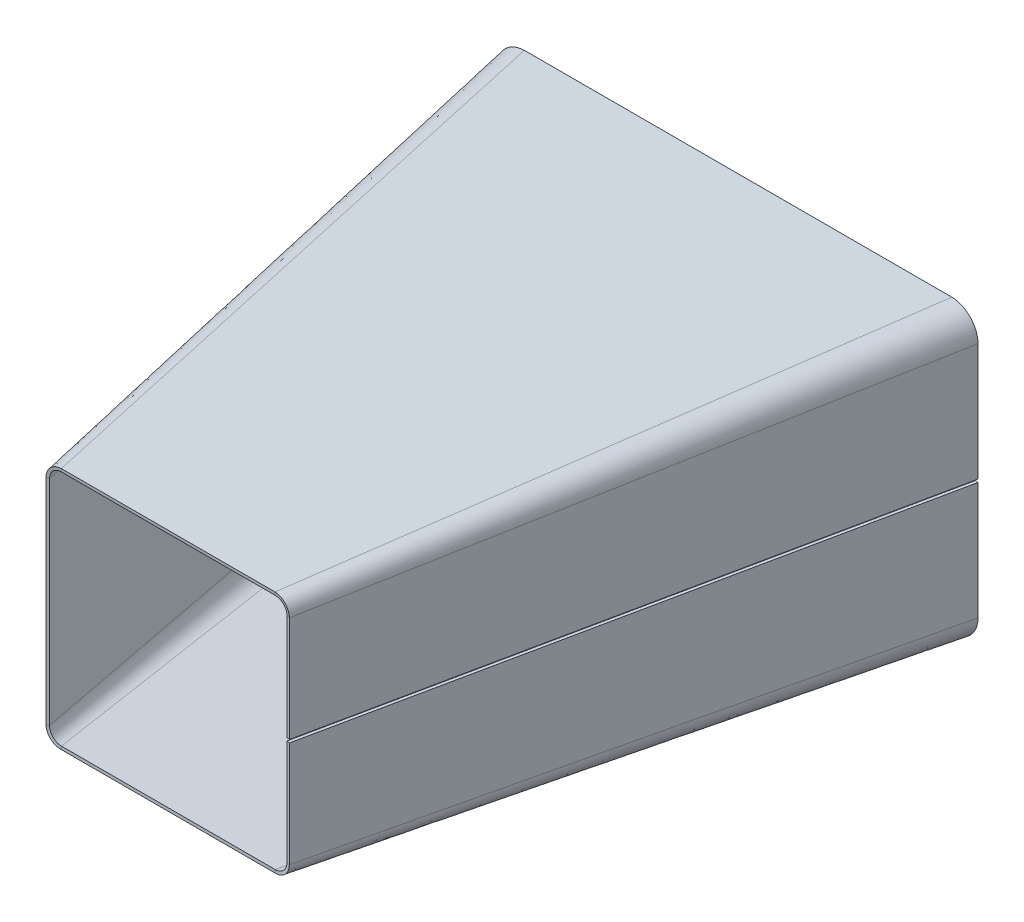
ISO-10303-21;
HEADER;
FILE_DESCRIPTION(('STEP AP214'),'2;1');
FILE_NAME('part.step','',(''),(''),'','','');
FILE_SCHEMA(('AUTOMOTIVE_DESIGN { 1 0 10303 214 1 1 1 1 }'));
ENDSEC;
DATA;
#1=APPLICATION_CONTEXT('core data for automotive mechanical design processes');
#2=APPLICATION_PROTOCOL_DEFINITION('international standard','automotive_design',2000,#1);
#3=PRODUCT_CONTEXT('',#1,'mechanical');
#4=PRODUCT('Part','Part','',(#3));
#5=PRODUCT_RELATED_PRODUCT_CATEGORY('part','',(#4));
#6=PRODUCT_DEFINITION_FORMATION('','',#4);
#7=PRODUCT_DEFINITION_CONTEXT('part definition',#1,'design');
#8=PRODUCT_DEFINITION('design','',#6,#7);
#9=PRODUCT_DEFINITION_SHAPE('','',#8);
#10=(LENGTH_UNIT() NAMED_UNIT(*) SI_UNIT(.MILLI.,.METRE.));
#11=(NAMED_UNIT(*) PLANE_ANGLE_UNIT() SI_UNIT($,.RADIAN.));
#12=(NAMED_UNIT(*) SI_UNIT($,.STERADIAN.) SOLID_ANGLE_UNIT());
#13=UNCERTAINTY_MEASURE_WITH_UNIT(LENGTH_MEASURE(1.E-05),#10,'distance_accuracy_value','');
#14=(GEOMETRIC_REPRESENTATION_CONTEXT(3) GLOBAL_UNCERTAINTY_ASSIGNED_CONTEXT((#13)) GLOBAL_UNIT_ASSIGNED_CONTEXT((#10,
#11,#12)) REPRESENTATION_CONTEXT('',''));
#15=CARTESIAN_POINT('',(0.,0.,0.));
#16=DIRECTION('',(0.,0.,1.));
#17=DIRECTION('',(1.,0.,0.));
#18=AXIS2_PLACEMENT_3D('',#15,#16,#17);
#19=CARTESIAN_POINT('',(127.,63.5,0.));
#20=DIRECTION('',(-0.203954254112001,0.,0.978980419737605));
#21=DIRECTION('',(0.,-1.,0.));
#22=AXIS2_PLACEMENT_3D('',#19,#20,#21);
#23=PLANE('',#22);
#24=DIRECTION('',(0.978980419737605,0.,0.203954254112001));
#25=VECTOR('',#24,1.);
#26=CARTESIAN_POINT('',(127.,0.793749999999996,0.));
#27=LINE('',#26,#25);
#28=CARTESIAN_POINT('',(127.,0.793749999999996,0.));
#29=VERTEX_POINT('',#28);
#30=CARTESIAN_POINT('',(128.554131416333,0.793749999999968,0.323777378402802));
#31=VERTEX_POINT('',#30);
#32=EDGE_CURVE('E14',#29,#31,#27,.T.);
#33=ORIENTED_EDGE('',*,*,#32,.F.);
#34=DIRECTION('',(0.,-1.,0.));
#35=VECTOR('',#34,1.);
#36=CARTESIAN_POINT('',(127.,63.5,0.));
#37=LINE('',#36,#35);
#38=CARTESIAN_POINT('',(127.,63.5,0.));
#39=VERTEX_POINT('',#38);
#40=EDGE_CURVE('E1724',#39,#29,#37,.T.);
#41=ORIENTED_EDGE('',*,*,#40,.F.);
#42=CARTESIAN_POINT('',(128.554131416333,63.5,0.323777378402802));
#43=CARTESIAN_POINT('',(127.,63.5,0.));
#44=B_SPLINE_CURVE_WITH_KNOTS('',1,(#42,#43),.UNSPECIFIED.,.F.,.F.,(2,2),(0.,1.),.UNSPECIFIED.);
#45=CARTESIAN_POINT('',(128.554131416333,63.5,0.323777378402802));
#46=VERTEX_POINT('',#45);
#47=EDGE_CURVE('E1612',#39,#46,#44,.F.);
#48=ORIENTED_EDGE('',*,*,#47,.T.);
#49=DIRECTION('',(0.,1.,0.));
#50=VECTOR('',#49,1.);
#51=CARTESIAN_POINT('',(128.554131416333,63.5,0.323777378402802));
#52=LINE('',#51,#50);
#53=EDGE_CURVE('E1697',#46,#31,#52,.F.);
#54=ORIENTED_EDGE('',*,*,#53,.T.);
#55=EDGE_LOOP('',(#33,#41,#48,#54));
#56=FACE_BOUND('',#55,.T.);
#57=ADVANCED_FACE('F1602',(#56),#23,.F.);
#58=CARTESIAN_POINT('',(128.554131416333,63.5,0.323777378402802));
#59=CARTESIAN_POINT('',(128.553748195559,64.3406472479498,0.325616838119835));
#60=CARTESIAN_POINT('',(128.479139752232,65.2104166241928,0.3260495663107));
#61=CARTESIAN_POINT('',(128.152784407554,66.9769591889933,0.323472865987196));
#62=CARTESIAN_POINT('',(127.901697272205,67.8687454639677,0.320537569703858));
#63=CARTESIAN_POINT('',(127.20808671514,69.6262362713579,0.310617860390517));
#64=CARTESIAN_POINT('',(126.76761954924,70.4860216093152,0.303928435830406));
#65=CARTESIAN_POINT('',(125.703217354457,72.1202207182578,0.286220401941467));
#66=CARTESIAN_POINT('',(125.082932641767,72.8885871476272,0.275753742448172));
#67=CARTESIAN_POINT('',(123.691563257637,74.2859087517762,0.250722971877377));
#68=CARTESIAN_POINT('',(122.925305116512,74.9097978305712,0.236909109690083));
#69=CARTESIAN_POINT('',(121.294226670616,75.981366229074,0.205988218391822));
#70=CARTESIAN_POINT('',(120.434469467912,76.4256917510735,0.189688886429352));
#71=CARTESIAN_POINT('',(118.676927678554,77.1255567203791,0.155039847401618));
#72=CARTESIAN_POINT('',(117.783405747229,77.3795082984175,0.137392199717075));
#73=CARTESIAN_POINT('',(116.014551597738,77.7095971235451,0.101441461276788));
#74=CARTESIAN_POINT('',(115.142270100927,77.7853907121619,0.083681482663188));
#75=CARTESIAN_POINT('',(114.3,77.7861237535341,0.0660884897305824));
#76=CARTESIAN_POINT('',(127.,63.5,0.));
#77=CARTESIAN_POINT('',(127.,64.2483546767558,0.));
#78=CARTESIAN_POINT('',(126.933472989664,65.0246951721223,0.));
#79=CARTESIAN_POINT('',(126.642483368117,66.5971663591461,0.));
#80=CARTESIAN_POINT('',(126.417765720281,67.3931371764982,0.));
#81=CARTESIAN_POINT('',(125.798857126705,68.9564684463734,0.));
#82=CARTESIAN_POINT('',(125.404520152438,69.7235120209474,0.));
#83=CARTESIAN_POINT('',(124.455165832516,71.1756157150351,0.));
#84=CARTESIAN_POINT('',(123.900213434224,71.8602988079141,0.));
#85=CARTESIAN_POINT('',(122.660298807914,73.1002134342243,0.));
#86=CARTESIAN_POINT('',(121.975615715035,73.6551658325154,0.));
#87=CARTESIAN_POINT('',(120.523512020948,74.6045201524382,0.));
#88=CARTESIAN_POINT('',(119.756468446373,74.998857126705,0.));
#89=CARTESIAN_POINT('',(118.193137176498,75.6177657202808,0.));
#90=CARTESIAN_POINT('',(117.397166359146,75.8424833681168,0.));
#91=CARTESIAN_POINT('',(115.824695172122,76.1334729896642,0.));
#92=CARTESIAN_POINT('',(115.048354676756,76.2,0.));
#93=CARTESIAN_POINT('',(114.3,76.2,0.));
#94=B_SPLINE_SURFACE_WITH_KNOTS('',1,3,((#58,#59,#60,#61,#62,#63,#64,#65,#66,#67,#68,#69,#70,
#71,#72,#73,#74,#75),(#76,#77,#78,#79,#80,#81,#82,#83,#84,#85,#86,#87,#88,#89,#90,#91,#92,#93)),
.UNSPECIFIED.,.F.,.F.,.F.,(2,2),(4,2,2,2,2,2,2,2,4),(0.,1.),(0.,0.125,0.25,0.375,0.5,0.625,0.75,
0.875,1.),.UNSPECIFIED.);
#95=CARTESIAN_POINT('',(127.,63.5,0.));
#96=CARTESIAN_POINT('',(127.,64.2483546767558,0.));
#97=CARTESIAN_POINT('',(126.933472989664,65.0246951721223,0.));
#98=CARTESIAN_POINT('',(126.642483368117,66.5971663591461,0.));
#99=CARTESIAN_POINT('',(126.417765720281,67.3931371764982,0.));
#100=CARTESIAN_POINT('',(125.798857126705,68.9564684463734,0.));
#101=CARTESIAN_POINT('',(125.404520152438,69.7235120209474,0.));
#102=CARTESIAN_POINT('',(124.455165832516,71.1756157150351,0.));
#103=CARTESIAN_POINT('',(123.900213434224,71.8602988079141,0.));
#104=CARTESIAN_POINT('',(122.660298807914,73.1002134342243,0.));
#105=CARTESIAN_POINT('',(121.975615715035,73.6551658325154,0.));
#106=CARTESIAN_POINT('',(120.523512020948,74.6045201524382,0.));
#107=CARTESIAN_POINT('',(119.756468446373,74.998857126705,0.));
#108=CARTESIAN_POINT('',(118.193137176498,75.6177657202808,0.));
#109=CARTESIAN_POINT('',(117.397166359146,75.8424833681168,0.));
#110=CARTESIAN_POINT('',(115.824695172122,76.1334729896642,0.));
#111=CARTESIAN_POINT('',(115.048354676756,76.2,0.));
#112=CARTESIAN_POINT('',(114.3,76.2,0.));
#113=B_SPLINE_CURVE_WITH_KNOTS('',3,(#95,#96,#97,#98,#99,#100,#101,#102,#103,#104,#105,#106,
#107,#108,#109,#110,#111,#112),.UNSPECIFIED.,.F.,.F.,(4,2,2,2,2,2,2,2,4),(0.,0.125,0.25,0.375,
0.5,0.625,0.75,0.875,1.),.UNSPECIFIED.);
#114=CARTESIAN_POINT('',(114.3,76.2,0.));
#115=VERTEX_POINT('',#114);
#116=EDGE_CURVE('E1719',#39,#115,#113,.T.);
#117=CARTESIAN_POINT('',(114.3,76.2,0.));
#118=CARTESIAN_POINT('',(114.3,77.7861237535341,0.0660884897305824));
#119=B_SPLINE_CURVE_WITH_KNOTS('',1,(#117,#118),.UNSPECIFIED.,.F.,.F.,(2,2),(0.,1.),.UNSPECIFIED.);
#120=CARTESIAN_POINT('',(114.3,77.7861237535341,0.0660884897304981));
#121=VERTEX_POINT('',#120);
#122=EDGE_CURVE('E2680',#115,#121,#119,.T.);
#123=CARTESIAN_POINT('',(128.554131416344,63.4999999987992,0.323777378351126));
#124=CARTESIAN_POINT('',(128.554030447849,63.7119559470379,0.324240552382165));
#125=CARTESIAN_POINT('',(128.549206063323,63.9239087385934,0.324609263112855));
#126=CARTESIAN_POINT('',(128.529992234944,64.3510191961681,0.325164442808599));
#127=CARTESIAN_POINT('',(128.515440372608,64.5661695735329,0.325347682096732));
#128=CARTESIAN_POINT('',(128.476335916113,64.9991536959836,0.325524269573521));
#129=CARTESIAN_POINT('',(128.451621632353,65.2169728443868,0.325514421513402));
#130=CARTESIAN_POINT('',(128.391746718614,65.6547551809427,0.325293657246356));
#131=CARTESIAN_POINT('',(128.356423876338,65.8746962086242,0.325079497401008));
#132=CARTESIAN_POINT('',(128.27488865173,66.3159899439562,0.324438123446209));
#133=CARTESIAN_POINT('',(128.228519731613,66.5373137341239,0.324007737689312));
#134=CARTESIAN_POINT('',(128.124686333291,66.9803973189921,0.32293358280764));
#135=CARTESIAN_POINT('',(128.067084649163,67.2021249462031,0.322287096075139));
#136=CARTESIAN_POINT('',(127.940557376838,67.6453353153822,0.320771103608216));
#137=CARTESIAN_POINT('',(127.871498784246,67.8667800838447,0.31989890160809));
#138=CARTESIAN_POINT('',(127.721814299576,68.3087214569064,0.317916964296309));
#139=CARTESIAN_POINT('',(127.641058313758,68.5291740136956,0.316804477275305));
#140=CARTESIAN_POINT('',(127.467808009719,68.9681327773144,0.314337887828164));
#141=CARTESIAN_POINT('',(127.3751978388,69.1865932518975,0.312981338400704));
#142=CARTESIAN_POINT('',(127.178422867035,69.6204521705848,0.310045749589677));
#143=CARTESIAN_POINT('',(127.07416779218,69.8358096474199,0.308464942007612));
#144=CARTESIAN_POINT('',(126.854177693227,70.2627256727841,0.305066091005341));
#145=CARTESIAN_POINT('',(126.738358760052,70.4742409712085,0.303246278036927));
#146=CARTESIAN_POINT('',(126.495294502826,70.8927104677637,0.299348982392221));
#147=CARTESIAN_POINT('',(126.367970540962,71.0996189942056,0.29726968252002));
#148=CARTESIAN_POINT('',(126.102129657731,71.5077543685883,0.292866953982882));
#149=CARTESIAN_POINT('',(125.963554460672,71.7089432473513,0.29054223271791));
#150=CARTESIAN_POINT('',(125.675830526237,72.1046012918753,0.285688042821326));
#151=CARTESIAN_POINT('',(125.52664911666,72.2990466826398,0.283157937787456));
#152=CARTESIAN_POINT('',(125.21811574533,72.6805779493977,0.277873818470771));
#153=CARTESIAN_POINT('',(125.058736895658,72.8676420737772,0.275119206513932));
#154=CARTESIAN_POINT('',(124.730186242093,73.2337443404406,0.269358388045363));
#155=CARTESIAN_POINT('',(124.560992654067,73.4127629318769,0.266351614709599));
#156=CARTESIAN_POINT('',(124.213482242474,73.7617540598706,0.260124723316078));
#157=CARTESIAN_POINT('',(124.035164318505,73.9317255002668,0.256904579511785));
#158=CARTESIAN_POINT('',(123.670368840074,74.2618864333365,0.250303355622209));
#159=CARTESIAN_POINT('',(123.483908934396,74.4220954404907,0.246922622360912));
#160=CARTESIAN_POINT('',(123.103489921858,74.7323354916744,0.239980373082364));
#161=CARTESIAN_POINT('',(122.909550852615,74.8823911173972,0.236419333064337));
#162=CARTESIAN_POINT('',(122.514807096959,75.1719029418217,0.229083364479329));
#163=CARTESIAN_POINT('',(122.314024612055,75.3113894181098,0.225309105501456));
#164=CARTESIAN_POINT('',(121.906591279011,75.5790624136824,0.217608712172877));
#165=CARTESIAN_POINT('',(121.699977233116,75.7073049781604,0.213683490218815));
#166=CARTESIAN_POINT('',(121.281983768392,75.9521900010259,0.205734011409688));
#167=CARTESIAN_POINT('',(121.070649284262,76.0689092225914,0.20171066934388));
#168=CARTESIAN_POINT('',(120.643987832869,76.2906739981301,0.193549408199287));
#169=CARTESIAN_POINT('',(120.428703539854,76.3958017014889,0.189412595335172));
#170=CARTESIAN_POINT('',(119.994889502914,76.5942883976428,0.180990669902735));
#171=CARTESIAN_POINT('',(119.776400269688,76.6877359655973,0.176707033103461));
#172=CARTESIAN_POINT('',(119.337286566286,76.862600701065,0.16806675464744));
#173=CARTESIAN_POINT('',(119.116707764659,76.944132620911,0.163711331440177));
#174=CARTESIAN_POINT('',(118.674427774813,77.0952926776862,0.154968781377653));
#175=CARTESIAN_POINT('',(118.452770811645,77.1650503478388,0.150582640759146));
#176=CARTESIAN_POINT('',(118.009061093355,77.2928941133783,0.141770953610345));
#177=CARTESIAN_POINT('',(117.787046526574,77.3511128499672,0.137346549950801));
#178=CARTESIAN_POINT('',(117.343324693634,77.4560949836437,0.128429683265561));
#179=CARTESIAN_POINT('',(117.121649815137,77.5029953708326,0.123938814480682));
#180=CARTESIAN_POINT('',(116.679603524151,77.5854949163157,0.114961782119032));
#181=CARTESIAN_POINT('',(116.459261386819,77.6212510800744,0.110476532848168));
#182=CARTESIAN_POINT('',(116.020641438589,77.6818910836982,0.101535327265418));
#183=CARTESIAN_POINT('',(115.802386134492,77.7069380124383,0.097080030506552));
#184=CARTESIAN_POINT('',(115.368506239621,77.7466073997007,0.0881952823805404));
#185=CARTESIAN_POINT('',(115.152896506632,77.7613925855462,0.0837665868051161));
#186=CARTESIAN_POINT('',(114.724854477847,77.7809743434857,0.0749306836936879));
#187=CARTESIAN_POINT('',(114.512429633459,77.785934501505,0.0705243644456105));
#188=CARTESIAN_POINT('',(114.3,77.7861237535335,0.0660884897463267));
#189=B_SPLINE_CURVE_WITH_KNOTS('',3,(#123,#124,#125,#126,#127,#128,#129,#130,#131,#132,#133,
#134,#135,#136,#137,#138,#139,#140,#141,#142,#143,#144,#145,#146,#147,#148,#149,#150,#151,#152,
#153,#154,#155,#156,#157,#158,#159,#160,#161,#162,#163,#164,#165,#166,#167,#168,#169,#170,#171,
#172,#173,#174,#175,#176,#177,#178,#179,#180,#181,#182,#183,#184,#185,#186,#187,#188),
.UNSPECIFIED.,.F.,.F.,(4,2,2,2,2,2,2,2,2,2,2,2,2,2,2,2,2,2,2,2,2,2,2,2,2,2,2,2,2,2,2,2,4),(0.,
0.635815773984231,1.28252203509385,1.93994237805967,2.60797664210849,3.28610908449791,
3.97311212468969,4.66873439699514,5.37279059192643,6.0843449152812,6.80185848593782,
7.52502028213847,8.25356511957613,8.98615909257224,9.72111672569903,10.4580991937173,
11.1967851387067,11.9355603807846,12.6728068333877,13.4081993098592,14.1413985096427,
14.8707062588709,15.594771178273,16.3133206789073,17.0260395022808,17.7313641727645,
18.4283362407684,19.1167611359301,19.7963810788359,20.4659412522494,21.1249064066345,
21.7731672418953,22.4105406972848),.UNSPECIFIED.);
#190=EDGE_CURVE('E2165',#46,#121,#189,.T.);
#191=ORIENTED_EDGE('',*,*,#47,.F.);
#192=ORIENTED_EDGE('',*,*,#116,.T.);
#193=ORIENTED_EDGE('',*,*,#122,.T.);
#194=ORIENTED_EDGE('',*,*,#190,.F.);
#195=EDGE_LOOP('',(#191,#192,#193,#194));
#196=FACE_BOUND('',#195,.T.);
#197=ADVANCED_FACE('F2648',(#196),#94,.T.);
#198=CARTESIAN_POINT('',(-114.3,76.2,0.));
#199=DIRECTION('',(0.,-0.0416305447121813,0.999133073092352));
#200=DIRECTION('',(1.,0.,0.));
#201=AXIS2_PLACEMENT_3D('',#198,#199,#200);
#202=PLANE('',#201);
#203=ORIENTED_EDGE('',*,*,#122,.F.);
#204=DIRECTION('',(1.,0.,0.));
#205=VECTOR('',#204,1.);
#206=CARTESIAN_POINT('',(-114.3,76.2,0.));
#207=LINE('',#206,#205);
#208=CARTESIAN_POINT('',(-114.3,76.2,0.));
#209=VERTEX_POINT('',#208);
#210=EDGE_CURVE('E2187',#209,#115,#207,.T.);
#211=ORIENTED_EDGE('',*,*,#210,.F.);
#212=CARTESIAN_POINT('',(-114.3,77.7861237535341,0.0660884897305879));
#213=CARTESIAN_POINT('',(-114.3,76.2,0.));
#214=B_SPLINE_CURVE_WITH_KNOTS('',1,(#212,#213),.UNSPECIFIED.,.F.,.F.,(2,2),(0.,1.),.UNSPECIFIED.);
#215=CARTESIAN_POINT('',(-114.3,77.7861237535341,0.0660884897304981));
#216=VERTEX_POINT('',#215);
#217=EDGE_CURVE('E2681',#209,#216,#214,.F.);
#218=ORIENTED_EDGE('',*,*,#217,.T.);
#219=DIRECTION('',(1.,0.,0.));
#220=VECTOR('',#219,1.);
#221=CARTESIAN_POINT('',(-57.15,77.7861237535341,0.0660884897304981));
#222=LINE('',#221,#220);
#223=EDGE_CURVE('E2159',#216,#121,#222,.T.);
#224=ORIENTED_EDGE('',*,*,#223,.T.);
#225=EDGE_LOOP('',(#203,#211,#218,#224));
#226=FACE_BOUND('',#225,.T.);
#227=ADVANCED_FACE('F2652',(#226),#202,.F.);
#228=CARTESIAN_POINT('',(-114.3,77.7861237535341,0.0660884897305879));
#229=CARTESIAN_POINT('',(-115.142543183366,77.7853904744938,0.0836871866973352));
#230=CARTESIAN_POINT('',(-116.014189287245,77.7096692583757,0.101375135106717));
#231=CARTESIAN_POINT('',(-117.783768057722,77.3794361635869,0.137458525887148));
#232=CARTESIAN_POINT('',(-118.676636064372,77.1256782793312,0.154987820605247));
#233=CARTESIAN_POINT('',(-120.434761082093,76.4255701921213,0.189740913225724));
#234=CARTESIAN_POINT('',(-121.294075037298,75.9814697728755,0.205962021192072));
#235=CARTESIAN_POINT('',(-122.925456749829,74.9096942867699,0.236935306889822));
#236=CARTESIAN_POINT('',(-123.691563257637,74.2859087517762,0.250722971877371));
#237=CARTESIAN_POINT('',(-125.082932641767,72.8885871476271,0.275753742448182));
#238=CARTESIAN_POINT('',(-125.70331466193,72.1200667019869,0.286235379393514));
#239=CARTESIAN_POINT('',(-126.767522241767,70.486175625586,0.303913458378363));
#240=CARTESIAN_POINT('',(-127.208198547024,69.6259456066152,0.310632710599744));
#241=CARTESIAN_POINT('',(-127.90158544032,67.8690361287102,0.320522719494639));
#242=CARTESIAN_POINT('',(-128.152849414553,66.9766024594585,0.323477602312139));
#243=CARTESIAN_POINT('',(-128.479074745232,65.2107733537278,0.326044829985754));
#244=CARTESIAN_POINT('',(-128.553748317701,64.340379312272,0.325616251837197));
#245=CARTESIAN_POINT('',(-128.554131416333,63.5,0.323777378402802));
#246=CARTESIAN_POINT('',(-114.3,76.2,0.));
#247=CARTESIAN_POINT('',(-115.048354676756,76.2,0.));
#248=CARTESIAN_POINT('',(-115.824695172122,76.1334729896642,0.));
#249=CARTESIAN_POINT('',(-117.397166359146,75.8424833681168,0.));
#250=CARTESIAN_POINT('',(-118.193137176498,75.6177657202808,0.));
#251=CARTESIAN_POINT('',(-119.756468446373,74.998857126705,0.));
#252=CARTESIAN_POINT('',(-120.523512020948,74.6045201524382,0.));
#253=CARTESIAN_POINT('',(-121.975615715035,73.6551658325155,0.));
#254=CARTESIAN_POINT('',(-122.660298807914,73.1002134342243,0.));
#255=CARTESIAN_POINT('',(-123.900213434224,71.860298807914,0.));
#256=CARTESIAN_POINT('',(-124.455165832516,71.1756157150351,0.));
#257=CARTESIAN_POINT('',(-125.404520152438,69.7235120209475,0.));
#258=CARTESIAN_POINT('',(-125.798857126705,68.9564684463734,0.));
#259=CARTESIAN_POINT('',(-126.417765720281,67.3931371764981,0.));
#260=CARTESIAN_POINT('',(-126.642483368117,66.5971663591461,0.));
#261=CARTESIAN_POINT('',(-126.933472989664,65.0246951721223,0.));
#262=CARTESIAN_POINT('',(-127.,64.2483546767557,0.));
#263=CARTESIAN_POINT('',(-127.,63.5,0.));
#264=B_SPLINE_SURFACE_WITH_KNOTS('',1,3,((#228,#229,#230,#231,#232,#233,#234,#235,#236,#237,
#238,#239,#240,#241,#242,#243,#244,#245),(#246,#247,#248,#249,#250,#251,#252,#253,#254,#255,
#256,#257,#258,#259,#260,#261,#262,#263)),.UNSPECIFIED.,.F.,.F.,.F.,(2,2),(4,2,2,2,2,2,2,2,4),
(0.,1.),(0.,0.125,0.25,0.375,0.5,0.625,0.75,0.875,1.),.UNSPECIFIED.);
#265=CARTESIAN_POINT('',(-114.3,76.2,0.));
#266=CARTESIAN_POINT('',(-115.048354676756,76.2,0.));
#267=CARTESIAN_POINT('',(-115.824695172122,76.1334729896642,0.));
#268=CARTESIAN_POINT('',(-117.397166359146,75.8424833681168,0.));
#269=CARTESIAN_POINT('',(-118.193137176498,75.6177657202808,0.));
#270=CARTESIAN_POINT('',(-119.756468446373,74.998857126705,0.));
#271=CARTESIAN_POINT('',(-120.523512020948,74.6045201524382,0.));
#272=CARTESIAN_POINT('',(-121.975615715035,73.6551658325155,0.));
#273=CARTESIAN_POINT('',(-122.660298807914,73.1002134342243,0.));
#274=CARTESIAN_POINT('',(-123.900213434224,71.860298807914,0.));
#275=CARTESIAN_POINT('',(-124.455165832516,71.1756157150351,0.));
#276=CARTESIAN_POINT('',(-125.404520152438,69.7235120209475,0.));
#277=CARTESIAN_POINT('',(-125.798857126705,68.9564684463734,0.));
#278=CARTESIAN_POINT('',(-126.417765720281,67.3931371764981,0.));
#279=CARTESIAN_POINT('',(-126.642483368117,66.5971663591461,0.));
#280=CARTESIAN_POINT('',(-126.933472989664,65.0246951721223,0.));
#281=CARTESIAN_POINT('',(-127.,64.2483546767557,0.));
#282=CARTESIAN_POINT('',(-127.,63.5,0.));
#283=B_SPLINE_CURVE_WITH_KNOTS('',3,(#265,#266,#267,#268,#269,#270,#271,#272,#273,#274,#275,
#276,#277,#278,#279,#280,#281,#282),.UNSPECIFIED.,.F.,.F.,(4,2,2,2,2,2,2,2,4),(0.,0.125,0.25,
0.375,0.5,0.625,0.75,0.875,1.),.UNSPECIFIED.);
#284=CARTESIAN_POINT('',(-127.,63.5,0.));
#285=VERTEX_POINT('',#284);
#286=EDGE_CURVE('E2207',#209,#285,#283,.T.);
#287=CARTESIAN_POINT('',(-127.,63.5,0.));
#288=CARTESIAN_POINT('',(-128.554131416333,63.5,0.323777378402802));
#289=B_SPLINE_CURVE_WITH_KNOTS('',1,(#287,#288),.UNSPECIFIED.,.F.,.F.,(2,2),(0.,1.),.UNSPECIFIED.);
#290=CARTESIAN_POINT('',(-128.554131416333,63.5000000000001,0.323777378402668));
#291=VERTEX_POINT('',#290);
#292=EDGE_CURVE('E2576',#285,#291,#289,.T.);
#293=CARTESIAN_POINT('',(-114.300000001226,77.7861237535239,0.0660884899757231));
#294=CARTESIAN_POINT('',(-114.512429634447,77.7859345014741,0.0705243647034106));
#295=CARTESIAN_POINT('',(-114.724854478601,77.7809743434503,0.0749306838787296));
#296=CARTESIAN_POINT('',(-115.1528965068,77.7613925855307,0.0837665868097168));
#297=CARTESIAN_POINT('',(-115.368506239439,77.7466073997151,0.0881952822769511));
#298=CARTESIAN_POINT('',(-115.802386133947,77.7069380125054,0.0970800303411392));
#299=CARTESIAN_POINT('',(-116.02064143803,77.6818910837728,0.101535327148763));
#300=CARTESIAN_POINT('',(-116.459261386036,77.6212510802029,0.110476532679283));
#301=CARTESIAN_POINT('',(-116.679603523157,77.5854949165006,0.114961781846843));
#302=CARTESIAN_POINT('',(-117.121649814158,77.5029953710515,0.123938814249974));
#303=CARTESIAN_POINT('',(-117.343324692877,77.4560949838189,0.12842968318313));
#304=CARTESIAN_POINT('',(-117.78704652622,77.351112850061,0.137346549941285));
#305=CARTESIAN_POINT('',(-118.009061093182,77.2928941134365,0.141770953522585));
#306=CARTESIAN_POINT('',(-118.452770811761,77.1650503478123,0.150582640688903));
#307=CARTESIAN_POINT('',(-118.674427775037,77.0952926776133,0.154968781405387));
#308=CARTESIAN_POINT('',(-119.11670776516,76.9441326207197,0.163711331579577));
#309=CARTESIAN_POINT('',(-119.337286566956,76.8626007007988,0.16806675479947));
#310=CARTESIAN_POINT('',(-119.776400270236,76.6877359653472,0.17670703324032));
#311=CARTESIAN_POINT('',(-119.994889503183,76.5942883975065,0.180990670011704));
#312=CARTESIAN_POINT('',(-120.428703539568,76.395801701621,0.189412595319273));
#313=CARTESIAN_POINT('',(-120.643987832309,76.2906739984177,0.193549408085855));
#314=CARTESIAN_POINT('',(-121.070649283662,76.0689092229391,0.201710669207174));
#315=CARTESIAN_POINT('',(-121.281983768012,75.9521900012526,0.205734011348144));
#316=CARTESIAN_POINT('',(-121.699977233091,75.7073049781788,0.213683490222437));
#317=CARTESIAN_POINT('',(-121.906591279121,75.5790624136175,0.217608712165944));
#318=CARTESIAN_POINT('',(-122.314024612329,75.3113894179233,0.225309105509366));
#319=CARTESIAN_POINT('',(-122.514807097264,75.1719029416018,0.229083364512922));
#320=CARTESIAN_POINT('',(-122.909550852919,74.8823911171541,0.236419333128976));
#321=CARTESIAN_POINT('',(-123.103489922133,74.7323354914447,0.239980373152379));
#322=CARTESIAN_POINT('',(-123.483908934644,74.422095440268,0.246922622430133));
#323=CARTESIAN_POINT('',(-123.670368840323,74.2618864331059,0.2503033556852));
#324=CARTESIAN_POINT('',(-124.03516431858,73.9317255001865,0.25690457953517));
#325=CARTESIAN_POINT('',(-124.21348224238,73.7617540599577,0.260124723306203));
#326=CARTESIAN_POINT('',(-124.560992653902,73.4127629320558,0.266351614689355));
#327=CARTESIAN_POINT('',(-124.730186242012,73.2337443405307,0.269358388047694));
#328=CARTESIAN_POINT('',(-125.058736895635,72.8676420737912,0.275119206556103));
#329=CARTESIAN_POINT('',(-125.218115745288,72.6805779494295,0.277873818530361));
#330=CARTESIAN_POINT('',(-125.526649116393,72.2990466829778,0.28315793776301));
#331=CARTESIAN_POINT('',(-125.675830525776,72.1046012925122,0.285688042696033));
#332=CARTESIAN_POINT('',(-125.963554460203,71.7089432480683,0.290542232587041));
#333=CARTESIAN_POINT('',(-126.10212965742,71.5077543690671,0.292866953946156));
#334=CARTESIAN_POINT('',(-126.367970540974,71.0996189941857,0.297269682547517));
#335=CARTESIAN_POINT('',(-126.495294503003,70.8927104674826,0.299348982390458));
#336=CARTESIAN_POINT('',(-126.738358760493,70.4742409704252,0.303246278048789));
#337=CARTESIAN_POINT('',(-126.854177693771,70.2627256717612,0.3050660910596));
#338=CARTESIAN_POINT('',(-127.074167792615,69.8358096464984,0.308464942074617));
#339=CARTESIAN_POINT('',(-127.178422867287,69.6204521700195,0.310045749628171));
#340=CARTESIAN_POINT('',(-127.375197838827,69.1865932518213,0.312981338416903));
#341=CARTESIAN_POINT('',(-127.46780800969,68.9681327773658,0.314337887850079));
#342=CARTESIAN_POINT('',(-127.641058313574,68.5291740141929,0.316804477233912));
#343=CARTESIAN_POINT('',(-127.721814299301,68.3087214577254,0.317916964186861));
#344=CARTESIAN_POINT('',(-127.871498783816,67.8667800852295,0.319898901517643));
#345=CARTESIAN_POINT('',(-127.940557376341,67.64533531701,0.320771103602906));
#346=CARTESIAN_POINT('',(-128.067084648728,67.202124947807,0.322287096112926));
#347=CARTESIAN_POINT('',(-128.124686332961,66.9803973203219,0.322933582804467));
#348=CARTESIAN_POINT('',(-128.228519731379,66.5373137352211,0.324007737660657));
#349=CARTESIAN_POINT('',(-128.274888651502,66.3159899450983,0.324438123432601));
#350=CARTESIAN_POINT('',(-128.356423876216,65.8746962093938,0.325079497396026));
#351=CARTESIAN_POINT('',(-128.39174671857,65.6547551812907,0.325293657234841));
#352=CARTESIAN_POINT('',(-128.451621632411,65.2169728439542,0.325514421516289));
#353=CARTESIAN_POINT('',(-128.476335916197,64.9991536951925,0.325524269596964));
#354=CARTESIAN_POINT('',(-128.515440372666,64.5661695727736,0.325347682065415));
#355=CARTESIAN_POINT('',(-128.529992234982,64.3510191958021,0.325164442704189));
#356=CARTESIAN_POINT('',(-128.549206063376,63.9239087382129,0.324609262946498));
#357=CARTESIAN_POINT('',(-128.554030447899,63.7119559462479,0.324240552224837));
#358=CARTESIAN_POINT('',(-128.554131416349,63.4999999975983,0.323777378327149));
#359=B_SPLINE_CURVE_WITH_KNOTS('',3,(#293,#294,#295,#296,#297,#298,#299,#300,#301,#302,#303,
#304,#305,#306,#307,#308,#309,#310,#311,#312,#313,#314,#315,#316,#317,#318,#319,#320,#321,#322,
#323,#324,#325,#326,#327,#328,#329,#330,#331,#332,#333,#334,#335,#336,#337,#338,#339,#340,#341,
#342,#343,#344,#345,#346,#347,#348,#349,#350,#351,#352,#353,#354,#355,#356,#357,#358),
.UNSPECIFIED.,.F.,.F.,(4,2,2,2,2,2,2,2,2,2,2,2,2,2,2,2,2,2,2,2,2,2,2,2,2,2,2,2,2,2,2,2,4),(0.,
0.637373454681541,1.28563428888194,1.94459944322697,2.61415961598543,3.29377955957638,
3.98220445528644,4.67917652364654,5.38450119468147,6.09722001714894,6.81576951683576,
7.53983443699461,8.26914218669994,9.00234138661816,9.73773386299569,10.4749803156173,
11.2137555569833,11.952441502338,12.6894239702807,13.4243816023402,14.1569755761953,
14.885520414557,15.6086822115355,16.3261957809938,17.0377501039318,17.7418062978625,
18.4374285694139,19.1244316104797,19.8025640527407,20.4705983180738,21.1280186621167,
21.7747249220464,22.410540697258),.UNSPECIFIED.);
#360=EDGE_CURVE('E2551',#216,#291,#359,.T.);
#361=ORIENTED_EDGE('',*,*,#217,.F.);
#362=ORIENTED_EDGE('',*,*,#286,.T.);
#363=ORIENTED_EDGE('',*,*,#292,.T.);
#364=ORIENTED_EDGE('',*,*,#360,.F.);
#365=EDGE_LOOP('',(#361,#362,#363,#364));
#366=FACE_BOUND('',#365,.T.);
#367=ADVANCED_FACE('F2714',(#366),#264,.T.);
#368=CARTESIAN_POINT('',(-127.,63.5,0.));
#369=DIRECTION('',(0.203954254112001,0.,0.978980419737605));
#370=DIRECTION('',(0.,1.,0.));
#371=AXIS2_PLACEMENT_3D('',#368,#369,#370);
#372=PLANE('',#371);
#373=ORIENTED_EDGE('',*,*,#292,.F.);
#374=DIRECTION('',(0.,1.,0.));
#375=VECTOR('',#374,1.);
#376=CARTESIAN_POINT('',(-127.,63.5,0.));
#377=LINE('',#376,#375);
#378=CARTESIAN_POINT('',(-127.,-63.5,0.));
#379=VERTEX_POINT('',#378);
#380=EDGE_CURVE('E2572',#379,#285,#377,.T.);
#381=ORIENTED_EDGE('',*,*,#380,.F.);
#382=CARTESIAN_POINT('',(-128.554131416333,-63.5,0.323777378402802));
#383=CARTESIAN_POINT('',(-127.,-63.5,0.));
#384=B_SPLINE_CURVE_WITH_KNOTS('',1,(#382,#383),.UNSPECIFIED.,.F.,.F.,(2,2),(0.,1.),.UNSPECIFIED.);
#385=CARTESIAN_POINT('',(-128.554131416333,-63.5,0.323777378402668));
#386=VERTEX_POINT('',#385);
#387=EDGE_CURVE('E2573',#379,#386,#384,.F.);
#388=ORIENTED_EDGE('',*,*,#387,.T.);
#389=DIRECTION('',(0.,1.,0.));
#390=VECTOR('',#389,1.);
#391=CARTESIAN_POINT('',(-128.554131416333,-57.15,0.323777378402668));
#392=LINE('',#391,#390);
#393=EDGE_CURVE('E2548',#386,#291,#392,.T.);
#394=ORIENTED_EDGE('',*,*,#393,.T.);
#395=EDGE_LOOP('',(#373,#381,#388,#394));
#396=FACE_BOUND('',#395,.T.);
#397=ADVANCED_FACE('F2476',(#396),#372,.F.);
#398=CARTESIAN_POINT('',(-128.554131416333,-63.5,0.323777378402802));
#399=CARTESIAN_POINT('',(-128.553748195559,-64.3406472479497,0.325616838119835));
#400=CARTESIAN_POINT('',(-128.479139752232,-65.2104166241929,0.3260495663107));
#401=CARTESIAN_POINT('',(-128.152784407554,-66.9769591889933,0.323472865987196));
#402=CARTESIAN_POINT('',(-127.901697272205,-67.8687454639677,0.320537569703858));
#403=CARTESIAN_POINT('',(-127.20808671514,-69.6262362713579,0.310617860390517));
#404=CARTESIAN_POINT('',(-126.76761954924,-70.4860216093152,0.303928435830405));
#405=CARTESIAN_POINT('',(-125.703217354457,-72.1202207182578,0.286220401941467));
#406=CARTESIAN_POINT('',(-125.082932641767,-72.8885871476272,0.275753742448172));
#407=CARTESIAN_POINT('',(-123.691563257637,-74.2859087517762,0.250722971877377));
#408=CARTESIAN_POINT('',(-122.925305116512,-74.9097978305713,0.236909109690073));
#409=CARTESIAN_POINT('',(-121.294226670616,-75.981366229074,0.205988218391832));
#410=CARTESIAN_POINT('',(-120.434469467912,-76.4256917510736,0.189688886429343));
#411=CARTESIAN_POINT('',(-118.676927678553,-77.1255567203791,0.155039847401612));
#412=CARTESIAN_POINT('',(-117.783405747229,-77.3795082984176,0.137392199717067));
#413=CARTESIAN_POINT('',(-116.014551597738,-77.7095971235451,0.101441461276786));
#414=CARTESIAN_POINT('',(-115.142270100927,-77.785390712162,0.0836814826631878));
#415=CARTESIAN_POINT('',(-114.3,-77.7861237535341,0.0660884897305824));
#416=CARTESIAN_POINT('',(-127.,-63.5,0.));
#417=CARTESIAN_POINT('',(-127.,-64.2483546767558,0.));
#418=CARTESIAN_POINT('',(-126.933472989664,-65.0246951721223,0.));
#419=CARTESIAN_POINT('',(-126.642483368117,-66.5971663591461,0.));
#420=CARTESIAN_POINT('',(-126.417765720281,-67.3931371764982,0.));
#421=CARTESIAN_POINT('',(-125.798857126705,-68.9564684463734,0.));
#422=CARTESIAN_POINT('',(-125.404520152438,-69.7235120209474,0.));
#423=CARTESIAN_POINT('',(-124.455165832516,-71.1756157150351,0.));
#424=CARTESIAN_POINT('',(-123.900213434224,-71.8602988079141,0.));
#425=CARTESIAN_POINT('',(-122.660298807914,-73.1002134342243,0.));
#426=CARTESIAN_POINT('',(-121.975615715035,-73.6551658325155,0.));
#427=CARTESIAN_POINT('',(-120.523512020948,-74.6045201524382,0.));
#428=CARTESIAN_POINT('',(-119.756468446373,-74.9988571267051,0.));
#429=CARTESIAN_POINT('',(-118.193137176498,-75.6177657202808,0.));
#430=CARTESIAN_POINT('',(-117.397166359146,-75.8424833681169,0.));
#431=CARTESIAN_POINT('',(-115.824695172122,-76.1334729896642,0.));
#432=CARTESIAN_POINT('',(-115.048354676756,-76.2,0.));
#433=CARTESIAN_POINT('',(-114.3,-76.2,0.));
#434=B_SPLINE_SURFACE_WITH_KNOTS('',1,3,((#398,#399,#400,#401,#402,#403,#404,#405,#406,#407,
#408,#409,#410,#411,#412,#413,#414,#415),(#416,#417,#418,#419,#420,#421,#422,#423,#424,#425,
#426,#427,#428,#429,#430,#431,#432,#433)),.UNSPECIFIED.,.F.,.F.,.F.,(2,2),(4,2,2,2,2,2,2,2,4),
(0.,1.),(0.,0.125,0.25,0.375,0.5,0.625,0.75,0.875,1.),.UNSPECIFIED.);
#435=CARTESIAN_POINT('',(-127.,-63.5,0.));
#436=CARTESIAN_POINT('',(-127.,-64.2483546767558,0.));
#437=CARTESIAN_POINT('',(-126.933472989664,-65.0246951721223,0.));
#438=CARTESIAN_POINT('',(-126.642483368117,-66.5971663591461,0.));
#439=CARTESIAN_POINT('',(-126.417765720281,-67.3931371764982,0.));
#440=CARTESIAN_POINT('',(-125.798857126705,-68.9564684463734,0.));
#441=CARTESIAN_POINT('',(-125.404520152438,-69.7235120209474,0.));
#442=CARTESIAN_POINT('',(-124.455165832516,-71.1756157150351,0.));
#443=CARTESIAN_POINT('',(-123.900213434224,-71.8602988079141,0.));
#444=CARTESIAN_POINT('',(-122.660298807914,-73.1002134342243,0.));
#445=CARTESIAN_POINT('',(-121.975615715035,-73.6551658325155,0.));
#446=CARTESIAN_POINT('',(-120.523512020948,-74.6045201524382,0.));
#447=CARTESIAN_POINT('',(-119.756468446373,-74.9988571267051,0.));
#448=CARTESIAN_POINT('',(-118.193137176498,-75.6177657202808,0.));
#449=CARTESIAN_POINT('',(-117.397166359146,-75.8424833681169,0.));
#450=CARTESIAN_POINT('',(-115.824695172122,-76.1334729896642,0.));
#451=CARTESIAN_POINT('',(-115.048354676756,-76.2,0.));
#452=CARTESIAN_POINT('',(-114.3,-76.2,0.));
#453=B_SPLINE_CURVE_WITH_KNOTS('',3,(#435,#436,#437,#438,#439,#440,#441,#442,#443,#444,#445,
#446,#447,#448,#449,#450,#451,#452),.UNSPECIFIED.,.F.,.F.,(4,2,2,2,2,2,2,2,4),(0.,0.125,0.25,
0.375,0.5,0.625,0.75,0.875,1.),.UNSPECIFIED.);
#454=CARTESIAN_POINT('',(-114.3,-76.2,0.));
#455=VERTEX_POINT('',#454);
#456=EDGE_CURVE('E1846',#379,#455,#453,.T.);
#457=CARTESIAN_POINT('',(-114.3,-76.2,0.));
#458=CARTESIAN_POINT('',(-114.3,-77.7861237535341,0.0660884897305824));
#459=B_SPLINE_CURVE_WITH_KNOTS('',1,(#457,#458),.UNSPECIFIED.,.F.,.F.,(2,2),(0.,1.),.UNSPECIFIED.);
#460=CARTESIAN_POINT('',(-114.3,-77.7861237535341,0.0660884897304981));
#461=VERTEX_POINT('',#460);
#462=EDGE_CURVE('E2460',#455,#461,#459,.T.);
#463=CARTESIAN_POINT('',(-128.554131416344,-63.4999999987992,0.323777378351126));
#464=CARTESIAN_POINT('',(-128.554030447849,-63.7119559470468,0.324240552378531));
#465=CARTESIAN_POINT('',(-128.549206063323,-63.923908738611,0.324609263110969));
#466=CARTESIAN_POINT('',(-128.529992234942,-64.3510191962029,0.325164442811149));
#467=CARTESIAN_POINT('',(-128.515440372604,-64.5661695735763,0.325347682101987));
#468=CARTESIAN_POINT('',(-128.476335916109,-64.9991536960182,0.325524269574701));
#469=CARTESIAN_POINT('',(-128.451621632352,-65.2169728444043,0.325514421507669));
#470=CARTESIAN_POINT('',(-128.391746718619,-65.6547551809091,0.325293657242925));
#471=CARTESIAN_POINT('',(-128.356423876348,-65.8746962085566,0.325079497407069));
#472=CARTESIAN_POINT('',(-128.274888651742,-66.3159899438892,0.324438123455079));
#473=CARTESIAN_POINT('',(-128.22851973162,-66.5373137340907,0.324007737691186));
#474=CARTESIAN_POINT('',(-128.124686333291,-66.9803973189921,0.322933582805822));
#475=CARTESIAN_POINT('',(-128.067084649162,-67.202124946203,0.322287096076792));
#476=CARTESIAN_POINT('',(-127.940557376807,-67.6453353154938,0.320771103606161));
#477=CARTESIAN_POINT('',(-127.871498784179,-67.8667800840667,0.31989890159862));
#478=CARTESIAN_POINT('',(-127.721814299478,-68.3087214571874,0.317916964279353));
#479=CARTESIAN_POINT('',(-127.641058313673,-68.5291740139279,0.316804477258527));
#480=CARTESIAN_POINT('',(-127.467808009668,-68.9681327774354,0.314337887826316));
#481=CARTESIAN_POINT('',(-127.375197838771,-69.1865932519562,0.312981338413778));
#482=CARTESIAN_POINT('',(-127.178422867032,-69.6204521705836,0.310045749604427));
#483=CARTESIAN_POINT('',(-127.07416779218,-69.8358096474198,0.308464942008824));
#484=CARTESIAN_POINT('',(-126.854177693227,-70.2627256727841,0.30506609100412));
#485=CARTESIAN_POINT('',(-126.738358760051,-70.4742409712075,0.303246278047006));
#486=CARTESIAN_POINT('',(-126.495294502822,-70.8927104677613,0.299348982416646));
#487=CARTESIAN_POINT('',(-126.367970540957,-71.0996189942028,0.297269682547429));
#488=CARTESIAN_POINT('',(-126.102129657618,-71.5077543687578,0.292866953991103));
#489=CARTESIAN_POINT('',(-125.963554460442,-71.7089432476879,0.290542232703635));
#490=CARTESIAN_POINT('',(-125.675830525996,-72.1046012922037,0.285688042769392));
#491=CARTESIAN_POINT('',(-125.526649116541,-72.2990466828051,0.2831579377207));
#492=CARTESIAN_POINT('',(-125.218115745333,-72.6805779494,0.277873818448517));
#493=CARTESIAN_POINT('',(-125.058736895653,-72.867642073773,0.275119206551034));
#494=CARTESIAN_POINT('',(-124.730186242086,-73.2337443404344,0.269358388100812));
#495=CARTESIAN_POINT('',(-124.560992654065,-73.4127629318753,0.266351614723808));
#496=CARTESIAN_POINT('',(-124.213482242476,-73.7617540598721,0.260124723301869));
#497=CARTESIAN_POINT('',(-124.035164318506,-73.9317255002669,0.256904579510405));
#498=CARTESIAN_POINT('',(-123.670368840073,-74.2618864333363,0.250303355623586));
#499=CARTESIAN_POINT('',(-123.483908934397,-74.4220954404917,0.246922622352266));
#500=CARTESIAN_POINT('',(-123.103489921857,-74.7323354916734,0.239980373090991));
#501=CARTESIAN_POINT('',(-122.909550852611,-74.8823911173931,0.236419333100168));
#502=CARTESIAN_POINT('',(-122.514807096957,-75.1719029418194,0.22908336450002));
#503=CARTESIAN_POINT('',(-122.314024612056,-75.3113894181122,0.22530910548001));
#504=CARTESIAN_POINT('',(-121.906591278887,-75.5790624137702,0.217608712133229));
#505=CARTESIAN_POINT('',(-121.699977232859,-75.7073049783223,0.213683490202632));
#506=CARTESIAN_POINT('',(-121.281983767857,-75.9521900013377,0.205734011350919));
#507=CARTESIAN_POINT('',(-121.070649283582,-76.0689092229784,0.201710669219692));
#508=CARTESIAN_POINT('',(-120.643987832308,-76.2906739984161,0.19354940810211));
#509=CARTESIAN_POINT('',(-120.428703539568,-76.3958017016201,0.189412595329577));
#510=CARTESIAN_POINT('',(-119.994889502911,-76.5942883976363,0.180990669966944));
#511=CARTESIAN_POINT('',(-119.776400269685,-76.6877359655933,0.176707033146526));
#512=CARTESIAN_POINT('',(-119.337286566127,-76.8626007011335,0.168066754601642));
#513=CARTESIAN_POINT('',(-119.116707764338,-76.9441326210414,0.163711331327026));
#514=CARTESIAN_POINT('',(-118.674427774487,-77.0952926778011,0.154968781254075));
#515=CARTESIAN_POINT('',(-118.452770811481,-77.1650503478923,0.150582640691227));
#516=CARTESIAN_POINT('',(-118.009061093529,-77.2928941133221,0.14177095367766));
#517=CARTESIAN_POINT('',(-117.787046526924,-77.3511128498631,0.137346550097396));
#518=CARTESIAN_POINT('',(-117.34332469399,-77.4560949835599,0.128429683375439));
#519=CARTESIAN_POINT('',(-117.121649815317,-77.5029953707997,0.123938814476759));
#520=CARTESIAN_POINT('',(-116.679603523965,-77.5854949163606,0.114961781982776));
#521=CARTESIAN_POINT('',(-116.459261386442,-77.621251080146,0.110476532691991));
#522=CARTESIAN_POINT('',(-116.020641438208,-77.681891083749,0.10153532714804));
#523=CARTESIAN_POINT('',(-115.802386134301,-77.7069380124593,0.0970800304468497));
#524=CARTESIAN_POINT('',(-115.368506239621,-77.7466073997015,0.0881952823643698));
#525=CARTESIAN_POINT('',(-115.152896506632,-77.7613925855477,0.0837665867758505));
#526=CARTESIAN_POINT('',(-114.724854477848,-77.7809743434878,0.0749306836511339));
#527=CARTESIAN_POINT('',(-114.512429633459,-77.7859345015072,0.0705243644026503));
#528=CARTESIAN_POINT('',(-114.3,-77.7861237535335,0.0660884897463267));
#529=B_SPLINE_CURVE_WITH_KNOTS('',3,(#463,#464,#465,#466,#467,#468,#469,#470,#471,#472,#473,
#474,#475,#476,#477,#478,#479,#480,#481,#482,#483,#484,#485,#486,#487,#488,#489,#490,#491,#492,
#493,#494,#495,#496,#497,#498,#499,#500,#501,#502,#503,#504,#505,#506,#507,#508,#509,#510,#511,
#512,#513,#514,#515,#516,#517,#518,#519,#520,#521,#522,#523,#524,#525,#526,#527,#528),
.UNSPECIFIED.,.F.,.F.,(4,2,2,2,2,2,2,2,2,2,2,2,2,2,2,2,2,2,2,2,2,2,2,2,2,2,2,2,2,2,2,2,4),(0.,
0.635815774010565,1.28252203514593,1.93994237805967,2.60797664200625,3.28610908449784,
3.97311212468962,4.66873439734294,5.37279059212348,6.08434491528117,6.80185848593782,
7.52502028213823,8.2535651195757,8.98615909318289,9.72111672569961,10.4580991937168,
11.1967851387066,11.9355603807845,12.6728068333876,13.4081993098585,14.1413985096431,
14.8707062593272,15.59477117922,16.3133206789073,17.0260395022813,17.7313641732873,
18.4283362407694,19.1167611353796,19.796381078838,20.4659412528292,21.1249064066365,
21.7731672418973,22.4105406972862),.UNSPECIFIED.);
#530=EDGE_CURVE('E2349',#386,#461,#529,.T.);
#531=ORIENTED_EDGE('',*,*,#387,.F.);
#532=ORIENTED_EDGE('',*,*,#456,.T.);
#533=ORIENTED_EDGE('',*,*,#462,.T.);
#534=ORIENTED_EDGE('',*,*,#530,.F.);
#535=EDGE_LOOP('',(#531,#532,#533,#534));
#536=FACE_BOUND('',#535,.T.);
#537=ADVANCED_FACE('F2465',(#536),#434,.T.);
#538=CARTESIAN_POINT('',(-114.3,-76.2,0.));
#539=DIRECTION('',(0.,0.0416305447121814,0.999133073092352));
#540=DIRECTION('',(-1.,0.,0.));
#541=AXIS2_PLACEMENT_3D('',#538,#539,#540);
#542=PLANE('',#541);
#543=ORIENTED_EDGE('',*,*,#462,.F.);
#544=DIRECTION('',(-1.,0.,0.));
#545=VECTOR('',#544,1.);
#546=CARTESIAN_POINT('',(-114.3,-76.2,0.));
#547=LINE('',#546,#545);
#548=CARTESIAN_POINT('',(114.3,-76.2,0.));
#549=VERTEX_POINT('',#548);
#550=EDGE_CURVE('E1853',#549,#455,#547,.T.);
#551=ORIENTED_EDGE('',*,*,#550,.F.);
#552=CARTESIAN_POINT('',(114.3,-77.7861237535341,0.0660884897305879));
#553=CARTESIAN_POINT('',(114.3,-76.2,0.));
#554=B_SPLINE_CURVE_WITH_KNOTS('',1,(#552,#553),.UNSPECIFIED.,.F.,.F.,(2,2),(0.,1.),.UNSPECIFIED.);
#555=CARTESIAN_POINT('',(114.3,-77.7861237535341,0.0660884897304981));
#556=VERTEX_POINT('',#555);
#557=EDGE_CURVE('E2439',#549,#556,#554,.F.);
#558=ORIENTED_EDGE('',*,*,#557,.T.);
#559=DIRECTION('',(1.,0.,0.));
#560=VECTOR('',#559,1.);
#561=CARTESIAN_POINT('',(57.15,-77.7861237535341,0.0660884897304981));
#562=LINE('',#561,#560);
#563=EDGE_CURVE('E2345',#556,#461,#562,.F.);
#564=ORIENTED_EDGE('',*,*,#563,.T.);
#565=EDGE_LOOP('',(#543,#551,#558,#564));
#566=FACE_BOUND('',#565,.T.);
#567=ADVANCED_FACE('F2403',(#566),#542,.F.);
#568=CARTESIAN_POINT('',(114.3,-77.7861237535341,0.0660884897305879));
#569=CARTESIAN_POINT('',(115.142543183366,-77.7853904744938,0.0836871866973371));
#570=CARTESIAN_POINT('',(116.014189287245,-77.7096692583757,0.101375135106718));
#571=CARTESIAN_POINT('',(117.783768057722,-77.3794361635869,0.137458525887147));
#572=CARTESIAN_POINT('',(118.676636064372,-77.1256782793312,0.154987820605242));
#573=CARTESIAN_POINT('',(120.434761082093,-76.4255701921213,0.189740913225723));
#574=CARTESIAN_POINT('',(121.294075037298,-75.9814697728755,0.205962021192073));
#575=CARTESIAN_POINT('',(122.925456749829,-74.9096942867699,0.23693530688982));
#576=CARTESIAN_POINT('',(123.691563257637,-74.2859087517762,0.250722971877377));
#577=CARTESIAN_POINT('',(125.082932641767,-72.8885871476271,0.27575374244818));
#578=CARTESIAN_POINT('',(125.70331466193,-72.120066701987,0.286235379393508));
#579=CARTESIAN_POINT('',(126.767522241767,-70.486175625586,0.303913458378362));
#580=CARTESIAN_POINT('',(127.208198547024,-69.6259456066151,0.31063271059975));
#581=CARTESIAN_POINT('',(127.90158544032,-67.8690361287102,0.320522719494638));
#582=CARTESIAN_POINT('',(128.152849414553,-66.9766024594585,0.323477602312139));
#583=CARTESIAN_POINT('',(128.479074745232,-65.2107733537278,0.326044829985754));
#584=CARTESIAN_POINT('',(128.553748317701,-64.340379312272,0.325616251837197));
#585=CARTESIAN_POINT('',(128.554131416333,-63.5,0.323777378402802));
#586=CARTESIAN_POINT('',(114.3,-76.2,0.));
#587=CARTESIAN_POINT('',(115.048354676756,-76.2,0.));
#588=CARTESIAN_POINT('',(115.824695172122,-76.1334729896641,0.));
#589=CARTESIAN_POINT('',(117.397166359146,-75.8424833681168,0.));
#590=CARTESIAN_POINT('',(118.193137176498,-75.6177657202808,0.));
#591=CARTESIAN_POINT('',(119.756468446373,-74.998857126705,0.));
#592=CARTESIAN_POINT('',(120.523512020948,-74.6045201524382,0.));
#593=CARTESIAN_POINT('',(121.975615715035,-73.6551658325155,0.));
#594=CARTESIAN_POINT('',(122.660298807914,-73.1002134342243,0.));
#595=CARTESIAN_POINT('',(123.900213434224,-71.860298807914,0.));
#596=CARTESIAN_POINT('',(124.455165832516,-71.1756157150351,0.));
#597=CARTESIAN_POINT('',(125.404520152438,-69.7235120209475,0.));
#598=CARTESIAN_POINT('',(125.798857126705,-68.9564684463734,0.));
#599=CARTESIAN_POINT('',(126.417765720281,-67.3931371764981,0.));
#600=CARTESIAN_POINT('',(126.642483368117,-66.5971663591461,0.));
#601=CARTESIAN_POINT('',(126.933472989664,-65.0246951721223,0.));
#602=CARTESIAN_POINT('',(127.,-64.2483546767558,0.));
#603=CARTESIAN_POINT('',(127.,-63.5,0.));
#604=B_SPLINE_SURFACE_WITH_KNOTS('',1,3,((#568,#569,#570,#571,#572,#573,#574,#575,#576,#577,
#578,#579,#580,#581,#582,#583,#584,#585),(#586,#587,#588,#589,#590,#591,#592,#593,#594,#595,
#596,#597,#598,#599,#600,#601,#602,#603)),.UNSPECIFIED.,.F.,.F.,.F.,(2,2),(4,2,2,2,2,2,2,2,4),
(0.,1.),(0.,0.125,0.25,0.375,0.5,0.625,0.75,0.875,1.),.UNSPECIFIED.);
#605=CARTESIAN_POINT('',(114.3,-76.2,0.));
#606=CARTESIAN_POINT('',(115.048354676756,-76.2,0.));
#607=CARTESIAN_POINT('',(115.824695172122,-76.1334729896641,0.));
#608=CARTESIAN_POINT('',(117.397166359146,-75.8424833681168,0.));
#609=CARTESIAN_POINT('',(118.193137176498,-75.6177657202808,0.));
#610=CARTESIAN_POINT('',(119.756468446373,-74.998857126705,0.));
#611=CARTESIAN_POINT('',(120.523512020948,-74.6045201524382,0.));
#612=CARTESIAN_POINT('',(121.975615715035,-73.6551658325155,0.));
#613=CARTESIAN_POINT('',(122.660298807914,-73.1002134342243,0.));
#614=CARTESIAN_POINT('',(123.900213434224,-71.860298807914,0.));
#615=CARTESIAN_POINT('',(124.455165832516,-71.1756157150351,0.));
#616=CARTESIAN_POINT('',(125.404520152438,-69.7235120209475,0.));
#617=CARTESIAN_POINT('',(125.798857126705,-68.9564684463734,0.));
#618=CARTESIAN_POINT('',(126.417765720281,-67.3931371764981,0.));
#619=CARTESIAN_POINT('',(126.642483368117,-66.5971663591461,0.));
#620=CARTESIAN_POINT('',(126.933472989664,-65.0246951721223,0.));
#621=CARTESIAN_POINT('',(127.,-64.2483546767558,0.));
#622=CARTESIAN_POINT('',(127.,-63.5,0.));
#623=B_SPLINE_CURVE_WITH_KNOTS('',3,(#605,#606,#607,#608,#609,#610,#611,#612,#613,#614,#615,
#616,#617,#618,#619,#620,#621,#622),.UNSPECIFIED.,.F.,.F.,(4,2,2,2,2,2,2,2,4),(0.,0.125,0.25,
0.375,0.5,0.625,0.75,0.875,1.),.UNSPECIFIED.);
#624=CARTESIAN_POINT('',(127.,-63.5,0.));
#625=VERTEX_POINT('',#624);
#626=EDGE_CURVE('E2094',#549,#625,#623,.T.);
#627=CARTESIAN_POINT('',(127.,-63.5,0.));
#628=CARTESIAN_POINT('',(128.554131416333,-63.5,0.323777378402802));
#629=B_SPLINE_CURVE_WITH_KNOTS('',1,(#627,#628),.UNSPECIFIED.,.F.,.F.,(2,2),(0.,1.),.UNSPECIFIED.);
#630=CARTESIAN_POINT('',(128.554131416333,-63.5,0.323777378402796));
#631=VERTEX_POINT('',#630);
#632=EDGE_CURVE('E2067',#625,#631,#629,.T.);
#633=CARTESIAN_POINT('',(114.300000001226,-77.7861237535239,0.0660884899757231));
#634=CARTESIAN_POINT('',(114.512429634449,-77.7859345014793,0.0705243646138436));
#635=CARTESIAN_POINT('',(114.724854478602,-77.7809743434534,0.0749306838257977));
#636=CARTESIAN_POINT('',(115.152896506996,-77.7613925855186,0.0837665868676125));
#637=CARTESIAN_POINT('',(115.368506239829,-77.746607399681,0.0881952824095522));
#638=CARTESIAN_POINT('',(115.802386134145,-77.7069380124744,0.0970800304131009));
#639=CARTESIAN_POINT('',(116.020641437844,-77.6818910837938,0.101535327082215));
#640=CARTESIAN_POINT('',(116.459261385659,-77.6212510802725,0.11047653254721));
#641=CARTESIAN_POINT('',(116.679603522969,-77.5854949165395,0.114961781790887));
#642=CARTESIAN_POINT('',(117.12164981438,-77.5029953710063,0.123938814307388));
#643=CARTESIAN_POINT('',(117.343324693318,-77.4560949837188,0.128429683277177));
#644=CARTESIAN_POINT('',(117.787046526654,-77.351112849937,0.137346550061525));
#645=CARTESIAN_POINT('',(118.009061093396,-77.2928941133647,0.141770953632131));
#646=CARTESIAN_POINT('',(118.452770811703,-77.1650503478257,0.150582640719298));
#647=CARTESIAN_POINT('',(118.674427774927,-77.095292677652,0.154968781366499));
#648=CARTESIAN_POINT('',(119.116707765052,-76.9441326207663,0.163711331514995));
#649=CARTESIAN_POINT('',(119.337286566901,-76.8626007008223,0.168066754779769));
#650=CARTESIAN_POINT('',(119.776400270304,-76.6877359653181,0.17670703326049));
#651=CARTESIAN_POINT('',(119.994889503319,-76.594288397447,0.180990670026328));
#652=CARTESIAN_POINT('',(120.428703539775,-76.3958017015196,0.18941259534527));
#653=CARTESIAN_POINT('',(120.643987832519,-76.2906739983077,0.193549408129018));
#654=CARTESIAN_POINT('',(121.070649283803,-76.0689092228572,0.20171066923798));
#655=CARTESIAN_POINT('',(121.281983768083,-75.9521900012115,0.205734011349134));
#656=CARTESIAN_POINT('',(121.699977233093,-75.7073049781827,0.213683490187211));
#657=CARTESIAN_POINT('',(121.906591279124,-75.5790624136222,0.217608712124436));
#658=CARTESIAN_POINT('',(122.314024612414,-75.3113894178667,0.225309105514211));
#659=CARTESIAN_POINT('',(122.514807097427,-75.1719029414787,0.229083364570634));
#660=CARTESIAN_POINT('',(122.909550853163,-74.8823911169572,0.236419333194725));
#661=CARTESIAN_POINT('',(123.103489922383,-74.7323354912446,0.239980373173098));
#662=CARTESIAN_POINT('',(123.483908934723,-74.4220954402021,0.246922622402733));
#663=CARTESIAN_POINT('',(123.670368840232,-74.2618864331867,0.250303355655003));
#664=CARTESIAN_POINT('',(124.035164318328,-73.931725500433,0.256904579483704));
#665=CARTESIAN_POINT('',(124.213482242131,-73.761754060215,0.260124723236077));
#666=CARTESIAN_POINT('',(124.560992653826,-73.4127629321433,0.266351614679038));
#667=CARTESIAN_POINT('',(124.730186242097,-73.2337443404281,0.269358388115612));
#668=CARTESIAN_POINT('',(125.058736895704,-72.8676420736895,0.275119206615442));
#669=CARTESIAN_POINT('',(125.218115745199,-72.6805779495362,0.277873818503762));
#670=CARTESIAN_POINT('',(125.526649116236,-72.299046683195,0.283157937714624));
#671=CARTESIAN_POINT('',(125.675830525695,-72.1046012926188,0.285688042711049));
#672=CARTESIAN_POINT('',(125.963554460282,-71.7089432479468,0.290542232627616));
#673=CARTESIAN_POINT('',(126.102129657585,-71.5077543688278,0.292866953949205));
#674=CARTESIAN_POINT('',(126.36797054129,-71.0996189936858,0.29726968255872));
#675=CARTESIAN_POINT('',(126.495294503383,-70.8927104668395,0.299348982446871));
#676=CARTESIAN_POINT('',(126.738358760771,-70.4742409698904,0.303246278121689));
#677=CARTESIAN_POINT('',(126.854177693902,-70.2627256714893,0.305066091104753));
#678=CARTESIAN_POINT('',(127.074167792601,-69.8358096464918,0.308464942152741));
#679=CARTESIAN_POINT('',(127.178422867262,-69.6204521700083,0.310045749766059));
#680=CARTESIAN_POINT('',(127.375197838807,-69.1865932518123,0.312981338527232));
#681=CARTESIAN_POINT('',(127.467808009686,-68.9681327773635,0.314337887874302));
#682=CARTESIAN_POINT('',(127.641058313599,-68.5291740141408,0.316804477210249));
#683=CARTESIAN_POINT('',(127.721814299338,-68.3087214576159,0.317916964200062));
#684=CARTESIAN_POINT('',(127.871498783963,-67.8667800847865,0.319898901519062));
#685=CARTESIAN_POINT('',(127.940557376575,-67.6453353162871,0.320771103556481));
#686=CARTESIAN_POINT('',(128.067084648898,-67.2021249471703,0.322287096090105));
#687=CARTESIAN_POINT('',(128.12468633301,-66.9803973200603,0.322933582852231));
#688=CARTESIAN_POINT('',(128.228519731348,-66.5373137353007,0.324007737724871));
#689=CARTESIAN_POINT('',(128.274888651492,-66.3159899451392,0.3244381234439));
#690=CARTESIAN_POINT('',(128.356423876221,-65.8746962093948,0.325079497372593));
#691=CARTESIAN_POINT('',(128.391746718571,-65.654755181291,0.325293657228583));
#692=CARTESIAN_POINT('',(128.45162163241,-65.216972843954,0.325514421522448));
#693=CARTESIAN_POINT('',(128.476335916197,-64.9991536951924,0.32552426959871));
#694=CARTESIAN_POINT('',(128.515440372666,-64.5661695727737,0.325347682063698));
#695=CARTESIAN_POINT('',(128.529992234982,-64.3510191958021,0.325164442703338));
#696=CARTESIAN_POINT('',(128.549206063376,-63.9239087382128,0.324609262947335));
#697=CARTESIAN_POINT('',(128.554030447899,-63.7119559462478,0.324240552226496));
#698=CARTESIAN_POINT('',(128.554131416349,-63.4999999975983,0.323777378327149));
#699=B_SPLINE_CURVE_WITH_KNOTS('',3,(#633,#634,#635,#636,#637,#638,#639,#640,#641,#642,#643,
#644,#645,#646,#647,#648,#649,#650,#651,#652,#653,#654,#655,#656,#657,#658,#659,#660,#661,#662,
#663,#664,#665,#666,#667,#668,#669,#670,#671,#672,#673,#674,#675,#676,#677,#678,#679,#680,#681,
#682,#683,#684,#685,#686,#687,#688,#689,#690,#691,#692,#693,#694,#695,#696,#697,#698),
.UNSPECIFIED.,.F.,.F.,(4,2,2,2,2,2,2,2,2,2,2,2,2,2,2,2,2,2,2,2,2,2,2,2,2,2,2,2,2,2,2,2,4),(0.,
0.637373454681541,1.28563428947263,1.94459944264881,2.61415961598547,3.29377956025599,
3.98220445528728,4.67917652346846,5.38450119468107,6.09722001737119,6.81576951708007,
7.53983443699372,8.26914218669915,9.00234138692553,9.73773386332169,10.4749803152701,
11.2137555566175,11.9524415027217,12.6894239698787,13.42438160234,14.1569755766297,
14.8855204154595,15.6086822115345,16.3261957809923,17.037750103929,17.7418062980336,
18.4374285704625,19.1244316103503,19.8025640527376,20.4705983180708,21.1280186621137,
21.7747249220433,22.410540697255),.UNSPECIFIED.);
#700=EDGE_CURVE('E2057',#556,#631,#699,.T.);
#701=ORIENTED_EDGE('',*,*,#557,.F.);
#702=ORIENTED_EDGE('',*,*,#626,.T.);
#703=ORIENTED_EDGE('',*,*,#632,.T.);
#704=ORIENTED_EDGE('',*,*,#700,.F.);
#705=EDGE_LOOP('',(#701,#702,#703,#704));
#706=FACE_BOUND('',#705,.T.);
#707=ADVANCED_FACE('F2391',(#706),#604,.T.);
#708=CARTESIAN_POINT('',(127.,-0.793749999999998,0.));
#709=DIRECTION('',(-0.203954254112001,0.,0.978980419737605));
#710=DIRECTION('',(0.,-1.,0.));
#711=AXIS2_PLACEMENT_3D('',#708,#709,#710);
#712=PLANE('',#711);
#713=ORIENTED_EDGE('',*,*,#632,.F.);
#714=DIRECTION('',(0.,-1.,0.));
#715=VECTOR('',#714,1.);
#716=CARTESIAN_POINT('',(127.,-0.793749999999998,0.));
#717=LINE('',#716,#715);
#718=CARTESIAN_POINT('',(127.,-0.793749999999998,0.));
#719=VERTEX_POINT('',#718);
#720=EDGE_CURVE('E1992',#719,#625,#717,.T.);
#721=ORIENTED_EDGE('',*,*,#720,.F.);
#722=DIRECTION('',(0.978980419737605,0.,0.203954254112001));
#723=VECTOR('',#722,1.);
#724=CARTESIAN_POINT('',(127.,-0.793749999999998,0.));
#725=LINE('',#724,#723);
#726=CARTESIAN_POINT('',(128.554131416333,-0.793749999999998,0.323777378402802));
#727=VERTEX_POINT('',#726);
#728=EDGE_CURVE('E2071',#719,#727,#725,.T.);
#729=ORIENTED_EDGE('',*,*,#728,.T.);
#730=DIRECTION('',(0.,1.,0.));
#731=VECTOR('',#730,1.);
#732=CARTESIAN_POINT('',(128.554131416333,-0.793749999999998,0.323777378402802));
#733=LINE('',#732,#731);
#734=EDGE_CURVE('E2007',#727,#631,#733,.F.);
#735=ORIENTED_EDGE('',*,*,#734,.T.);
#736=EDGE_LOOP('',(#713,#721,#729,#735));
#737=FACE_BOUND('',#736,.T.);
#738=ADVANCED_FACE('F2064',(#737),#712,.F.);
#739=CARTESIAN_POINT('',(127.,-0.793749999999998,0.));
#740=DIRECTION('',(0.,1.,0.));
#741=DIRECTION('',(-0.203954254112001,0.,0.978980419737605));
#742=AXIS2_PLACEMENT_3D('',#739,#740,#741);
#743=PLANE('',#742);
#744=ORIENTED_EDGE('',*,*,#728,.F.);
#745=DIRECTION('',(-0.203954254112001,0.,0.978980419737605));
#746=VECTOR('',#745,1.);
#747=CARTESIAN_POINT('',(127.,-0.793749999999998,0.));
#748=LINE('',#747,#746);
#749=CARTESIAN_POINT('',(63.5,-0.79375,304.8));
#750=VERTEX_POINT('',#749);
#751=EDGE_CURVE('E2088',#719,#750,#748,.T.);
#752=ORIENTED_EDGE('',*,*,#751,.T.);
#753=DIRECTION('',(0.978980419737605,0.,0.203954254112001));
#754=VECTOR('',#753,1.);
#755=CARTESIAN_POINT('',(63.5,-0.79375,304.8));
#756=LINE('',#755,#754);
#757=CARTESIAN_POINT('',(65.0541314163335,-0.79375,305.123777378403));
#758=VERTEX_POINT('',#757);
#759=EDGE_CURVE('E2115',#750,#758,#756,.T.);
#760=ORIENTED_EDGE('',*,*,#759,.T.);
#761=DIRECTION('',(0.203954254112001,0.,-0.978980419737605));
#762=VECTOR('',#761,1.);
#763=CARTESIAN_POINT('',(128.554131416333,-0.793749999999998,0.323777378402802));
#764=LINE('',#763,#762);
#765=EDGE_CURVE('E2054',#727,#758,#764,.F.);
#766=ORIENTED_EDGE('',*,*,#765,.F.);
#767=EDGE_LOOP('',(#744,#752,#760,#766));
#768=FACE_BOUND('',#767,.T.);
#769=ADVANCED_FACE('F2123',(#768),#743,.T.);
#770=CARTESIAN_POINT('',(63.5,-0.79375,304.8));
#771=DIRECTION('',(-0.203954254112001,0.,0.978980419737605));
#772=DIRECTION('',(0.,-1.,0.));
#773=AXIS2_PLACEMENT_3D('',#770,#771,#772);
#774=PLANE('',#773);
#775=ORIENTED_EDGE('',*,*,#759,.F.);
#776=DIRECTION('',(0.,-1.,0.));
#777=VECTOR('',#776,1.);
#778=CARTESIAN_POINT('',(63.5,-0.79375,304.8));
#779=LINE('',#778,#777);
#780=CARTESIAN_POINT('',(63.5,-57.15,304.8));
#781=VERTEX_POINT('',#780);
#782=EDGE_CURVE('E2001',#750,#781,#779,.T.);
#783=ORIENTED_EDGE('',*,*,#782,.T.);
#784=CARTESIAN_POINT('',(65.0541314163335,-57.15,305.123777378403));
#785=CARTESIAN_POINT('',(63.5,-57.15,304.8));
#786=B_SPLINE_CURVE_WITH_KNOTS('',1,(#784,#785),.UNSPECIFIED.,.F.,.F.,(2,2),(0.,1.),.UNSPECIFIED.);
#787=CARTESIAN_POINT('',(65.0541314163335,-57.15,305.123777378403));
#788=VERTEX_POINT('',#787);
#789=EDGE_CURVE('E2080',#781,#788,#786,.F.);
#790=ORIENTED_EDGE('',*,*,#789,.T.);
#791=DIRECTION('',(0.,1.,0.));
#792=VECTOR('',#791,1.);
#793=CARTESIAN_POINT('',(65.0541314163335,-0.793749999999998,305.123777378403));
#794=LINE('',#793,#792);
#795=EDGE_CURVE('E2051',#758,#788,#794,.F.);
#796=ORIENTED_EDGE('',*,*,#795,.F.);
#797=EDGE_LOOP('',(#775,#783,#790,#796));
#798=FACE_BOUND('',#797,.T.);
#799=ADVANCED_FACE('F1971',(#798),#774,.T.);
#800=CARTESIAN_POINT('',(57.15,-65.0861237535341,304.866088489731));
#801=CARTESIAN_POINT('',(57.6183662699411,-65.085390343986,304.883690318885));
#802=CARTESIAN_POINT('',(58.1018417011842,-65.0429327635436,304.901375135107));
#803=CARTESIAN_POINT('',(59.085184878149,-64.8581944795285,304.937458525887));
#804=CARTESIAN_POINT('',(59.5800674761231,-64.7167954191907,304.954987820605));
#805=CARTESIAN_POINT('',(60.5565268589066,-64.3261416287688,304.989740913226));
#806=CARTESIAN_POINT('',(61.0323190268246,-64.0792096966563,305.005962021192));
#807=CARTESIAN_POINT('',(61.9376488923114,-63.4821113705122,305.03693530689));
#808=CARTESIAN_POINT('',(62.3614138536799,-63.1358020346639,305.050722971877));
#809=CARTESIAN_POINT('',(63.1328259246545,-62.35843774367,305.075753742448));
#810=CARTESIAN_POINT('',(63.4757317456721,-61.9322588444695,305.086235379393));
#811=CARTESIAN_POINT('',(64.0652621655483,-61.0244196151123,305.103913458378));
#812=CARTESIAN_POINT('',(64.3087699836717,-60.5477113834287,305.1106327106));
#813=CARTESIAN_POINT('',(64.6927025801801,-59.5724675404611,305.120522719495));
#814=CARTESIAN_POINT('',(64.8316077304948,-59.0780192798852,305.123477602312));
#815=CARTESIAN_POINT('',(65.0123382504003,-58.0984257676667,305.126044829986));
#816=CARTESIAN_POINT('',(65.0537483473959,-57.6162019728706,305.125616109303));
#817=CARTESIAN_POINT('',(65.0541314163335,-57.15,305.123777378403));
#818=CARTESIAN_POINT('',(57.15,-63.5,304.8));
#819=CARTESIAN_POINT('',(57.5241773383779,-63.5,304.8));
#820=CARTESIAN_POINT('',(57.9123475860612,-63.4667364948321,304.8));
#821=CARTESIAN_POINT('',(58.6985831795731,-63.3212416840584,304.8));
#822=CARTESIAN_POINT('',(59.0965685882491,-63.2088828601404,304.8));
#823=CARTESIAN_POINT('',(59.8782342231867,-62.8994285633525,304.8));
#824=CARTESIAN_POINT('',(60.2617560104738,-62.7022600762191,304.8));
#825=CARTESIAN_POINT('',(60.9878078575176,-62.2275829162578,304.8));
#826=CARTESIAN_POINT('',(61.330149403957,-61.9501067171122,304.8));
#827=CARTESIAN_POINT('',(61.9501067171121,-61.330149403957,304.8));
#828=CARTESIAN_POINT('',(62.2275829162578,-60.9878078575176,304.8));
#829=CARTESIAN_POINT('',(62.7022600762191,-60.2617560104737,304.8));
#830=CARTESIAN_POINT('',(62.8994285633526,-59.8782342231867,304.8));
#831=CARTESIAN_POINT('',(63.2088828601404,-59.0965685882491,304.8));
#832=CARTESIAN_POINT('',(63.3212416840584,-58.6985831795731,304.8));
#833=CARTESIAN_POINT('',(63.4667364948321,-57.9123475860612,304.8));
#834=CARTESIAN_POINT('',(63.5,-57.5241773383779,304.8));
#835=CARTESIAN_POINT('',(63.5,-57.15,304.8));
#836=B_SPLINE_SURFACE_WITH_KNOTS('',1,3,((#800,#801,#802,#803,#804,#805,#806,#807,#808,#809,
#810,#811,#812,#813,#814,#815,#816,#817),(#818,#819,#820,#821,#822,#823,#824,#825,#826,#827,
#828,#829,#830,#831,#832,#833,#834,#835)),.UNSPECIFIED.,.F.,.F.,.F.,(2,2),(4,2,2,2,2,2,2,2,4),
(0.,1.),(0.,0.125,0.25,0.375,0.5,0.625,0.75,0.875,1.),.UNSPECIFIED.);
#837=CARTESIAN_POINT('',(63.5,-57.15,304.8));
#838=CARTESIAN_POINT('',(63.5,-57.5241773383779,304.8));
#839=CARTESIAN_POINT('',(63.4667364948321,-57.9123475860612,304.8));
#840=CARTESIAN_POINT('',(63.3212416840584,-58.6985831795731,304.8));
#841=CARTESIAN_POINT('',(63.2088828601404,-59.0965685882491,304.8));
#842=CARTESIAN_POINT('',(62.8994285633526,-59.8782342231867,304.8));
#843=CARTESIAN_POINT('',(62.7022600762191,-60.2617560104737,304.8));
#844=CARTESIAN_POINT('',(62.2275829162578,-60.9878078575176,304.8));
#845=CARTESIAN_POINT('',(61.9501067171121,-61.330149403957,304.8));
#846=CARTESIAN_POINT('',(61.330149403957,-61.9501067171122,304.8));
#847=CARTESIAN_POINT('',(60.9878078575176,-62.2275829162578,304.8));
#848=CARTESIAN_POINT('',(60.2617560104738,-62.7022600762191,304.8));
#849=CARTESIAN_POINT('',(59.8782342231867,-62.8994285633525,304.8));
#850=CARTESIAN_POINT('',(59.0965685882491,-63.2088828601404,304.8));
#851=CARTESIAN_POINT('',(58.6985831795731,-63.3212416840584,304.8));
#852=CARTESIAN_POINT('',(57.9123475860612,-63.4667364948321,304.8));
#853=CARTESIAN_POINT('',(57.5241773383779,-63.5,304.8));
#854=CARTESIAN_POINT('',(57.15,-63.5,304.8));
#855=B_SPLINE_CURVE_WITH_KNOTS('',3,(#837,#838,#839,#840,#841,#842,#843,#844,#845,#846,#847,
#848,#849,#850,#851,#852,#853,#854),.UNSPECIFIED.,.F.,.F.,(4,2,2,2,2,2,2,2,4),(0.,0.125,0.25,
0.375,0.5,0.625,0.75,0.875,1.),.UNSPECIFIED.);
#856=CARTESIAN_POINT('',(57.15,-63.5,304.8));
#857=VERTEX_POINT('',#856);
#858=EDGE_CURVE('E2000',#781,#857,#855,.T.);
#859=CARTESIAN_POINT('',(57.15,-63.5,304.8));
#860=CARTESIAN_POINT('',(57.15,-65.0861237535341,304.866088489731));
#861=B_SPLINE_CURVE_WITH_KNOTS('',1,(#859,#860),.UNSPECIFIED.,.F.,.F.,(2,2),(0.,1.),.UNSPECIFIED.);
#862=CARTESIAN_POINT('',(57.15,-65.0861237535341,304.866088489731));
#863=VERTEX_POINT('',#862);
#864=EDGE_CURVE('E1954',#857,#863,#861,.T.);
#865=CARTESIAN_POINT('',(65.054131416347,-57.1499999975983,305.123777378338));
#866=CARTESIAN_POINT('',(65.0540328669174,-57.2675523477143,305.124240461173));
#867=CARTESIAN_POINT('',(65.0513233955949,-57.3851023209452,305.124609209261));
#868=CARTESIAN_POINT('',(65.0406173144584,-57.6219356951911,305.125164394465));
#869=CARTESIAN_POINT('',(65.0325328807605,-57.7412151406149,305.125347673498));
#870=CARTESIAN_POINT('',(65.0108365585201,-57.9812655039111,305.125524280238));
#871=CARTESIAN_POINT('',(64.9971352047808,-58.1020283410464,305.12551440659));
#872=CARTESIAN_POINT('',(64.9639543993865,-58.3447846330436,305.125293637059));
#873=CARTESIAN_POINT('',(64.9443835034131,-58.4667656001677,305.12507943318));
#874=CARTESIAN_POINT('',(64.8992211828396,-58.711529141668,305.124438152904));
#875=CARTESIAN_POINT('',(64.8735426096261,-58.834295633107,305.124007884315));
#876=CARTESIAN_POINT('',(64.8160620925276,-59.0800156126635,305.122933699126));
#877=CARTESIAN_POINT('',(64.7841871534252,-59.202952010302,305.122287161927));
#878=CARTESIAN_POINT('',(64.7141756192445,-59.4487036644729,305.120770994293));
#879=CARTESIAN_POINT('',(64.6759651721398,-59.5714978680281,305.119898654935));
#880=CARTESIAN_POINT('',(64.5931290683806,-59.8166343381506,305.117916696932));
#881=CARTESIAN_POINT('',(64.5484283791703,-59.9389512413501,305.116804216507));
#882=CARTESIAN_POINT('',(64.4525298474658,-60.182534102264,305.114337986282));
#883=CARTESIAN_POINT('',(64.4012671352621,-60.3037744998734,305.112981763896));
#884=CARTESIAN_POINT('',(64.2923750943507,-60.5444981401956,305.110046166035));
#885=CARTESIAN_POINT('',(64.2346992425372,-60.6639603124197,305.10846513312));
#886=CARTESIAN_POINT('',(64.1129904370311,-60.9008016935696,305.105065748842));
#887=CARTESIAN_POINT('',(64.0489105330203,-61.0181567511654,305.103245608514));
#888=CARTESIAN_POINT('',(63.9143827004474,-61.2504333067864,305.099348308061));
#889=CARTESIAN_POINT('',(63.8438871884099,-61.365327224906,305.097269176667));
#890=CARTESIAN_POINT('',(63.6966888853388,-61.5919946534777,305.092867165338));
#891=CARTESIAN_POINT('',(63.6199530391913,-61.703746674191,305.090542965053));
#892=CARTESIAN_POINT('',(63.4606648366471,-61.9234669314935,305.085688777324));
#893=CARTESIAN_POINT('',(63.3780977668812,-62.0314244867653,305.083158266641));
#894=CARTESIAN_POINT('',(63.2073177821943,-62.2432827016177,305.077873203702));
#895=CARTESIAN_POINT('',(63.1190893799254,-62.3471708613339,305.075118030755));
#896=CARTESIAN_POINT('',(62.937133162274,-62.5505920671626,305.069357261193));
#897=CARTESIAN_POINT('',(62.8433890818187,-62.6501105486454,305.06635091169));
#898=CARTESIAN_POINT('',(62.650828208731,-62.8441518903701,305.06012507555));
#899=CARTESIAN_POINT('',(62.552010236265,-62.9386735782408,305.056905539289));
#900=CARTESIAN_POINT('',(62.3498958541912,-63.1222400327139,305.050304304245));
#901=CARTESIAN_POINT('',(62.2466119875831,-63.2112986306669,305.046923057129));
#902=CARTESIAN_POINT('',(62.0358662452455,-63.383785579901,305.039979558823));
#903=CARTESIAN_POINT('',(61.928415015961,-63.4672269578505,305.036417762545));
#904=CARTESIAN_POINT('',(61.7096090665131,-63.6283030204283,305.029081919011));
#905=CARTESIAN_POINT('',(61.5982632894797,-63.7059498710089,305.025308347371));
#906=CARTESIAN_POINT('',(61.3722978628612,-63.8549799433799,305.017609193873));
#907=CARTESIAN_POINT('',(61.2576984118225,-63.9263938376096,305.013684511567));
#908=CARTESIAN_POINT('',(61.0258979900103,-64.0627423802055,305.00573498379));
#909=CARTESIAN_POINT('',(60.9087237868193,-64.1277226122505,305.00171114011));
#910=CARTESIAN_POINT('',(60.6721370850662,-64.2512063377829,304.993548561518));
#911=CARTESIAN_POINT('',(60.5527480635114,-64.3097548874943,304.989410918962));
#912=CARTESIAN_POINT('',(60.3120694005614,-64.4203586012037,304.980989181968));
#913=CARTESIAN_POINT('',(60.1908002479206,-64.4724584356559,304.976706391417));
#914=CARTESIAN_POINT('',(59.947062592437,-64.5699711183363,304.968067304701));
#915=CARTESIAN_POINT('',(59.8246195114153,-64.6154476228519,304.963712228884));
#916=CARTESIAN_POINT('',(59.5791445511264,-64.6997592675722,304.954969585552));
#917=CARTESIAN_POINT('',(59.4561381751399,-64.7386688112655,304.95058306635));
#918=CARTESIAN_POINT('',(59.209887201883,-64.8099969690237,304.941770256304));
#919=CARTESIAN_POINT('',(59.0866638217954,-64.842488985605,304.93734510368));
#920=CARTESIAN_POINT('',(58.840305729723,-64.9011182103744,304.928428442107));
#921=CARTESIAN_POINT('',(58.7171882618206,-64.9273280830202,304.923938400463));
#922=CARTESIAN_POINT('',(58.4716723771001,-64.9734545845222,304.914962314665));
#923=CARTESIAN_POINT('',(58.349290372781,-64.9934587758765,304.910477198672));
#924=CARTESIAN_POINT('',(58.1056965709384,-65.0274046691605,304.901535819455));
#925=CARTESIAN_POINT('',(57.9844975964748,-65.0414386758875,304.897080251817));
#926=CARTESIAN_POINT('',(57.7435515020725,-65.0636999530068,304.88819494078));
#927=CARTESIAN_POINT('',(57.6238127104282,-65.0720176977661,304.883765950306));
#928=CARTESIAN_POINT('',(57.3860477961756,-65.0830917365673,304.874929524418));
#929=CARTESIAN_POINT('',(57.268025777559,-65.0859369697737,304.870522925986));
#930=CARTESIAN_POINT('',(57.1499999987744,-65.0861237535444,304.866088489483));
#931=B_SPLINE_CURVE_WITH_KNOTS('',3,(#865,#866,#867,#868,#869,#870,#871,#872,#873,#874,#875,
#876,#877,#878,#879,#880,#881,#882,#883,#884,#885,#886,#887,#888,#889,#890,#891,#892,#893,#894,
#895,#896,#897,#898,#899,#900,#901,#902,#903,#904,#905,#906,#907,#908,#909,#910,#911,#912,#913,
#914,#915,#916,#917,#918,#919,#920,#921,#922,#923,#924,#925,#926,#927,#928,#929,#930),
.UNSPECIFIED.,.F.,.F.,(4,2,2,2,2,2,2,2,2,2,2,2,2,2,2,2,2,2,2,2,2,2,2,2,2,2,2,2,2,2,2,2,4),(0.,
0.352630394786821,0.711169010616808,1.07565508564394,1.44614395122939,1.82227505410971,
2.20313974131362,2.58880441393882,2.97934736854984,3.37410214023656,3.77193474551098,
4.17293426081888,4.57719743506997,4.98376221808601,5.39139226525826,5.80018936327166,
6.21025907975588,6.62042458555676,7.0295046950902,7.43760088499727,7.84481462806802,
8.24989583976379,8.65186337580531,9.05080622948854,9.44680927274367,9.83871177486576,
10.2258226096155,10.6082103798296,10.985934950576,11.3580580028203,11.7241978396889,
12.0844001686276,12.4386973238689),.UNSPECIFIED.);
#932=EDGE_CURVE('E2050',#788,#863,#931,.T.);
#933=ORIENTED_EDGE('',*,*,#789,.F.);
#934=ORIENTED_EDGE('',*,*,#858,.T.);
#935=ORIENTED_EDGE('',*,*,#864,.T.);
#936=ORIENTED_EDGE('',*,*,#932,.F.);
#937=EDGE_LOOP('',(#933,#934,#935,#936));
#938=FACE_BOUND('',#937,.T.);
#939=ADVANCED_FACE('F1960',(#938),#836,.F.);
#940=CARTESIAN_POINT('',(-57.15,-63.5,304.8));
#941=DIRECTION('',(0.,0.0416305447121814,0.999133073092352));
#942=DIRECTION('',(-1.,0.,0.));
#943=AXIS2_PLACEMENT_3D('',#940,#941,#942);
#944=PLANE('',#943);
#945=ORIENTED_EDGE('',*,*,#864,.F.);
#946=DIRECTION('',(-1.,0.,0.));
#947=VECTOR('',#946,1.);
#948=CARTESIAN_POINT('',(-57.15,-63.5,304.8));
#949=LINE('',#948,#947);
#950=CARTESIAN_POINT('',(-57.15,-63.5,304.8));
#951=VERTEX_POINT('',#950);
#952=EDGE_CURVE('E1850',#857,#951,#949,.T.);
#953=ORIENTED_EDGE('',*,*,#952,.T.);
#954=CARTESIAN_POINT('',(-57.15,-65.0861237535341,304.866088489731));
#955=CARTESIAN_POINT('',(-57.15,-63.5,304.8));
#956=B_SPLINE_CURVE_WITH_KNOTS('',1,(#954,#955),.UNSPECIFIED.,.F.,.F.,(2,2),(0.,1.),.UNSPECIFIED.);
#957=CARTESIAN_POINT('',(-57.1500000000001,-65.0861237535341,304.866088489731));
#958=VERTEX_POINT('',#957);
#959=EDGE_CURVE('E1930',#951,#958,#956,.F.);
#960=ORIENTED_EDGE('',*,*,#959,.T.);
#961=DIRECTION('',(1.,0.,0.));
#962=VECTOR('',#961,1.);
#963=CARTESIAN_POINT('',(57.15,-65.0861237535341,304.866088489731));
#964=LINE('',#963,#962);
#965=EDGE_CURVE('E2343',#863,#958,#964,.F.);
#966=ORIENTED_EDGE('',*,*,#965,.F.);
#967=EDGE_LOOP('',(#945,#953,#960,#966));
#968=FACE_BOUND('',#967,.T.);
#969=ADVANCED_FACE('F1883',(#968),#944,.T.);
#970=CARTESIAN_POINT('',(-65.0541314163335,-57.1499999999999,305.123777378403));
#971=CARTESIAN_POINT('',(-65.0537481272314,-57.6164699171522,305.125617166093));
#972=CARTESIAN_POINT('',(-65.0124032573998,-58.0980690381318,305.126049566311));
#973=CARTESIAN_POINT('',(-64.8315427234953,-59.0783760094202,305.123472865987));
#974=CARTESIAN_POINT('',(-64.6928144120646,-59.5721768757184,305.120537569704));
#975=CARTESIAN_POINT('',(-64.308658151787,-60.5480020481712,305.110617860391));
#976=CARTESIAN_POINT('',(-64.0653594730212,-61.0242655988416,305.10392843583));
#977=CARTESIAN_POINT('',(-63.4756344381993,-61.9324128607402,305.086220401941));
#978=CARTESIAN_POINT('',(-63.1328259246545,-62.35843774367,305.075753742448));
#979=CARTESIAN_POINT('',(-62.3614138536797,-63.1358020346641,305.050722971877));
#980=CARTESIAN_POINT('',(-61.9374972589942,-63.4822149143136,305.03690910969));
#981=CARTESIAN_POINT('',(-61.0324706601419,-64.0791061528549,305.005988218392));
#982=CARTESIAN_POINT('',(-60.5562352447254,-64.3262631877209,304.989688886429));
#983=CARTESIAN_POINT('',(-59.5803590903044,-64.7166738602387,304.955039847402));
#984=CARTESIAN_POINT('',(-59.084822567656,-64.8582666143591,304.937392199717));
#985=CARTESIAN_POINT('',(-58.1022040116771,-65.042860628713,304.901441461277));
#986=CARTESIAN_POINT('',(-57.6180925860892,-65.0853907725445,304.883680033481));
#987=CARTESIAN_POINT('',(-57.15,-65.0861237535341,304.866088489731));
#988=CARTESIAN_POINT('',(-63.5,-57.15,304.8));
#989=CARTESIAN_POINT('',(-63.5,-57.5241773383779,304.8));
#990=CARTESIAN_POINT('',(-63.4667364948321,-57.9123475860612,304.8));
#991=CARTESIAN_POINT('',(-63.3212416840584,-58.6985831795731,304.8));
#992=CARTESIAN_POINT('',(-63.2088828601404,-59.0965685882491,304.8));
#993=CARTESIAN_POINT('',(-62.8994285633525,-59.8782342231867,304.8));
#994=CARTESIAN_POINT('',(-62.7022600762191,-60.2617560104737,304.8));
#995=CARTESIAN_POINT('',(-62.2275829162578,-60.9878078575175,304.8));
#996=CARTESIAN_POINT('',(-61.9501067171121,-61.330149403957,304.8));
#997=CARTESIAN_POINT('',(-61.330149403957,-61.9501067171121,304.8));
#998=CARTESIAN_POINT('',(-60.9878078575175,-62.2275829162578,304.8));
#999=CARTESIAN_POINT('',(-60.2617560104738,-62.7022600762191,304.8));
#1000=CARTESIAN_POINT('',(-59.8782342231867,-62.8994285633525,304.8));
#1001=CARTESIAN_POINT('',(-59.0965685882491,-63.2088828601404,304.8));
#1002=CARTESIAN_POINT('',(-58.6985831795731,-63.3212416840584,304.8));
#1003=CARTESIAN_POINT('',(-57.9123475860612,-63.4667364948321,304.8));
#1004=CARTESIAN_POINT('',(-57.5241773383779,-63.5,304.8));
#1005=CARTESIAN_POINT('',(-57.15,-63.5,304.8));
#1006=B_SPLINE_SURFACE_WITH_KNOTS('',1,3,((#970,#971,#972,#973,#974,#975,#976,#977,#978,#979,
#980,#981,#982,#983,#984,#985,#986,#987),(#988,#989,#990,#991,#992,#993,#994,#995,#996,#997,
#998,#999,#1000,#1001,#1002,#1003,#1004,#1005)),.UNSPECIFIED.,.F.,.F.,.F.,(2,2),(4,2,2,2,2,2,2,
2,4),(0.,1.),(0.,0.125,0.25,0.375,0.5,0.625,0.75,0.875,1.),.UNSPECIFIED.);
#1007=CARTESIAN_POINT('',(-57.15,-63.5,304.8));
#1008=CARTESIAN_POINT('',(-57.5241773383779,-63.5,304.8));
#1009=CARTESIAN_POINT('',(-57.9123475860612,-63.4667364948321,304.8));
#1010=CARTESIAN_POINT('',(-58.6985831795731,-63.3212416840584,304.8));
#1011=CARTESIAN_POINT('',(-59.0965685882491,-63.2088828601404,304.8));
#1012=CARTESIAN_POINT('',(-59.8782342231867,-62.8994285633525,304.8));
#1013=CARTESIAN_POINT('',(-60.2617560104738,-62.7022600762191,304.8));
#1014=CARTESIAN_POINT('',(-60.9878078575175,-62.2275829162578,304.8));
#1015=CARTESIAN_POINT('',(-61.330149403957,-61.9501067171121,304.8));
#1016=CARTESIAN_POINT('',(-61.9501067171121,-61.330149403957,304.8));
#1017=CARTESIAN_POINT('',(-62.2275829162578,-60.9878078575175,304.8));
#1018=CARTESIAN_POINT('',(-62.7022600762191,-60.2617560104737,304.8));
#1019=CARTESIAN_POINT('',(-62.8994285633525,-59.8782342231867,304.8));
#1020=CARTESIAN_POINT('',(-63.2088828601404,-59.0965685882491,304.8));
#1021=CARTESIAN_POINT('',(-63.3212416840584,-58.6985831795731,304.8));
#1022=CARTESIAN_POINT('',(-63.4667364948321,-57.9123475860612,304.8));
#1023=CARTESIAN_POINT('',(-63.5,-57.5241773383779,304.8));
#1024=CARTESIAN_POINT('',(-63.5,-57.15,304.8));
#1025=B_SPLINE_CURVE_WITH_KNOTS('',3,(#1007,#1008,#1009,#1010,#1011,#1012,#1013,#1014,#1015,
#1016,#1017,#1018,#1019,#1020,#1021,#1022,#1023,#1024),.UNSPECIFIED.,.F.,.F.,(4,2,2,2,2,2,2,2,
4),(0.,0.125,0.25,0.375,0.5,0.625,0.75,0.875,1.),.UNSPECIFIED.);
#1026=CARTESIAN_POINT('',(-63.5,-57.15,304.8));
#1027=VERTEX_POINT('',#1026);
#1028=EDGE_CURVE('E1847',#951,#1027,#1025,.T.);
#1029=CARTESIAN_POINT('',(-63.5,-57.15,304.8));
#1030=CARTESIAN_POINT('',(-65.0541314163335,-57.1499999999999,305.123777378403));
#1031=B_SPLINE_CURVE_WITH_KNOTS('',1,(#1029,#1030),.UNSPECIFIED.,.F.,.F.,(2,2),(0.,1.),.UNSPECIFIED.);
#1032=CARTESIAN_POINT('',(-65.0541314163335,-57.15,305.123777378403));
#1033=VERTEX_POINT('',#1032);
#1034=EDGE_CURVE('E1917',#1027,#1033,#1031,.T.);
#1035=CARTESIAN_POINT('',(-57.1499999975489,-65.086123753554,304.866088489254));
#1036=CARTESIAN_POINT('',(-57.2680257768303,-65.0859369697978,304.870522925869));
#1037=CARTESIAN_POINT('',(-57.3860477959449,-65.0830917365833,304.874929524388));
#1038=CARTESIAN_POINT('',(-57.6238127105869,-65.0720176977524,304.883765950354));
#1039=CARTESIAN_POINT('',(-57.7435515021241,-65.0636999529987,304.88819494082));
#1040=CARTESIAN_POINT('',(-57.9844975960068,-65.041438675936,304.897080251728));
#1041=CARTESIAN_POINT('',(-58.1056965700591,-65.0274046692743,304.901535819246));
#1042=CARTESIAN_POINT('',(-58.3492903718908,-64.9934587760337,304.91047719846));
#1043=CARTESIAN_POINT('',(-58.4716723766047,-64.973454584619,304.914962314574));
#1044=CARTESIAN_POINT('',(-58.7171882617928,-64.9273280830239,304.923938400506));
#1045=CARTESIAN_POINT('',(-58.8403057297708,-64.9011182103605,304.928428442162));
#1046=CARTESIAN_POINT('',(-59.0866638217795,-64.8424889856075,304.937345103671));
#1047=CARTESIAN_POINT('',(-59.2098872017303,-64.8099969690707,304.941770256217));
#1048=CARTESIAN_POINT('',(-59.4561381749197,-64.7386688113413,304.95058306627));
#1049=CARTESIAN_POINT('',(-59.5791445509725,-64.699759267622,304.954969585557));
#1050=CARTESIAN_POINT('',(-59.8246195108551,-64.6154476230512,304.963712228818));
#1051=CARTESIAN_POINT('',(-59.9470625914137,-64.5699711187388,304.968067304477));
#1052=CARTESIAN_POINT('',(-60.1908002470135,-64.4724584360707,304.976706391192));
#1053=CARTESIAN_POINT('',(-60.3120694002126,-64.4203586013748,304.980989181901));
#1054=CARTESIAN_POINT('',(-60.5527480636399,-64.3097548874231,304.989410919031));
#1055=CARTESIAN_POINT('',(-60.6721370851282,-64.2512063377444,304.993548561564));
#1056=CARTESIAN_POINT('',(-60.9087237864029,-64.1277226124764,305.001711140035));
#1057=CARTESIAN_POINT('',(-61.0258979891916,-64.0627423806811,305.005734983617));
#1058=CARTESIAN_POINT('',(-61.2576984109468,-63.9263938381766,305.013684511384));
#1059=CARTESIAN_POINT('',(-61.3722978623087,-63.8549799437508,305.017609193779));
#1060=CARTESIAN_POINT('',(-61.5982632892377,-63.7059498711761,305.025308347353));
#1061=CARTESIAN_POINT('',(-61.7096090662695,-63.6283030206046,305.029081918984));
#1062=CARTESIAN_POINT('',(-61.928415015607,-63.467226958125,305.036417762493));
#1063=CARTESIAN_POINT('',(-62.035866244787,-63.3837855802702,305.039979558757));
#1064=CARTESIAN_POINT('',(-62.2466119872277,-63.2112986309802,305.046923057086));
#1065=CARTESIAN_POINT('',(-62.3498958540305,-63.1222400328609,305.05030430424));
#1066=CARTESIAN_POINT('',(-62.5520102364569,-62.938673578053,305.056905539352));
#1067=CARTESIAN_POINT('',(-62.6508282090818,-62.8441518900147,305.060125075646));
#1068=CARTESIAN_POINT('',(-62.8433890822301,-62.6501105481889,305.066350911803));
#1069=CARTESIAN_POINT('',(-62.9371331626,-62.5505920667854,305.06935726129));
#1070=CARTESIAN_POINT('',(-63.119089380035,-62.3471708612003,305.075118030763));
#1071=CARTESIAN_POINT('',(-63.2073177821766,-62.2432827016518,305.077873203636));
#1072=CARTESIAN_POINT('',(-63.3780977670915,-62.0314244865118,305.083158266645));
#1073=CARTESIAN_POINT('',(-63.4606648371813,-61.9234669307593,305.085688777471));
#1074=CARTESIAN_POINT('',(-63.6199530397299,-61.7037466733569,305.090542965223));
#1075=CARTESIAN_POINT('',(-63.6966888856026,-61.5919946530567,305.09286716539));
#1076=CARTESIAN_POINT('',(-63.8438871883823,-61.3653272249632,305.097269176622));
#1077=CARTESIAN_POINT('',(-63.9143827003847,-61.2504333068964,305.099348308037));
#1078=CARTESIAN_POINT('',(-64.0489105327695,-61.0181567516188,305.103245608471));
#1079=CARTESIAN_POINT('',(-64.1129904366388,-60.9008016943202,305.10506574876));
#1080=CARTESIAN_POINT('',(-64.2346992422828,-60.6639603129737,305.108465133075));
#1081=CARTESIAN_POINT('',(-64.292375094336,-60.5444981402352,305.110046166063));
#1082=CARTESIAN_POINT('',(-64.4012671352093,-60.3037744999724,305.112981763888));
#1083=CARTESIAN_POINT('',(-64.4525298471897,-60.1825341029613,305.114337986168));
#1084=CARTESIAN_POINT('',(-64.5484283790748,-59.9389512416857,305.116804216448));
#1085=CARTESIAN_POINT('',(-64.5931290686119,-59.8166343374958,305.117916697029));
#1086=CARTESIAN_POINT('',(-64.6759651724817,-59.5714978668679,305.119898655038));
#1087=CARTESIAN_POINT('',(-64.7141756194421,-59.448703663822,305.120770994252));
#1088=CARTESIAN_POINT('',(-64.7841871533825,-59.2029520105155,305.122287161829));
#1089=CARTESIAN_POINT('',(-64.8160620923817,-59.0800156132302,305.122933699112));
#1090=CARTESIAN_POINT('',(-64.8735426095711,-58.8342956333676,305.124007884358));
#1091=CARTESIAN_POINT('',(-64.8992211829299,-58.711529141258,305.124438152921));
#1092=CARTESIAN_POINT('',(-64.9443835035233,-58.4667655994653,305.12507943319));
#1093=CARTESIAN_POINT('',(-64.9639543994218,-58.3447846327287,305.12529363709));
#1094=CARTESIAN_POINT('',(-64.99713520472,-58.1020283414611,305.125514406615));
#1095=CARTESIAN_POINT('',(-65.0108365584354,-57.9812655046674,305.125524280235));
#1096=CARTESIAN_POINT('',(-65.0325328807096,-57.7412151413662,305.125347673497));
#1097=CARTESIAN_POINT('',(-65.0406173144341,-57.6219356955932,305.125164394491));
#1098=CARTESIAN_POINT('',(-65.0513233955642,-57.3851023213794,305.124609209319));
#1099=CARTESIAN_POINT('',(-65.0540328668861,-57.2675523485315,305.124240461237));
#1100=CARTESIAN_POINT('',(-65.054131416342,-57.1499999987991,305.123777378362));
#1101=B_SPLINE_CURVE_WITH_KNOTS('',3,(#1035,#1036,#1037,#1038,#1039,#1040,#1041,#1042,#1043,
#1044,#1045,#1046,#1047,#1048,#1049,#1050,#1051,#1052,#1053,#1054,#1055,#1056,#1057,#1058,#1059,
#1060,#1061,#1062,#1063,#1064,#1065,#1066,#1067,#1068,#1069,#1070,#1071,#1072,#1073,#1074,#1075,
#1076,#1077,#1078,#1079,#1080,#1081,#1082,#1083,#1084,#1085,#1086,#1087,#1088,#1089,#1090,#1091,
#1092,#1093,#1094,#1095,#1096,#1097,#1098,#1099,#1100),.UNSPECIFIED.,.F.,.F.,(4,2,2,2,2,2,2,2,2,
2,2,2,2,2,2,2,2,2,2,2,2,2,2,2,2,2,2,2,2,2,2,2,4),(0.,0.354297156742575,0.714499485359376,
1.08063932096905,1.45276237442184,1.83048694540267,2.21287471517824,2.5999855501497,
2.99188805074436,3.38789109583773,3.78683394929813,4.18880148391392,4.59388269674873,
5.00109643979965,5.40919262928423,5.81827273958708,6.22843824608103,6.63850796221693,
7.04730505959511,7.45493510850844,7.86149989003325,8.26576306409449,8.66676257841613,
9.06459518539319,9.45934995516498,9.84989291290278,10.2355575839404,10.6164222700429,
10.9925533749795,11.3630422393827,11.7275283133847,12.0860669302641,12.4386973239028),.UNSPECIFIED.);
#1102=EDGE_CURVE('E1862',#958,#1033,#1101,.T.);
#1103=ORIENTED_EDGE('',*,*,#959,.F.);
#1104=ORIENTED_EDGE('',*,*,#1028,.T.);
#1105=ORIENTED_EDGE('',*,*,#1034,.T.);
#1106=ORIENTED_EDGE('',*,*,#1102,.F.);
#1107=EDGE_LOOP('',(#1103,#1104,#1105,#1106));
#1108=FACE_BOUND('',#1107,.T.);
#1109=ADVANCED_FACE('F1870',(#1108),#1006,.F.);
#1110=CARTESIAN_POINT('',(-63.5,57.15,304.8));
#1111=DIRECTION('',(0.203954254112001,0.,0.978980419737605));
#1112=DIRECTION('',(0.,1.,0.));
#1113=AXIS2_PLACEMENT_3D('',#1110,#1111,#1112);
#1114=PLANE('',#1113);
#1115=ORIENTED_EDGE('',*,*,#1034,.F.);
#1116=DIRECTION('',(0.,1.,0.));
#1117=VECTOR('',#1116,1.);
#1118=CARTESIAN_POINT('',(-63.5,57.15,304.8));
#1119=LINE('',#1118,#1117);
#1120=CARTESIAN_POINT('',(-63.5,57.15,304.8));
#1121=VERTEX_POINT('',#1120);
#1122=EDGE_CURVE('E2324',#1027,#1121,#1119,.T.);
#1123=ORIENTED_EDGE('',*,*,#1122,.T.);
#1124=CARTESIAN_POINT('',(-65.0541314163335,57.15,305.123777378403));
#1125=CARTESIAN_POINT('',(-63.5,57.15,304.8));
#1126=B_SPLINE_CURVE_WITH_KNOTS('',1,(#1124,#1125),.UNSPECIFIED.,.F.,.F.,(2,2),(0.,1.),.UNSPECIFIED.);
#1127=CARTESIAN_POINT('',(-65.0541314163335,57.1500000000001,305.123777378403));
#1128=VERTEX_POINT('',#1127);
#1129=EDGE_CURVE('E2593',#1121,#1128,#1126,.F.);
#1130=ORIENTED_EDGE('',*,*,#1129,.T.);
#1131=DIRECTION('',(0.,1.,0.));
#1132=VECTOR('',#1131,1.);
#1133=CARTESIAN_POINT('',(-65.0541314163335,-57.15,305.123777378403));
#1134=LINE('',#1133,#1132);
#1135=EDGE_CURVE('E2545',#1033,#1128,#1134,.T.);
#1136=ORIENTED_EDGE('',*,*,#1135,.F.);
#1137=EDGE_LOOP('',(#1115,#1123,#1130,#1136));
#1138=FACE_BOUND('',#1137,.T.);
#1139=ADVANCED_FACE('F1882',(#1138),#1114,.T.);
#1140=CARTESIAN_POINT('',(-57.15,65.0861237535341,304.866088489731));
#1141=CARTESIAN_POINT('',(-57.6183662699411,65.085390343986,304.883690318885));
#1142=CARTESIAN_POINT('',(-58.1018417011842,65.0429327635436,304.901375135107));
#1143=CARTESIAN_POINT('',(-59.085184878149,64.8581944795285,304.937458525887));
#1144=CARTESIAN_POINT('',(-59.5800674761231,64.7167954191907,304.954987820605));
#1145=CARTESIAN_POINT('',(-60.5565268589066,64.3261416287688,304.989740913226));
#1146=CARTESIAN_POINT('',(-61.0323190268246,64.0792096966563,305.005962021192));
#1147=CARTESIAN_POINT('',(-61.9376488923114,63.4821113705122,305.03693530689));
#1148=CARTESIAN_POINT('',(-62.3614138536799,63.1358020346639,305.050722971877));
#1149=CARTESIAN_POINT('',(-63.1328259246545,62.35843774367,305.075753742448));
#1150=CARTESIAN_POINT('',(-63.4757317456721,61.9322588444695,305.086235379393));
#1151=CARTESIAN_POINT('',(-64.0652621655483,61.0244196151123,305.103913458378));
#1152=CARTESIAN_POINT('',(-64.3087699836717,60.5477113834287,305.1106327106));
#1153=CARTESIAN_POINT('',(-64.6927025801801,59.5724675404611,305.120522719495));
#1154=CARTESIAN_POINT('',(-64.8316077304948,59.0780192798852,305.123477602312));
#1155=CARTESIAN_POINT('',(-65.0123382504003,58.0984257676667,305.126044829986));
#1156=CARTESIAN_POINT('',(-65.0537483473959,57.6162019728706,305.125616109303));
#1157=CARTESIAN_POINT('',(-65.0541314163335,57.15,305.123777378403));
#1158=CARTESIAN_POINT('',(-57.15,63.5,304.8));
#1159=CARTESIAN_POINT('',(-57.5241773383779,63.5,304.8));
#1160=CARTESIAN_POINT('',(-57.9123475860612,63.4667364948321,304.8));
#1161=CARTESIAN_POINT('',(-58.6985831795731,63.3212416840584,304.8));
#1162=CARTESIAN_POINT('',(-59.0965685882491,63.2088828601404,304.8));
#1163=CARTESIAN_POINT('',(-59.8782342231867,62.8994285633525,304.8));
#1164=CARTESIAN_POINT('',(-60.2617560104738,62.7022600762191,304.8));
#1165=CARTESIAN_POINT('',(-60.9878078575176,62.2275829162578,304.8));
#1166=CARTESIAN_POINT('',(-61.330149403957,61.9501067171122,304.8));
#1167=CARTESIAN_POINT('',(-61.9501067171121,61.330149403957,304.8));
#1168=CARTESIAN_POINT('',(-62.2275829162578,60.9878078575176,304.8));
#1169=CARTESIAN_POINT('',(-62.7022600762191,60.2617560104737,304.8));
#1170=CARTESIAN_POINT('',(-62.8994285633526,59.8782342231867,304.8));
#1171=CARTESIAN_POINT('',(-63.2088828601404,59.0965685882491,304.8));
#1172=CARTESIAN_POINT('',(-63.3212416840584,58.6985831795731,304.8));
#1173=CARTESIAN_POINT('',(-63.4667364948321,57.9123475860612,304.8));
#1174=CARTESIAN_POINT('',(-63.5,57.5241773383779,304.8));
#1175=CARTESIAN_POINT('',(-63.5,57.15,304.8));
#1176=B_SPLINE_SURFACE_WITH_KNOTS('',1,3,((#1140,#1141,#1142,#1143,#1144,#1145,#1146,#1147,
#1148,#1149,#1150,#1151,#1152,#1153,#1154,#1155,#1156,#1157),(#1158,#1159,#1160,#1161,#1162,
#1163,#1164,#1165,#1166,#1167,#1168,#1169,#1170,#1171,#1172,#1173,#1174,#1175)),.UNSPECIFIED.,
.F.,.F.,.F.,(2,2),(4,2,2,2,2,2,2,2,4),(0.,1.),(0.,0.125,0.25,0.375,0.5,0.625,0.75,0.875,1.),.UNSPECIFIED.);
#1177=CARTESIAN_POINT('',(-63.5,57.15,304.8));
#1178=CARTESIAN_POINT('',(-63.5,57.5241773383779,304.8));
#1179=CARTESIAN_POINT('',(-63.4667364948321,57.9123475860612,304.8));
#1180=CARTESIAN_POINT('',(-63.3212416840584,58.6985831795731,304.8));
#1181=CARTESIAN_POINT('',(-63.2088828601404,59.0965685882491,304.8));
#1182=CARTESIAN_POINT('',(-62.8994285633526,59.8782342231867,304.8));
#1183=CARTESIAN_POINT('',(-62.7022600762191,60.2617560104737,304.8));
#1184=CARTESIAN_POINT('',(-62.2275829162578,60.9878078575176,304.8));
#1185=CARTESIAN_POINT('',(-61.9501067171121,61.330149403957,304.8));
#1186=CARTESIAN_POINT('',(-61.330149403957,61.9501067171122,304.8));
#1187=CARTESIAN_POINT('',(-60.9878078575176,62.2275829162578,304.8));
#1188=CARTESIAN_POINT('',(-60.2617560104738,62.7022600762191,304.8));
#1189=CARTESIAN_POINT('',(-59.8782342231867,62.8994285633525,304.8));
#1190=CARTESIAN_POINT('',(-59.0965685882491,63.2088828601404,304.8));
#1191=CARTESIAN_POINT('',(-58.6985831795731,63.3212416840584,304.8));
#1192=CARTESIAN_POINT('',(-57.9123475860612,63.4667364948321,304.8));
#1193=CARTESIAN_POINT('',(-57.5241773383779,63.5,304.8));
#1194=CARTESIAN_POINT('',(-57.15,63.5,304.8));
#1195=B_SPLINE_CURVE_WITH_KNOTS('',3,(#1177,#1178,#1179,#1180,#1181,#1182,#1183,#1184,#1185,
#1186,#1187,#1188,#1189,#1190,#1191,#1192,#1193,#1194),.UNSPECIFIED.,.F.,.F.,(4,2,2,2,2,2,2,2,
4),(0.,0.125,0.25,0.375,0.5,0.625,0.75,0.875,1.),.UNSPECIFIED.);
#1196=CARTESIAN_POINT('',(-57.15,63.5,304.8));
#1197=VERTEX_POINT('',#1196);
#1198=EDGE_CURVE('E2582',#1121,#1197,#1195,.T.);
#1199=CARTESIAN_POINT('',(-57.15,63.5,304.8));
#1200=CARTESIAN_POINT('',(-57.15,65.0861237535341,304.866088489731));
#1201=B_SPLINE_CURVE_WITH_KNOTS('',1,(#1199,#1200),.UNSPECIFIED.,.F.,.F.,(2,2),(0.,1.),.UNSPECIFIED.);
#1202=CARTESIAN_POINT('',(-57.15,65.0861237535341,304.866088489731));
#1203=VERTEX_POINT('',#1202);
#1204=EDGE_CURVE('E2197',#1197,#1203,#1201,.T.);
#1205=CARTESIAN_POINT('',(-65.054131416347,57.1499999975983,305.123777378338));
#1206=CARTESIAN_POINT('',(-65.0540328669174,57.2675523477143,305.124240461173));
#1207=CARTESIAN_POINT('',(-65.0513233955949,57.3851023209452,305.124609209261));
#1208=CARTESIAN_POINT('',(-65.0406173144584,57.6219356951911,305.125164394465));
#1209=CARTESIAN_POINT('',(-65.0325328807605,57.7412151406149,305.125347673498));
#1210=CARTESIAN_POINT('',(-65.0108365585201,57.9812655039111,305.125524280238));
#1211=CARTESIAN_POINT('',(-64.9971352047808,58.1020283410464,305.12551440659));
#1212=CARTESIAN_POINT('',(-64.9639543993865,58.3447846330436,305.125293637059));
#1213=CARTESIAN_POINT('',(-64.9443835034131,58.4667656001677,305.12507943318));
#1214=CARTESIAN_POINT('',(-64.8992211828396,58.711529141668,305.124438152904));
#1215=CARTESIAN_POINT('',(-64.8735426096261,58.834295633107,305.124007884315));
#1216=CARTESIAN_POINT('',(-64.8160620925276,59.0800156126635,305.122933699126));
#1217=CARTESIAN_POINT('',(-64.7841871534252,59.202952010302,305.122287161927));
#1218=CARTESIAN_POINT('',(-64.7141756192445,59.4487036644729,305.120770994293));
#1219=CARTESIAN_POINT('',(-64.6759651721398,59.5714978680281,305.119898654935));
#1220=CARTESIAN_POINT('',(-64.5931290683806,59.8166343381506,305.117916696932));
#1221=CARTESIAN_POINT('',(-64.5484283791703,59.9389512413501,305.116804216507));
#1222=CARTESIAN_POINT('',(-64.4525298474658,60.182534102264,305.114337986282));
#1223=CARTESIAN_POINT('',(-64.4012671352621,60.3037744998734,305.112981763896));
#1224=CARTESIAN_POINT('',(-64.2923750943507,60.5444981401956,305.110046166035));
#1225=CARTESIAN_POINT('',(-64.2346992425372,60.6639603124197,305.10846513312));
#1226=CARTESIAN_POINT('',(-64.1129904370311,60.9008016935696,305.105065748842));
#1227=CARTESIAN_POINT('',(-64.0489105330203,61.0181567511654,305.103245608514));
#1228=CARTESIAN_POINT('',(-63.9143827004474,61.2504333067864,305.099348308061));
#1229=CARTESIAN_POINT('',(-63.8438871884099,61.365327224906,305.097269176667));
#1230=CARTESIAN_POINT('',(-63.6966888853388,61.5919946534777,305.092867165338));
#1231=CARTESIAN_POINT('',(-63.6199530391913,61.703746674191,305.090542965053));
#1232=CARTESIAN_POINT('',(-63.4606648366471,61.9234669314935,305.085688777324));
#1233=CARTESIAN_POINT('',(-63.3780977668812,62.0314244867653,305.083158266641));
#1234=CARTESIAN_POINT('',(-63.2073177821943,62.2432827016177,305.077873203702));
#1235=CARTESIAN_POINT('',(-63.1190893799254,62.3471708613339,305.075118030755));
#1236=CARTESIAN_POINT('',(-62.937133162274,62.5505920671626,305.069357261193));
#1237=CARTESIAN_POINT('',(-62.8433890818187,62.6501105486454,305.06635091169));
#1238=CARTESIAN_POINT('',(-62.650828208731,62.8441518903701,305.06012507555));
#1239=CARTESIAN_POINT('',(-62.552010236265,62.9386735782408,305.056905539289));
#1240=CARTESIAN_POINT('',(-62.3498958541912,63.1222400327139,305.050304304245));
#1241=CARTESIAN_POINT('',(-62.2466119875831,63.2112986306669,305.046923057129));
#1242=CARTESIAN_POINT('',(-62.0358662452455,63.383785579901,305.039979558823));
#1243=CARTESIAN_POINT('',(-61.928415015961,63.4672269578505,305.036417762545));
#1244=CARTESIAN_POINT('',(-61.7096090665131,63.6283030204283,305.029081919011));
#1245=CARTESIAN_POINT('',(-61.5982632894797,63.7059498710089,305.025308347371));
#1246=CARTESIAN_POINT('',(-61.3722978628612,63.8549799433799,305.017609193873));
#1247=CARTESIAN_POINT('',(-61.2576984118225,63.9263938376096,305.013684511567));
#1248=CARTESIAN_POINT('',(-61.0258979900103,64.0627423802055,305.00573498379));
#1249=CARTESIAN_POINT('',(-60.9087237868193,64.1277226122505,305.00171114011));
#1250=CARTESIAN_POINT('',(-60.6721370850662,64.2512063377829,304.993548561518));
#1251=CARTESIAN_POINT('',(-60.5527480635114,64.3097548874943,304.989410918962));
#1252=CARTESIAN_POINT('',(-60.3120694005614,64.4203586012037,304.980989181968));
#1253=CARTESIAN_POINT('',(-60.1908002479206,64.4724584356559,304.976706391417));
#1254=CARTESIAN_POINT('',(-59.947062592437,64.5699711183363,304.968067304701));
#1255=CARTESIAN_POINT('',(-59.8246195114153,64.6154476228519,304.963712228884));
#1256=CARTESIAN_POINT('',(-59.5791445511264,64.6997592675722,304.954969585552));
#1257=CARTESIAN_POINT('',(-59.4561381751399,64.7386688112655,304.95058306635));
#1258=CARTESIAN_POINT('',(-59.209887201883,64.8099969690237,304.941770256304));
#1259=CARTESIAN_POINT('',(-59.0866638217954,64.842488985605,304.93734510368));
#1260=CARTESIAN_POINT('',(-58.840305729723,64.9011182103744,304.928428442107));
#1261=CARTESIAN_POINT('',(-58.7171882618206,64.9273280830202,304.923938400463));
#1262=CARTESIAN_POINT('',(-58.4716723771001,64.9734545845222,304.914962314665));
#1263=CARTESIAN_POINT('',(-58.349290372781,64.9934587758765,304.910477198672));
#1264=CARTESIAN_POINT('',(-58.1056965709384,65.0274046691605,304.901535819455));
#1265=CARTESIAN_POINT('',(-57.9844975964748,65.0414386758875,304.897080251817));
#1266=CARTESIAN_POINT('',(-57.7435515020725,65.0636999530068,304.88819494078));
#1267=CARTESIAN_POINT('',(-57.6238127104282,65.0720176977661,304.883765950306));
#1268=CARTESIAN_POINT('',(-57.3860477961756,65.0830917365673,304.874929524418));
#1269=CARTESIAN_POINT('',(-57.268025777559,65.0859369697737,304.870522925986));
#1270=CARTESIAN_POINT('',(-57.1499999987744,65.0861237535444,304.866088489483));
#1271=B_SPLINE_CURVE_WITH_KNOTS('',3,(#1205,#1206,#1207,#1208,#1209,#1210,#1211,#1212,#1213,
#1214,#1215,#1216,#1217,#1218,#1219,#1220,#1221,#1222,#1223,#1224,#1225,#1226,#1227,#1228,#1229,
#1230,#1231,#1232,#1233,#1234,#1235,#1236,#1237,#1238,#1239,#1240,#1241,#1242,#1243,#1244,#1245,
#1246,#1247,#1248,#1249,#1250,#1251,#1252,#1253,#1254,#1255,#1256,#1257,#1258,#1259,#1260,#1261,
#1262,#1263,#1264,#1265,#1266,#1267,#1268,#1269,#1270),.UNSPECIFIED.,.F.,.F.,(4,2,2,2,2,2,2,2,2,
2,2,2,2,2,2,2,2,2,2,2,2,2,2,2,2,2,2,2,2,2,2,2,4),(0.,0.352630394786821,0.711169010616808,
1.07565508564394,1.44614395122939,1.82227505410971,2.20313974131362,2.58880441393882,
2.97934736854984,3.37410214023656,3.77193474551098,4.17293426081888,4.57719743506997,
4.98376221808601,5.39139226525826,5.80018936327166,6.21025907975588,6.62042458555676,
7.0295046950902,7.43760088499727,7.84481462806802,8.24989583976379,8.65186337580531,
9.05080622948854,9.44680927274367,9.83871177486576,10.2258226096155,10.6082103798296,
10.985934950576,11.3580580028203,11.7241978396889,12.0844001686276,12.4386973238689),.UNSPECIFIED.);
#1272=EDGE_CURVE('E2544',#1128,#1203,#1271,.T.);
#1273=ORIENTED_EDGE('',*,*,#1129,.F.);
#1274=ORIENTED_EDGE('',*,*,#1198,.T.);
#1275=ORIENTED_EDGE('',*,*,#1204,.T.);
#1276=ORIENTED_EDGE('',*,*,#1272,.F.);
#1277=EDGE_LOOP('',(#1273,#1274,#1275,#1276));
#1278=FACE_BOUND('',#1277,.T.);
#1279=ADVANCED_FACE('F2289',(#1278),#1176,.F.);
#1280=CARTESIAN_POINT('',(-57.15,63.5,304.8));
#1281=DIRECTION('',(0.,-0.0416305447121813,0.999133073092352));
#1282=DIRECTION('',(1.,0.,0.));
#1283=AXIS2_PLACEMENT_3D('',#1280,#1281,#1282);
#1284=PLANE('',#1283);
#1285=ORIENTED_EDGE('',*,*,#1204,.F.);
#1286=DIRECTION('',(1.,0.,0.));
#1287=VECTOR('',#1286,1.);
#1288=CARTESIAN_POINT('',(-57.15,63.5,304.8));
#1289=LINE('',#1288,#1287);
#1290=CARTESIAN_POINT('',(57.15,63.5,304.8));
#1291=VERTEX_POINT('',#1290);
#1292=EDGE_CURVE('E2191',#1197,#1291,#1289,.T.);
#1293=ORIENTED_EDGE('',*,*,#1292,.T.);
#1294=CARTESIAN_POINT('',(57.15,65.0861237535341,304.866088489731));
#1295=CARTESIAN_POINT('',(57.15,63.5,304.8));
#1296=B_SPLINE_CURVE_WITH_KNOTS('',1,(#1294,#1295),.UNSPECIFIED.,.F.,.F.,(2,2),(0.,1.),.UNSPECIFIED.);
#1297=CARTESIAN_POINT('',(57.1500000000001,65.0861237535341,304.866088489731));
#1298=VERTEX_POINT('',#1297);
#1299=EDGE_CURVE('E2194',#1291,#1298,#1296,.F.);
#1300=ORIENTED_EDGE('',*,*,#1299,.T.);
#1301=DIRECTION('',(1.,0.,0.));
#1302=VECTOR('',#1301,1.);
#1303=CARTESIAN_POINT('',(-57.15,65.0861237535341,304.866088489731));
#1304=LINE('',#1303,#1302);
#1305=EDGE_CURVE('E2156',#1203,#1298,#1304,.T.);
#1306=ORIENTED_EDGE('',*,*,#1305,.F.);
#1307=EDGE_LOOP('',(#1285,#1293,#1300,#1306));
#1308=FACE_BOUND('',#1307,.T.);
#1309=ADVANCED_FACE('F2192',(#1308),#1284,.T.);
#1310=CARTESIAN_POINT('',(65.0541314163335,57.1499999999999,305.123777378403));
#1311=CARTESIAN_POINT('',(65.0537481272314,57.6164699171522,305.125617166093));
#1312=CARTESIAN_POINT('',(65.0124032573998,58.0980690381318,305.126049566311));
#1313=CARTESIAN_POINT('',(64.8315427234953,59.0783760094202,305.123472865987));
#1314=CARTESIAN_POINT('',(64.6928144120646,59.5721768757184,305.120537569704));
#1315=CARTESIAN_POINT('',(64.308658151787,60.5480020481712,305.110617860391));
#1316=CARTESIAN_POINT('',(64.0653594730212,61.0242655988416,305.10392843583));
#1317=CARTESIAN_POINT('',(63.4756344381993,61.9324128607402,305.086220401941));
#1318=CARTESIAN_POINT('',(63.1328259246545,62.35843774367,305.075753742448));
#1319=CARTESIAN_POINT('',(62.3614138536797,63.1358020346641,305.050722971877));
#1320=CARTESIAN_POINT('',(61.9374972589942,63.4822149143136,305.03690910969));
#1321=CARTESIAN_POINT('',(61.0324706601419,64.0791061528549,305.005988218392));
#1322=CARTESIAN_POINT('',(60.5562352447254,64.3262631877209,304.989688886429));
#1323=CARTESIAN_POINT('',(59.5803590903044,64.7166738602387,304.955039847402));
#1324=CARTESIAN_POINT('',(59.084822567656,64.8582666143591,304.937392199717));
#1325=CARTESIAN_POINT('',(58.1022040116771,65.042860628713,304.901441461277));
#1326=CARTESIAN_POINT('',(57.6180925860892,65.0853907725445,304.883680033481));
#1327=CARTESIAN_POINT('',(57.15,65.0861237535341,304.866088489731));
#1328=CARTESIAN_POINT('',(63.5,57.15,304.8));
#1329=CARTESIAN_POINT('',(63.5,57.5241773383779,304.8));
#1330=CARTESIAN_POINT('',(63.4667364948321,57.9123475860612,304.8));
#1331=CARTESIAN_POINT('',(63.3212416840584,58.6985831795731,304.8));
#1332=CARTESIAN_POINT('',(63.2088828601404,59.0965685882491,304.8));
#1333=CARTESIAN_POINT('',(62.8994285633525,59.8782342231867,304.8));
#1334=CARTESIAN_POINT('',(62.7022600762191,60.2617560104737,304.8));
#1335=CARTESIAN_POINT('',(62.2275829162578,60.9878078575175,304.8));
#1336=CARTESIAN_POINT('',(61.9501067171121,61.330149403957,304.8));
#1337=CARTESIAN_POINT('',(61.330149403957,61.9501067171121,304.8));
#1338=CARTESIAN_POINT('',(60.9878078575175,62.2275829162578,304.8));
#1339=CARTESIAN_POINT('',(60.2617560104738,62.7022600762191,304.8));
#1340=CARTESIAN_POINT('',(59.8782342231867,62.8994285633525,304.8));
#1341=CARTESIAN_POINT('',(59.0965685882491,63.2088828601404,304.8));
#1342=CARTESIAN_POINT('',(58.6985831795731,63.3212416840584,304.8));
#1343=CARTESIAN_POINT('',(57.9123475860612,63.4667364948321,304.8));
#1344=CARTESIAN_POINT('',(57.5241773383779,63.5,304.8));
#1345=CARTESIAN_POINT('',(57.15,63.5,304.8));
#1346=B_SPLINE_SURFACE_WITH_KNOTS('',1,3,((#1310,#1311,#1312,#1313,#1314,#1315,#1316,#1317,
#1318,#1319,#1320,#1321,#1322,#1323,#1324,#1325,#1326,#1327),(#1328,#1329,#1330,#1331,#1332,
#1333,#1334,#1335,#1336,#1337,#1338,#1339,#1340,#1341,#1342,#1343,#1344,#1345)),.UNSPECIFIED.,
.F.,.F.,.F.,(2,2),(4,2,2,2,2,2,2,2,4),(0.,1.),(0.,0.125,0.25,0.375,0.5,0.625,0.75,0.875,1.),.UNSPECIFIED.);
#1347=CARTESIAN_POINT('',(57.15,63.5,304.8));
#1348=CARTESIAN_POINT('',(57.5241773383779,63.5,304.8));
#1349=CARTESIAN_POINT('',(57.9123475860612,63.4667364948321,304.8));
#1350=CARTESIAN_POINT('',(58.6985831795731,63.3212416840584,304.8));
#1351=CARTESIAN_POINT('',(59.0965685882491,63.2088828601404,304.8));
#1352=CARTESIAN_POINT('',(59.8782342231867,62.8994285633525,304.8));
#1353=CARTESIAN_POINT('',(60.2617560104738,62.7022600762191,304.8));
#1354=CARTESIAN_POINT('',(60.9878078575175,62.2275829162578,304.8));
#1355=CARTESIAN_POINT('',(61.330149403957,61.9501067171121,304.8));
#1356=CARTESIAN_POINT('',(61.9501067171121,61.330149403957,304.8));
#1357=CARTESIAN_POINT('',(62.2275829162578,60.9878078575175,304.8));
#1358=CARTESIAN_POINT('',(62.7022600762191,60.2617560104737,304.8));
#1359=CARTESIAN_POINT('',(62.8994285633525,59.8782342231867,304.8));
#1360=CARTESIAN_POINT('',(63.2088828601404,59.0965685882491,304.8));
#1361=CARTESIAN_POINT('',(63.3212416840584,58.6985831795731,304.8));
#1362=CARTESIAN_POINT('',(63.4667364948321,57.9123475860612,304.8));
#1363=CARTESIAN_POINT('',(63.5,57.5241773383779,304.8));
#1364=CARTESIAN_POINT('',(63.5,57.15,304.8));
#1365=B_SPLINE_CURVE_WITH_KNOTS('',3,(#1347,#1348,#1349,#1350,#1351,#1352,#1353,#1354,#1355,
#1356,#1357,#1358,#1359,#1360,#1361,#1362,#1363,#1364),.UNSPECIFIED.,.F.,.F.,(4,2,2,2,2,2,2,2,
4),(0.,0.125,0.25,0.375,0.5,0.625,0.75,0.875,1.),.UNSPECIFIED.);
#1366=CARTESIAN_POINT('',(63.5,57.15,304.8));
#1367=VERTEX_POINT('',#1366);
#1368=EDGE_CURVE('E2175',#1291,#1367,#1365,.T.);
#1369=CARTESIAN_POINT('',(63.5,57.15,304.8));
#1370=CARTESIAN_POINT('',(65.0541314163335,57.1499999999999,305.123777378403));
#1371=B_SPLINE_CURVE_WITH_KNOTS('',1,(#1369,#1370),.UNSPECIFIED.,.F.,.F.,(2,2),(0.,1.),.UNSPECIFIED.);
#1372=CARTESIAN_POINT('',(65.0541314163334,57.15,305.123777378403));
#1373=VERTEX_POINT('',#1372);
#1374=EDGE_CURVE('E1619',#1367,#1373,#1371,.T.);
#1375=CARTESIAN_POINT('',(57.1499999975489,65.086123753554,304.866088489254));
#1376=CARTESIAN_POINT('',(57.2680257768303,65.0859369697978,304.870522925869));
#1377=CARTESIAN_POINT('',(57.3860477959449,65.0830917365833,304.874929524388));
#1378=CARTESIAN_POINT('',(57.6238127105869,65.0720176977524,304.883765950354));
#1379=CARTESIAN_POINT('',(57.7435515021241,65.0636999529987,304.88819494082));
#1380=CARTESIAN_POINT('',(57.9844975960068,65.041438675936,304.897080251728));
#1381=CARTESIAN_POINT('',(58.1056965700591,65.0274046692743,304.901535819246));
#1382=CARTESIAN_POINT('',(58.3492903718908,64.9934587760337,304.91047719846));
#1383=CARTESIAN_POINT('',(58.4716723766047,64.973454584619,304.914962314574));
#1384=CARTESIAN_POINT('',(58.7171882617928,64.9273280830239,304.923938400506));
#1385=CARTESIAN_POINT('',(58.8403057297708,64.9011182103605,304.928428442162));
#1386=CARTESIAN_POINT('',(59.0866638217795,64.8424889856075,304.937345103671));
#1387=CARTESIAN_POINT('',(59.2098872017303,64.8099969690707,304.941770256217));
#1388=CARTESIAN_POINT('',(59.4561381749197,64.7386688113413,304.95058306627));
#1389=CARTESIAN_POINT('',(59.5791445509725,64.699759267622,304.954969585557));
#1390=CARTESIAN_POINT('',(59.8246195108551,64.6154476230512,304.963712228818));
#1391=CARTESIAN_POINT('',(59.9470625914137,64.5699711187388,304.968067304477));
#1392=CARTESIAN_POINT('',(60.1908002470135,64.4724584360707,304.976706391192));
#1393=CARTESIAN_POINT('',(60.3120694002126,64.4203586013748,304.980989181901));
#1394=CARTESIAN_POINT('',(60.5527480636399,64.3097548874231,304.989410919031));
#1395=CARTESIAN_POINT('',(60.6721370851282,64.2512063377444,304.993548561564));
#1396=CARTESIAN_POINT('',(60.9087237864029,64.1277226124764,305.001711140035));
#1397=CARTESIAN_POINT('',(61.0258979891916,64.0627423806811,305.005734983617));
#1398=CARTESIAN_POINT('',(61.2576984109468,63.9263938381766,305.013684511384));
#1399=CARTESIAN_POINT('',(61.3722978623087,63.8549799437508,305.017609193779));
#1400=CARTESIAN_POINT('',(61.5982632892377,63.7059498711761,305.025308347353));
#1401=CARTESIAN_POINT('',(61.7096090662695,63.6283030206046,305.029081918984));
#1402=CARTESIAN_POINT('',(61.928415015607,63.467226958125,305.036417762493));
#1403=CARTESIAN_POINT('',(62.035866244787,63.3837855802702,305.039979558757));
#1404=CARTESIAN_POINT('',(62.2466119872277,63.2112986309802,305.046923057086));
#1405=CARTESIAN_POINT('',(62.3498958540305,63.1222400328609,305.05030430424));
#1406=CARTESIAN_POINT('',(62.5520102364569,62.938673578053,305.056905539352));
#1407=CARTESIAN_POINT('',(62.6508282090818,62.8441518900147,305.060125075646));
#1408=CARTESIAN_POINT('',(62.8433890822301,62.6501105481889,305.066350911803));
#1409=CARTESIAN_POINT('',(62.9371331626,62.5505920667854,305.06935726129));
#1410=CARTESIAN_POINT('',(63.119089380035,62.3471708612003,305.075118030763));
#1411=CARTESIAN_POINT('',(63.2073177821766,62.2432827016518,305.077873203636));
#1412=CARTESIAN_POINT('',(63.3780977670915,62.0314244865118,305.083158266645));
#1413=CARTESIAN_POINT('',(63.4606648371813,61.9234669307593,305.085688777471));
#1414=CARTESIAN_POINT('',(63.6199530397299,61.7037466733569,305.090542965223));
#1415=CARTESIAN_POINT('',(63.6966888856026,61.5919946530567,305.09286716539));
#1416=CARTESIAN_POINT('',(63.8438871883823,61.3653272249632,305.097269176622));
#1417=CARTESIAN_POINT('',(63.9143827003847,61.2504333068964,305.099348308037));
#1418=CARTESIAN_POINT('',(64.0489105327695,61.0181567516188,305.103245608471));
#1419=CARTESIAN_POINT('',(64.1129904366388,60.9008016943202,305.10506574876));
#1420=CARTESIAN_POINT('',(64.2346992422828,60.6639603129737,305.108465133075));
#1421=CARTESIAN_POINT('',(64.292375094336,60.5444981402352,305.110046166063));
#1422=CARTESIAN_POINT('',(64.4012671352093,60.3037744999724,305.112981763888));
#1423=CARTESIAN_POINT('',(64.4525298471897,60.1825341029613,305.114337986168));
#1424=CARTESIAN_POINT('',(64.5484283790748,59.9389512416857,305.116804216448));
#1425=CARTESIAN_POINT('',(64.5931290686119,59.8166343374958,305.117916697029));
#1426=CARTESIAN_POINT('',(64.6759651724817,59.5714978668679,305.119898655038));
#1427=CARTESIAN_POINT('',(64.7141756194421,59.448703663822,305.120770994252));
#1428=CARTESIAN_POINT('',(64.7841871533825,59.2029520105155,305.122287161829));
#1429=CARTESIAN_POINT('',(64.8160620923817,59.0800156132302,305.122933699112));
#1430=CARTESIAN_POINT('',(64.8735426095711,58.8342956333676,305.124007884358));
#1431=CARTESIAN_POINT('',(64.8992211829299,58.711529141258,305.124438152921));
#1432=CARTESIAN_POINT('',(64.9443835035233,58.4667655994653,305.12507943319));
#1433=CARTESIAN_POINT('',(64.9639543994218,58.3447846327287,305.12529363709));
#1434=CARTESIAN_POINT('',(64.99713520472,58.1020283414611,305.125514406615));
#1435=CARTESIAN_POINT('',(65.0108365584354,57.9812655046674,305.125524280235));
#1436=CARTESIAN_POINT('',(65.0325328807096,57.7412151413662,305.125347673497));
#1437=CARTESIAN_POINT('',(65.0406173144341,57.6219356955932,305.125164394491));
#1438=CARTESIAN_POINT('',(65.0513233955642,57.3851023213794,305.124609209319));
#1439=CARTESIAN_POINT('',(65.0540328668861,57.2675523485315,305.124240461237));
#1440=CARTESIAN_POINT('',(65.054131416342,57.1499999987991,305.123777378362));
#1441=B_SPLINE_CURVE_WITH_KNOTS('',3,(#1375,#1376,#1377,#1378,#1379,#1380,#1381,#1382,#1383,
#1384,#1385,#1386,#1387,#1388,#1389,#1390,#1391,#1392,#1393,#1394,#1395,#1396,#1397,#1398,#1399,
#1400,#1401,#1402,#1403,#1404,#1405,#1406,#1407,#1408,#1409,#1410,#1411,#1412,#1413,#1414,#1415,
#1416,#1417,#1418,#1419,#1420,#1421,#1422,#1423,#1424,#1425,#1426,#1427,#1428,#1429,#1430,#1431,
#1432,#1433,#1434,#1435,#1436,#1437,#1438,#1439,#1440),.UNSPECIFIED.,.F.,.F.,(4,2,2,2,2,2,2,2,2,
2,2,2,2,2,2,2,2,2,2,2,2,2,2,2,2,2,2,2,2,2,2,2,4),(0.,0.354297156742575,0.714499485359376,
1.08063932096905,1.45276237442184,1.83048694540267,2.21287471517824,2.5999855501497,
2.99188805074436,3.38789109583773,3.78683394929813,4.18880148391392,4.59388269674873,
5.00109643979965,5.40919262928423,5.81827273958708,6.22843824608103,6.63850796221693,
7.04730505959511,7.45493510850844,7.86149989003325,8.26576306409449,8.66676257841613,
9.06459518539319,9.45934995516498,9.84989291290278,10.2355575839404,10.6164222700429,
10.9925533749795,11.3630422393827,11.7275283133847,12.0860669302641,12.4386973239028),.UNSPECIFIED.);
#1442=EDGE_CURVE('E2152',#1298,#1373,#1441,.T.);
#1443=ORIENTED_EDGE('',*,*,#1299,.F.);
#1444=ORIENTED_EDGE('',*,*,#1368,.T.);
#1445=ORIENTED_EDGE('',*,*,#1374,.T.);
#1446=ORIENTED_EDGE('',*,*,#1442,.F.);
#1447=EDGE_LOOP('',(#1443,#1444,#1445,#1446));
#1448=FACE_BOUND('',#1447,.T.);
#1449=ADVANCED_FACE('F2219',(#1448),#1346,.F.);
#1450=CARTESIAN_POINT('',(63.5,57.15,304.8));
#1451=DIRECTION('',(-0.203954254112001,0.,0.978980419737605));
#1452=DIRECTION('',(0.,-1.,0.));
#1453=AXIS2_PLACEMENT_3D('',#1450,#1451,#1452);
#1454=PLANE('',#1453);
#1455=ORIENTED_EDGE('',*,*,#1374,.F.);
#1456=DIRECTION('',(0.,-1.,0.));
#1457=VECTOR('',#1456,1.);
#1458=CARTESIAN_POINT('',(63.5,57.15,304.8));
#1459=LINE('',#1458,#1457);
#1460=CARTESIAN_POINT('',(63.5,0.79375,304.8));
#1461=VERTEX_POINT('',#1460);
#1462=EDGE_CURVE('E2127',#1367,#1461,#1459,.T.);
#1463=ORIENTED_EDGE('',*,*,#1462,.T.);
#1464=DIRECTION('',(0.978980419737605,0.,0.203954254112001));
#1465=VECTOR('',#1464,1.);
#1466=CARTESIAN_POINT('',(63.5,0.79375,304.8));
#1467=LINE('',#1466,#1465);
#1468=CARTESIAN_POINT('',(65.0541314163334,0.793749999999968,305.123777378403));
#1469=VERTEX_POINT('',#1468);
#1470=EDGE_CURVE('E1606',#1461,#1469,#1467,.T.);
#1471=ORIENTED_EDGE('',*,*,#1470,.T.);
#1472=DIRECTION('',(0.,1.,0.));
#1473=VECTOR('',#1472,1.);
#1474=CARTESIAN_POINT('',(65.0541314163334,63.5,305.123777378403));
#1475=LINE('',#1474,#1473);
#1476=EDGE_CURVE('E1700',#1373,#1469,#1475,.F.);
#1477=ORIENTED_EDGE('',*,*,#1476,.F.);
#1478=EDGE_LOOP('',(#1455,#1463,#1471,#1477));
#1479=FACE_BOUND('',#1478,.T.);
#1480=ADVANCED_FACE('F2231',(#1479),#1454,.T.);
#1481=CARTESIAN_POINT('',(127.,0.793749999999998,0.));
#1482=DIRECTION('',(0.,1.,0.));
#1483=DIRECTION('',(-0.203954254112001,0.,0.978980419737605));
#1484=AXIS2_PLACEMENT_3D('',#1481,#1482,#1483);
#1485=PLANE('',#1484);
#1486=DIRECTION('',(-0.203954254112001,0.,0.978980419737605));
#1487=VECTOR('',#1486,1.);
#1488=CARTESIAN_POINT('',(127.,0.793749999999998,0.));
#1489=LINE('',#1488,#1487);
#1490=EDGE_CURVE('E1687',#29,#1461,#1489,.T.);
#1491=ORIENTED_EDGE('',*,*,#1490,.F.);
#1492=ORIENTED_EDGE('',*,*,#32,.T.);
#1493=DIRECTION('',(0.203954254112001,0.,-0.978980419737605));
#1494=VECTOR('',#1493,1.);
#1495=CARTESIAN_POINT('',(128.554131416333,0.793749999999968,0.323777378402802));
#1496=LINE('',#1495,#1494);
#1497=EDGE_CURVE('E1684',#31,#1469,#1496,.F.);
#1498=ORIENTED_EDGE('',*,*,#1497,.T.);
#1499=ORIENTED_EDGE('',*,*,#1470,.F.);
#1500=EDGE_LOOP('',(#1491,#1492,#1498,#1499));
#1501=FACE_BOUND('',#1500,.T.);
#1502=ADVANCED_FACE('F1604',(#1501),#1485,.F.);
#1503=CARTESIAN_POINT('',(128.554131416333,63.5,0.323777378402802));
#1504=DIRECTION('',(0.978980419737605,0.,0.203954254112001));
#1505=DIRECTION('',(0.203954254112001,0.,-0.978980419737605));
#1506=AXIS2_PLACEMENT_3D('',#1503,#1504,#1505);
#1507=PLANE('',#1506);
#1508=CARTESIAN_POINT('',(128.554131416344,63.4999999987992,0.323777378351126));
#1509=CARTESIAN_POINT('',(125.908298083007,63.2354166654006,13.0237773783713));
#1510=CARTESIAN_POINT('',(123.262464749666,62.9708333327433,25.7237773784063));
#1511=CARTESIAN_POINT('',(117.970798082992,62.4416666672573,51.1237773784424));
#1512=CARTESIAN_POINT('',(115.324964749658,62.1770833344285,63.8237773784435));
#1513=CARTESIAN_POINT('',(110.033298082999,61.6479166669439,89.2237773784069));
#1514=CARTESIAN_POINT('',(107.387464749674,61.3833333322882,101.923777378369));
#1515=CARTESIAN_POINT('',(102.095798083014,60.8541666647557,127.323777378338));
#1516=CARTESIAN_POINT('',(99.4499647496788,60.589583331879,140.023777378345));
#1517=CARTESIAN_POINT('',(94.1582980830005,60.0604166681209,165.423777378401));
#1518=CARTESIAN_POINT('',(91.512464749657,59.7958333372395,178.12377737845));
#1519=CARTESIAN_POINT('',(86.2207980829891,59.2666666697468,203.523777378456));
#1520=CARTESIAN_POINT('',(83.5749647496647,59.0020833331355,216.223777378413));
#1521=CARTESIAN_POINT('',(78.2832980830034,58.4729166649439,241.623777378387));
#1522=CARTESIAN_POINT('',(75.6374647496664,58.2083333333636,254.323777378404));
#1523=CARTESIAN_POINT('',(70.3457980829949,57.6791666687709,279.723777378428));
#1524=CARTESIAN_POINT('',(67.6999647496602,57.4145833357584,292.423777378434));
#1525=CARTESIAN_POINT('',(65.054131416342,57.1499999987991,305.123777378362));
#1526=B_SPLINE_CURVE_WITH_KNOTS('',3,(#1508,#1509,#1510,#1511,#1512,#1513,#1514,#1515,#1516,
#1517,#1518,#1519,#1520,#1521,#1522,#1523,#1524,#1525),.UNSPECIFIED.,.F.,.F.,(4,2,2,2,2,2,2,2,
4),(0.,38.9261344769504,77.8522689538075,116.778403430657,155.704537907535,194.630672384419,
233.556806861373,272.482941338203,311.409075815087),.UNSPECIFIED.);
#1527=EDGE_CURVE('E3143',#46,#1373,#1526,.T.);
#1528=ORIENTED_EDGE('',*,*,#1527,.T.);
#1529=ORIENTED_EDGE('',*,*,#1476,.T.);
#1530=ORIENTED_EDGE('',*,*,#1497,.F.);
#1531=ORIENTED_EDGE('',*,*,#53,.F.);
#1532=EDGE_LOOP('',(#1528,#1529,#1530,#1531));
#1533=FACE_BOUND('',#1532,.T.);
#1534=ADVANCED_FACE('F1696',(#1533),#1507,.T.);
#1535=CARTESIAN_POINT('',(127.,63.5,0.));
#1536=CARTESIAN_POINT('',(63.5,57.15,304.8));
#1537=CARTESIAN_POINT('',(127.,64.2483546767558,0.));
#1538=CARTESIAN_POINT('',(63.5,57.5241773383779,304.8));
#1539=CARTESIAN_POINT('',(126.933472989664,65.0246951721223,0.));
#1540=CARTESIAN_POINT('',(63.4667364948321,57.9123475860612,304.8));
#1541=CARTESIAN_POINT('',(126.642483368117,66.5971663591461,0.));
#1542=CARTESIAN_POINT('',(63.3212416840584,58.6985831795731,304.8));
#1543=CARTESIAN_POINT('',(126.417765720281,67.3931371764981,0.));
#1544=CARTESIAN_POINT('',(63.2088828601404,59.0965685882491,304.8));
#1545=CARTESIAN_POINT('',(125.798857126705,68.9564684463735,0.));
#1546=CARTESIAN_POINT('',(62.8994285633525,59.8782342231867,304.8));
#1547=CARTESIAN_POINT('',(125.404520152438,69.7235120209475,0.));
#1548=CARTESIAN_POINT('',(62.7022600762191,60.2617560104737,304.8));
#1549=CARTESIAN_POINT('',(124.455165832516,71.1756157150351,0.));
#1550=CARTESIAN_POINT('',(62.2275829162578,60.9878078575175,304.8));
#1551=CARTESIAN_POINT('',(123.900213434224,71.860298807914,0.));
#1552=CARTESIAN_POINT('',(61.9501067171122,61.330149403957,304.8));
#1553=CARTESIAN_POINT('',(122.660298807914,73.1002134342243,0.));
#1554=CARTESIAN_POINT('',(61.330149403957,61.9501067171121,304.8));
#1555=CARTESIAN_POINT('',(121.975615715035,73.6551658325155,0.));
#1556=CARTESIAN_POINT('',(60.9878078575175,62.2275829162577,304.8));
#1557=CARTESIAN_POINT('',(120.523512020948,74.6045201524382,0.));
#1558=CARTESIAN_POINT('',(60.2617560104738,62.7022600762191,304.8));
#1559=CARTESIAN_POINT('',(119.756468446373,74.998857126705,0.));
#1560=CARTESIAN_POINT('',(59.8782342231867,62.8994285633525,304.8));
#1561=CARTESIAN_POINT('',(118.193137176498,75.6177657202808,0.));
#1562=CARTESIAN_POINT('',(59.0965685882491,63.2088828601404,304.8));
#1563=CARTESIAN_POINT('',(117.397166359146,75.8424833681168,0.));
#1564=CARTESIAN_POINT('',(58.6985831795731,63.3212416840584,304.8));
#1565=CARTESIAN_POINT('',(115.824695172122,76.1334729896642,0.));
#1566=CARTESIAN_POINT('',(57.9123475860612,63.4667364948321,304.8));
#1567=CARTESIAN_POINT('',(115.048354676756,76.2,0.));
#1568=CARTESIAN_POINT('',(57.5241773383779,63.5,304.8));
#1569=CARTESIAN_POINT('',(114.3,76.2,0.));
#1570=CARTESIAN_POINT('',(57.15,63.5,304.8));
#1571=B_SPLINE_SURFACE_WITH_KNOTS('',3,1,((#1535,#1536),(#1537,#1538),(#1539,#1540),(#1541,
#1542),(#1543,#1544),(#1545,#1546),(#1547,#1548),(#1549,#1550),(#1551,#1552),(#1553,#1554),
(#1555,#1556),(#1557,#1558),(#1559,#1560),(#1561,#1562),(#1563,#1564),(#1565,#1566),(#1567,
#1568),(#1569,#1570)),.UNSPECIFIED.,.F.,.F.,.F.,(4,2,2,2,2,2,2,2,4),(2,2),(0.,0.125000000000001,
0.250000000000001,0.375000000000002,0.500000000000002,0.625000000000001,0.750000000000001,0.875,
1.),(0.,1.),.UNSPECIFIED.);
#1572=OFFSET_SURFACE('',#1571,1.5875,.F.);
#1573=ORIENTED_EDGE('',*,*,#190,.T.);
#1574=CARTESIAN_POINT('',(114.3,77.7861237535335,0.0660884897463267));
#1575=CARTESIAN_POINT('',(111.91875000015,77.2569570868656,12.7660884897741));
#1576=CARTESIAN_POINT('',(109.537500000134,76.7277904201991,25.4660884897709));
#1577=CARTESIAN_POINT('',(104.774999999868,75.6694570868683,50.8660884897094));
#1578=CARTESIAN_POINT('',(102.393749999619,75.1402904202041,63.5660884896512));
#1579=CARTESIAN_POINT('',(97.6312499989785,74.0819570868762,88.9660884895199));
#1580=CARTESIAN_POINT('',(95.2499999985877,73.5527904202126,101.666088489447));
#1581=CARTESIAN_POINT('',(90.487499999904,72.494457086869,127.066088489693));
#1582=CARTESIAN_POINT('',(88.1062500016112,71.9652904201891,139.766088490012));
#1583=CARTESIAN_POINT('',(83.3437500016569,70.9069570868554,165.16608849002));
#1584=CARTESIAN_POINT('',(80.9624999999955,70.3777904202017,177.866088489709));
#1585=CARTESIAN_POINT('',(76.2000000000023,69.3194570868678,203.266088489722));
#1586=CARTESIAN_POINT('',(73.8187500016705,68.7902904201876,215.966088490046));
#1587=CARTESIAN_POINT('',(69.0562500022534,67.7319570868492,241.366088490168));
#1588=CARTESIAN_POINT('',(66.6750000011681,67.202790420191,254.066088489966));
#1589=CARTESIAN_POINT('',(61.9124999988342,66.1444570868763,279.466088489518));
#1590=CARTESIAN_POINT('',(59.5312499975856,65.6152904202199,292.166088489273));
#1591=CARTESIAN_POINT('',(57.1499999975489,65.086123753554,304.866088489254));
#1592=B_SPLINE_CURVE_WITH_KNOTS('',3,(#1574,#1575,#1576,#1577,#1578,#1579,#1580,#1581,#1582,
#1583,#1584,#1585,#1586,#1587,#1588,#1589,#1590,#1591),.UNSPECIFIED.,.F.,.F.,(4,2,2,2,2,2,2,2,
4),(0.,38.7964343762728,77.5928687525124,116.389303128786,155.185737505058,193.982171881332,
232.778606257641,271.575040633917,310.371475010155),.UNSPECIFIED.);
#1593=EDGE_CURVE('E2163',#121,#1298,#1592,.T.);
#1594=ORIENTED_EDGE('',*,*,#1593,.T.);
#1595=ORIENTED_EDGE('',*,*,#1442,.T.);
#1596=ORIENTED_EDGE('',*,*,#1527,.F.);
#1597=EDGE_LOOP('',(#1573,#1594,#1595,#1596));
#1598=FACE_BOUND('',#1597,.T.);
#1599=ADVANCED_FACE('F1745',(#1598),#1572,.T.);
#1600=CARTESIAN_POINT('',(-57.15,65.0861237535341,304.866088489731));
#1601=DIRECTION('',(0.,0.999133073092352,0.0416305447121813));
#1602=DIRECTION('',(0.,-0.0416305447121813,0.999133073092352));
#1603=AXIS2_PLACEMENT_3D('',#1600,#1601,#1602);
#1604=PLANE('',#1603);
#1605=CARTESIAN_POINT('',(-114.300000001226,77.7861237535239,0.0660884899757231));
#1606=CARTESIAN_POINT('',(-111.9187500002,77.2569570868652,12.7660884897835));
#1607=CARTESIAN_POINT('',(-109.537499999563,76.7277904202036,25.466088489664));
#1608=CARTESIAN_POINT('',(-104.774999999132,75.6694570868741,50.8660884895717));
#1609=CARTESIAN_POINT('',(-102.393749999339,75.1402904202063,63.5660884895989));
#1610=CARTESIAN_POINT('',(-97.6312500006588,74.0819570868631,88.9660884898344));
#1611=CARTESIAN_POINT('',(-95.2500000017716,73.5527904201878,101.666088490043));
#1612=CARTESIAN_POINT('',(-90.4875000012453,72.4944570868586,127.066088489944));
#1613=CARTESIAN_POINT('',(-88.1062499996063,71.9652904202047,139.766088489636));
#1614=CARTESIAN_POINT('',(-83.3437499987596,70.906957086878,165.166088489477));
#1615=CARTESIAN_POINT('',(-80.9624999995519,70.3777904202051,177.866088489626));
#1616=CARTESIAN_POINT('',(-76.2000000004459,69.3194570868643,203.266088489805));
#1617=CARTESIAN_POINT('',(-73.8187500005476,68.7902904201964,215.966088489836));
#1618=CARTESIAN_POINT('',(-69.0562500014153,67.7319570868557,241.366088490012));
#1619=CARTESIAN_POINT('',(-66.6750000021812,67.2027904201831,254.066088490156));
#1620=CARTESIAN_POINT('',(-61.9125000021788,66.1444570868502,279.466088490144));
#1621=CARTESIAN_POINT('',(-59.5312500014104,65.61529042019,292.166088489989));
#1622=CARTESIAN_POINT('',(-57.1499999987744,65.0861237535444,304.866088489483));
#1623=B_SPLINE_CURVE_WITH_KNOTS('',3,(#1605,#1606,#1607,#1608,#1609,#1610,#1611,#1612,#1613,
#1614,#1615,#1616,#1617,#1618,#1619,#1620,#1621,#1622),.UNSPECIFIED.,.F.,.F.,(4,2,2,2,2,2,2,2,
4),(0.,38.7964343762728,77.5928687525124,116.389303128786,155.185737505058,193.982171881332,
232.778606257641,271.575040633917,310.371475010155),.UNSPECIFIED.);
#1624=EDGE_CURVE('E2160',#216,#1203,#1623,.T.);
#1625=ORIENTED_EDGE('',*,*,#1624,.T.);
#1626=ORIENTED_EDGE('',*,*,#1305,.T.);
#1627=ORIENTED_EDGE('',*,*,#1593,.F.);
#1628=ORIENTED_EDGE('',*,*,#223,.F.);
#1629=EDGE_LOOP('',(#1625,#1626,#1627,#1628));
#1630=FACE_BOUND('',#1629,.T.);
#1631=ADVANCED_FACE('F2516',(#1630),#1604,.T.);
#1632=CARTESIAN_POINT('',(-114.3,76.2,0.));
#1633=CARTESIAN_POINT('',(-57.15,63.5,304.8));
#1634=CARTESIAN_POINT('',(-115.048354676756,76.2,0.));
#1635=CARTESIAN_POINT('',(-57.5241773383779,63.5,304.8));
#1636=CARTESIAN_POINT('',(-115.824695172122,76.1334729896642,0.));
#1637=CARTESIAN_POINT('',(-57.9123475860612,63.4667364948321,304.8));
#1638=CARTESIAN_POINT('',(-117.397166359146,75.8424833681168,0.));
#1639=CARTESIAN_POINT('',(-58.6985831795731,63.3212416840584,304.8));
#1640=CARTESIAN_POINT('',(-118.193137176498,75.6177657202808,0.));
#1641=CARTESIAN_POINT('',(-59.0965685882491,63.2088828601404,304.8));
#1642=CARTESIAN_POINT('',(-119.756468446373,74.998857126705,0.));
#1643=CARTESIAN_POINT('',(-59.8782342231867,62.8994285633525,304.8));
#1644=CARTESIAN_POINT('',(-120.523512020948,74.6045201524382,0.));
#1645=CARTESIAN_POINT('',(-60.2617560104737,62.7022600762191,304.8));
#1646=CARTESIAN_POINT('',(-121.975615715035,73.6551658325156,0.));
#1647=CARTESIAN_POINT('',(-60.9878078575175,62.2275829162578,304.8));
#1648=CARTESIAN_POINT('',(-122.660298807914,73.1002134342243,0.));
#1649=CARTESIAN_POINT('',(-61.330149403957,61.9501067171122,304.8));
#1650=CARTESIAN_POINT('',(-123.900213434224,71.8602988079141,0.));
#1651=CARTESIAN_POINT('',(-61.9501067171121,61.330149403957,304.8));
#1652=CARTESIAN_POINT('',(-124.455165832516,71.1756157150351,0.));
#1653=CARTESIAN_POINT('',(-62.2275829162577,60.9878078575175,304.8));
#1654=CARTESIAN_POINT('',(-125.404520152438,69.7235120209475,0.));
#1655=CARTESIAN_POINT('',(-62.7022600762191,60.2617560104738,304.8));
#1656=CARTESIAN_POINT('',(-125.798857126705,68.9564684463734,0.));
#1657=CARTESIAN_POINT('',(-62.8994285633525,59.8782342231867,304.8));
#1658=CARTESIAN_POINT('',(-126.417765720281,67.3931371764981,0.));
#1659=CARTESIAN_POINT('',(-63.2088828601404,59.0965685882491,304.8));
#1660=CARTESIAN_POINT('',(-126.642483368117,66.5971663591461,0.));
#1661=CARTESIAN_POINT('',(-63.3212416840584,58.6985831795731,304.8));
#1662=CARTESIAN_POINT('',(-126.933472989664,65.0246951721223,0.));
#1663=CARTESIAN_POINT('',(-63.4667364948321,57.9123475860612,304.8));
#1664=CARTESIAN_POINT('',(-127.,64.2483546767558,0.));
#1665=CARTESIAN_POINT('',(-63.5,57.5241773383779,304.8));
#1666=CARTESIAN_POINT('',(-127.,63.5,0.));
#1667=CARTESIAN_POINT('',(-63.5,57.15,304.8));
#1668=B_SPLINE_SURFACE_WITH_KNOTS('',3,1,((#1632,#1633),(#1634,#1635),(#1636,#1637),(#1638,
#1639),(#1640,#1641),(#1642,#1643),(#1644,#1645),(#1646,#1647),(#1648,#1649),(#1650,#1651),
(#1652,#1653),(#1654,#1655),(#1656,#1657),(#1658,#1659),(#1660,#1661),(#1662,#1663),(#1664,
#1665),(#1666,#1667)),.UNSPECIFIED.,.F.,.F.,.F.,(4,2,2,2,2,2,2,2,4),(2,2),(0.,0.125,
0.249999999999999,0.374999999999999,0.499999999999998,0.624999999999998,0.749999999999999,
0.874999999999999,1.),(0.,1.),.UNSPECIFIED.);
#1669=OFFSET_SURFACE('',#1668,1.5875,.F.);
#1670=ORIENTED_EDGE('',*,*,#360,.T.);
#1671=CARTESIAN_POINT('',(-128.554131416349,63.4999999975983,0.323777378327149));
#1672=CARTESIAN_POINT('',(-125.908298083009,63.2354166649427,13.0237773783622));
#1673=CARTESIAN_POINT('',(-123.262464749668,62.9708333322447,25.7237773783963));
#1674=CARTESIAN_POINT('',(-117.970798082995,62.4416666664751,51.1237773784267));
#1675=CARTESIAN_POINT('',(-115.324964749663,62.1770833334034,63.823777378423));
#1676=CARTESIAN_POINT('',(-110.033298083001,61.6479166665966,89.2237773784));
#1677=CARTESIAN_POINT('',(-107.387464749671,61.3833333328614,101.923777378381));
#1678=CARTESIAN_POINT('',(-102.09579808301,60.8541666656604,127.323777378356));
#1679=CARTESIAN_POINT('',(-99.4499647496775,60.5895833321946,140.023777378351));
#1680=CARTESIAN_POINT('',(-94.1582980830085,60.0604166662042,165.423777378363));
#1681=CARTESIAN_POINT('',(-91.5124647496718,59.7958333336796,178.123777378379));
#1682=CARTESIAN_POINT('',(-86.2207980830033,59.2666666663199,203.523777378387));
#1683=CARTESIAN_POINT('',(-83.5749647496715,59.0020833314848,216.22377737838));
#1684=CARTESIAN_POINT('',(-78.2832980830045,58.4729166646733,241.623777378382));
#1685=CARTESIAN_POINT('',(-75.6374647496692,58.2083333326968,254.323777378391));
#1686=CARTESIAN_POINT('',(-70.345798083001,57.6791666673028,279.723777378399));
#1687=CARTESIAN_POINT('',(-67.699964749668,57.4145833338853,292.423777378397));
#1688=CARTESIAN_POINT('',(-65.054131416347,57.1499999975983,305.123777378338));
#1689=B_SPLINE_CURVE_WITH_KNOTS('',3,(#1671,#1672,#1673,#1674,#1675,#1676,#1677,#1678,#1679,
#1680,#1681,#1682,#1683,#1684,#1685,#1686,#1687,#1688),.UNSPECIFIED.,.F.,.F.,(4,2,2,2,2,2,2,2,
4),(0.,38.9261344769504,77.8522689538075,116.778403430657,155.704537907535,194.630672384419,
233.556806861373,272.482941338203,311.409075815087),.UNSPECIFIED.);
#1690=EDGE_CURVE('E2550',#291,#1128,#1689,.T.);
#1691=ORIENTED_EDGE('',*,*,#1690,.T.);
#1692=ORIENTED_EDGE('',*,*,#1272,.T.);
#1693=ORIENTED_EDGE('',*,*,#1624,.F.);
#1694=EDGE_LOOP('',(#1670,#1691,#1692,#1693));
#1695=FACE_BOUND('',#1694,.T.);
#1696=ADVANCED_FACE('F2507',(#1695),#1669,.T.);
#1697=CARTESIAN_POINT('',(-65.0541314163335,-57.15,305.123777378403));
#1698=DIRECTION('',(-0.978980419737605,0.,0.203954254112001));
#1699=DIRECTION('',(0.203954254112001,0.,0.978980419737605));
#1700=AXIS2_PLACEMENT_3D('',#1697,#1698,#1699);
#1701=PLANE('',#1700);
#1702=CARTESIAN_POINT('',(-128.554131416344,-63.4999999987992,0.323777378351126));
#1703=CARTESIAN_POINT('',(-125.90829808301,-63.2354166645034,13.0237773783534));
#1704=CARTESIAN_POINT('',(-123.262464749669,-62.9708333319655,25.7237773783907));
#1705=CARTESIAN_POINT('',(-117.970798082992,-62.4416666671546,51.1237773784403));
#1706=CARTESIAN_POINT('',(-115.324964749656,-62.1770833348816,63.8237773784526));
#1707=CARTESIAN_POINT('',(-110.033298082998,-61.6479166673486,89.223777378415));
#1708=CARTESIAN_POINT('',(-107.387464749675,-61.3833333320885,101.923777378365));
#1709=CARTESIAN_POINT('',(-102.095798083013,-60.8541666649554,127.323777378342));
#1710=CARTESIAN_POINT('',(-99.4499647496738,-60.5895833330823,140.023777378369));
#1711=CARTESIAN_POINT('',(-94.1582980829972,-60.0604166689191,165.423777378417));
#1712=CARTESIAN_POINT('',(-91.5124647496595,-59.795833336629,178.123777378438));
#1713=CARTESIAN_POINT('',(-86.2207980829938,-59.2666666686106,203.523777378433));
#1714=CARTESIAN_POINT('',(-83.5749647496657,-59.0020833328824,216.223777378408));
#1715=CARTESIAN_POINT('',(-78.2832980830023,-58.4729166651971,241.623777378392));
#1716=CARTESIAN_POINT('',(-75.637464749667,-58.20833333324,254.323777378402));
#1717=CARTESIAN_POINT('',(-70.3457980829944,-57.6791666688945,279.72377737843));
#1718=CARTESIAN_POINT('',(-67.6999647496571,-57.414583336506,292.423777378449));
#1719=CARTESIAN_POINT('',(-65.0541314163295,-57.1500000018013,305.123777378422));
#1720=B_SPLINE_CURVE_WITH_KNOTS('',3,(#1702,#1703,#1704,#1705,#1706,#1707,#1708,#1709,#1710,
#1711,#1712,#1713,#1714,#1715,#1716,#1717,#1718,#1719),.UNSPECIFIED.,.F.,.F.,(4,2,2,2,2,2,2,2,
4),(0.,38.9261344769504,77.8522689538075,116.778403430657,155.704537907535,194.630672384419,
233.556806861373,272.482941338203,311.409075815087),.UNSPECIFIED.);
#1721=EDGE_CURVE('E2330',#386,#1033,#1720,.T.);
#1722=ORIENTED_EDGE('',*,*,#1721,.T.);
#1723=ORIENTED_EDGE('',*,*,#1135,.T.);
#1724=ORIENTED_EDGE('',*,*,#1690,.F.);
#1725=ORIENTED_EDGE('',*,*,#393,.F.);
#1726=EDGE_LOOP('',(#1722,#1723,#1724,#1725));
#1727=FACE_BOUND('',#1726,.T.);
#1728=ADVANCED_FACE('F2515',(#1727),#1701,.T.);
#1729=CARTESIAN_POINT('',(-127.,-63.5,0.));
#1730=CARTESIAN_POINT('',(-63.5,-57.15,304.8));
#1731=CARTESIAN_POINT('',(-127.,-64.2483546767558,0.));
#1732=CARTESIAN_POINT('',(-63.5,-57.5241773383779,304.8));
#1733=CARTESIAN_POINT('',(-126.933472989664,-65.0246951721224,0.));
#1734=CARTESIAN_POINT('',(-63.4667364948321,-57.9123475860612,304.8));
#1735=CARTESIAN_POINT('',(-126.642483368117,-66.5971663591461,0.));
#1736=CARTESIAN_POINT('',(-63.3212416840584,-58.6985831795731,304.8));
#1737=CARTESIAN_POINT('',(-126.417765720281,-67.3931371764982,0.));
#1738=CARTESIAN_POINT('',(-63.2088828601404,-59.0965685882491,304.8));
#1739=CARTESIAN_POINT('',(-125.798857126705,-68.9564684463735,0.));
#1740=CARTESIAN_POINT('',(-62.8994285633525,-59.8782342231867,304.8));
#1741=CARTESIAN_POINT('',(-125.404520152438,-69.7235120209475,0.));
#1742=CARTESIAN_POINT('',(-62.7022600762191,-60.2617560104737,304.8));
#1743=CARTESIAN_POINT('',(-124.455165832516,-71.1756157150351,0.));
#1744=CARTESIAN_POINT('',(-62.2275829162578,-60.9878078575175,304.8));
#1745=CARTESIAN_POINT('',(-123.900213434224,-71.860298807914,0.));
#1746=CARTESIAN_POINT('',(-61.9501067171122,-61.330149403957,304.8));
#1747=CARTESIAN_POINT('',(-122.660298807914,-73.1002134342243,0.));
#1748=CARTESIAN_POINT('',(-61.330149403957,-61.9501067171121,304.8));
#1749=CARTESIAN_POINT('',(-121.975615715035,-73.6551658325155,0.));
#1750=CARTESIAN_POINT('',(-60.9878078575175,-62.2275829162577,304.8));
#1751=CARTESIAN_POINT('',(-120.523512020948,-74.6045201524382,0.));
#1752=CARTESIAN_POINT('',(-60.2617560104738,-62.7022600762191,304.8));
#1753=CARTESIAN_POINT('',(-119.756468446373,-74.9988571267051,0.));
#1754=CARTESIAN_POINT('',(-59.8782342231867,-62.8994285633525,304.8));
#1755=CARTESIAN_POINT('',(-118.193137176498,-75.6177657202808,0.));
#1756=CARTESIAN_POINT('',(-59.0965685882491,-63.2088828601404,304.8));
#1757=CARTESIAN_POINT('',(-117.397166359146,-75.8424833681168,0.));
#1758=CARTESIAN_POINT('',(-58.6985831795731,-63.3212416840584,304.8));
#1759=CARTESIAN_POINT('',(-115.824695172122,-76.1334729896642,0.));
#1760=CARTESIAN_POINT('',(-57.9123475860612,-63.4667364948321,304.8));
#1761=CARTESIAN_POINT('',(-115.048354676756,-76.2,0.));
#1762=CARTESIAN_POINT('',(-57.5241773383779,-63.5,304.8));
#1763=CARTESIAN_POINT('',(-114.3,-76.2,0.));
#1764=CARTESIAN_POINT('',(-57.15,-63.5,304.8));
#1765=B_SPLINE_SURFACE_WITH_KNOTS('',3,1,((#1729,#1730),(#1731,#1732),(#1733,#1734),(#1735,
#1736),(#1737,#1738),(#1739,#1740),(#1741,#1742),(#1743,#1744),(#1745,#1746),(#1747,#1748),
(#1749,#1750),(#1751,#1752),(#1753,#1754),(#1755,#1756),(#1757,#1758),(#1759,#1760),(#1761,
#1762),(#1763,#1764)),.UNSPECIFIED.,.F.,.F.,.F.,(4,2,2,2,2,2,2,2,4),(2,2),(0.,0.125000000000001,
0.250000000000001,0.375000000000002,0.500000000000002,0.625000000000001,0.750000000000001,0.875,
1.),(0.,1.),.UNSPECIFIED.);
#1766=OFFSET_SURFACE('',#1765,1.5875,.F.);
#1767=ORIENTED_EDGE('',*,*,#530,.T.);
#1768=CARTESIAN_POINT('',(-114.3,-77.7861237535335,0.0660884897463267));
#1769=CARTESIAN_POINT('',(-111.918750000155,-77.2569570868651,12.7660884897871));
#1770=CARTESIAN_POINT('',(-109.537500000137,-76.7277904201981,25.4660884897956));
#1771=CARTESIAN_POINT('',(-104.774999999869,-75.6694570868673,50.8660884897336));
#1772=CARTESIAN_POINT('',(-102.393749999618,-75.1402904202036,63.5660884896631));
#1773=CARTESIAN_POINT('',(-97.6312499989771,-74.0819570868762,88.9660884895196));
#1774=CARTESIAN_POINT('',(-95.2499999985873,-73.5527904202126,101.666088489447));
#1775=CARTESIAN_POINT('',(-90.4874999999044,-72.494457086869,127.066088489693));
#1776=CARTESIAN_POINT('',(-88.1062500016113,-71.9652904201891,139.766088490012));
#1777=CARTESIAN_POINT('',(-83.3437500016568,-70.9069570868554,165.16608849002));
#1778=CARTESIAN_POINT('',(-80.9624999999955,-70.3777904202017,177.866088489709));
#1779=CARTESIAN_POINT('',(-76.2000000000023,-69.3194570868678,203.266088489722));
#1780=CARTESIAN_POINT('',(-73.8187500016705,-68.7902904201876,215.966088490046));
#1781=CARTESIAN_POINT('',(-69.0562500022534,-67.7319570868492,241.366088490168));
#1782=CARTESIAN_POINT('',(-66.6750000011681,-67.202790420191,254.066088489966));
#1783=CARTESIAN_POINT('',(-61.9124999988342,-66.1444570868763,279.466088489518));
#1784=CARTESIAN_POINT('',(-59.5312499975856,-65.6152904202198,292.166088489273));
#1785=CARTESIAN_POINT('',(-57.1499999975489,-65.086123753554,304.866088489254));
#1786=B_SPLINE_CURVE_WITH_KNOTS('',3,(#1768,#1769,#1770,#1771,#1772,#1773,#1774,#1775,#1776,
#1777,#1778,#1779,#1780,#1781,#1782,#1783,#1784,#1785),.UNSPECIFIED.,.F.,.F.,(4,2,2,2,2,2,2,2,
4),(0.,38.7964343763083,77.5928687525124,116.389303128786,155.185737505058,193.982171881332,
232.778606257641,271.575040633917,310.371475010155),.UNSPECIFIED.);
#1787=EDGE_CURVE('E2348',#461,#958,#1786,.T.);
#1788=ORIENTED_EDGE('',*,*,#1787,.T.);
#1789=ORIENTED_EDGE('',*,*,#1102,.T.);
#1790=ORIENTED_EDGE('',*,*,#1721,.F.);
#1791=EDGE_LOOP('',(#1767,#1788,#1789,#1790));
#1792=FACE_BOUND('',#1791,.T.);
#1793=ADVANCED_FACE('F1820',(#1792),#1766,.T.);
#1794=CARTESIAN_POINT('',(57.15,-65.0861237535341,304.866088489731));
#1795=DIRECTION('',(0.,-0.999133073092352,0.0416305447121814));
#1796=DIRECTION('',(0.,-0.0416305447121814,-0.999133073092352));
#1797=AXIS2_PLACEMENT_3D('',#1794,#1795,#1796);
#1798=PLANE('',#1797);
#1799=CARTESIAN_POINT('',(114.300000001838,-77.7861237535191,0.0660884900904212));
#1800=CARTESIAN_POINT('',(111.918749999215,-77.2569570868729,12.7660884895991));
#1801=CARTESIAN_POINT('',(109.537499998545,-76.7277904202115,25.4660884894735));
#1802=CARTESIAN_POINT('',(104.774999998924,-75.6694570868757,50.8660884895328));
#1803=CARTESIAN_POINT('',(102.393749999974,-75.1402904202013,63.5660884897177));
#1804=CARTESIAN_POINT('',(97.6312500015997,-74.0819570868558,88.9660884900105));
#1805=CARTESIAN_POINT('',(95.2500000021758,-73.5527904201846,101.666088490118));
#1806=CARTESIAN_POINT('',(90.4875000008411,-72.4944570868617,127.066088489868));
#1807=CARTESIAN_POINT('',(88.1062499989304,-71.96529042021,139.76608848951));
#1808=CARTESIAN_POINT('',(83.3437499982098,-70.9069570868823,165.166088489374));
#1809=CARTESIAN_POINT('',(80.9624999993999,-70.3777904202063,177.866088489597));
#1810=CARTESIAN_POINT('',(76.2000000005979,-69.3194570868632,203.266088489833));
#1811=CARTESIAN_POINT('',(73.8187500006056,-68.7902904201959,215.966088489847));
#1812=CARTESIAN_POINT('',(69.0562500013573,-67.7319570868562,241.366088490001));
#1813=CARTESIAN_POINT('',(66.6750000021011,-67.2027904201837,254.066088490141));
#1814=CARTESIAN_POINT('',(61.9125000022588,-66.1444570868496,279.466088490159));
#1815=CARTESIAN_POINT('',(59.5312500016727,-65.615290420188,292.166088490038));
#1816=CARTESIAN_POINT('',(57.1499999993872,-65.0861237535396,304.866088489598));
#1817=B_SPLINE_CURVE_WITH_KNOTS('',3,(#1799,#1800,#1801,#1802,#1803,#1804,#1805,#1806,#1807,
#1808,#1809,#1810,#1811,#1812,#1813,#1814,#1815,#1816),.UNSPECIFIED.,.F.,.F.,(4,2,2,2,2,2,2,2,
4),(0.,38.7964343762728,77.5928687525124,116.389303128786,155.185737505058,193.982171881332,
232.778606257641,271.575040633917,310.371475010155),.UNSPECIFIED.);
#1818=EDGE_CURVE('E2041',#556,#863,#1817,.T.);
#1819=ORIENTED_EDGE('',*,*,#1818,.T.);
#1820=ORIENTED_EDGE('',*,*,#965,.T.);
#1821=ORIENTED_EDGE('',*,*,#1787,.F.);
#1822=ORIENTED_EDGE('',*,*,#563,.F.);
#1823=EDGE_LOOP('',(#1819,#1820,#1821,#1822));
#1824=FACE_BOUND('',#1823,.T.);
#1825=ADVANCED_FACE('F2020',(#1824),#1798,.T.);
#1826=CARTESIAN_POINT('',(114.3,-76.2,0.));
#1827=CARTESIAN_POINT('',(57.15,-63.5,304.8));
#1828=CARTESIAN_POINT('',(115.048354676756,-76.2,0.));
#1829=CARTESIAN_POINT('',(57.5241773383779,-63.5,304.8));
#1830=CARTESIAN_POINT('',(115.824695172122,-76.1334729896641,0.));
#1831=CARTESIAN_POINT('',(57.9123475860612,-63.4667364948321,304.8));
#1832=CARTESIAN_POINT('',(117.397166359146,-75.8424833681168,0.));
#1833=CARTESIAN_POINT('',(58.6985831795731,-63.3212416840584,304.8));
#1834=CARTESIAN_POINT('',(118.193137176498,-75.6177657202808,0.));
#1835=CARTESIAN_POINT('',(59.0965685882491,-63.2088828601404,304.8));
#1836=CARTESIAN_POINT('',(119.756468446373,-74.998857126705,0.));
#1837=CARTESIAN_POINT('',(59.8782342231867,-62.8994285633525,304.8));
#1838=CARTESIAN_POINT('',(120.523512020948,-74.6045201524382,0.));
#1839=CARTESIAN_POINT('',(60.2617560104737,-62.7022600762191,304.8));
#1840=CARTESIAN_POINT('',(121.975615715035,-73.6551658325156,0.));
#1841=CARTESIAN_POINT('',(60.9878078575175,-62.2275829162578,304.8));
#1842=CARTESIAN_POINT('',(122.660298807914,-73.1002134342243,0.));
#1843=CARTESIAN_POINT('',(61.330149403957,-61.9501067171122,304.8));
#1844=CARTESIAN_POINT('',(123.900213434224,-71.8602988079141,0.));
#1845=CARTESIAN_POINT('',(61.9501067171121,-61.330149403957,304.8));
#1846=CARTESIAN_POINT('',(124.455165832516,-71.1756157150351,0.));
#1847=CARTESIAN_POINT('',(62.2275829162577,-60.9878078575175,304.8));
#1848=CARTESIAN_POINT('',(125.404520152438,-69.7235120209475,0.));
#1849=CARTESIAN_POINT('',(62.7022600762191,-60.2617560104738,304.8));
#1850=CARTESIAN_POINT('',(125.798857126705,-68.9564684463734,0.));
#1851=CARTESIAN_POINT('',(62.8994285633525,-59.8782342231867,304.8));
#1852=CARTESIAN_POINT('',(126.417765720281,-67.3931371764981,0.));
#1853=CARTESIAN_POINT('',(63.2088828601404,-59.0965685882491,304.8));
#1854=CARTESIAN_POINT('',(126.642483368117,-66.5971663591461,0.));
#1855=CARTESIAN_POINT('',(63.3212416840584,-58.6985831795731,304.8));
#1856=CARTESIAN_POINT('',(126.933472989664,-65.0246951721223,0.));
#1857=CARTESIAN_POINT('',(63.4667364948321,-57.9123475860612,304.8));
#1858=CARTESIAN_POINT('',(127.,-64.2483546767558,0.));
#1859=CARTESIAN_POINT('',(63.5,-57.5241773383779,304.8));
#1860=CARTESIAN_POINT('',(127.,-63.5,0.));
#1861=CARTESIAN_POINT('',(63.5,-57.15,304.8));
#1862=B_SPLINE_SURFACE_WITH_KNOTS('',3,1,((#1826,#1827),(#1828,#1829),(#1830,#1831),(#1832,
#1833),(#1834,#1835),(#1836,#1837),(#1838,#1839),(#1840,#1841),(#1842,#1843),(#1844,#1845),
(#1846,#1847),(#1848,#1849),(#1850,#1851),(#1852,#1853),(#1854,#1855),(#1856,#1857),(#1858,
#1859),(#1860,#1861)),.UNSPECIFIED.,.F.,.F.,.F.,(4,2,2,2,2,2,2,2,4),(2,2),(0.,0.125,
0.249999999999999,0.374999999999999,0.499999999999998,0.624999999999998,0.749999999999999,
0.874999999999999,1.),(0.,1.),.UNSPECIFIED.);
#1863=OFFSET_SURFACE('',#1862,1.5875,.F.);
#1864=ORIENTED_EDGE('',*,*,#700,.T.);
#1865=CARTESIAN_POINT('',(128.554131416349,-63.4999999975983,0.323777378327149));
#1866=CARTESIAN_POINT('',(125.908298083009,-63.2354166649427,13.0237773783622));
#1867=CARTESIAN_POINT('',(123.262464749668,-62.9708333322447,25.7237773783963));
#1868=CARTESIAN_POINT('',(117.970798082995,-62.4416666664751,51.1237773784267));
#1869=CARTESIAN_POINT('',(115.324964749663,-62.1770833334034,63.823777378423));
#1870=CARTESIAN_POINT('',(110.033298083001,-61.6479166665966,89.2237773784));
#1871=CARTESIAN_POINT('',(107.387464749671,-61.3833333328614,101.923777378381));
#1872=CARTESIAN_POINT('',(102.09579808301,-60.8541666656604,127.323777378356));
#1873=CARTESIAN_POINT('',(99.4499647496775,-60.5895833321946,140.023777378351));
#1874=CARTESIAN_POINT('',(94.1582980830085,-60.0604166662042,165.423777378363));
#1875=CARTESIAN_POINT('',(91.5124647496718,-59.7958333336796,178.123777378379));
#1876=CARTESIAN_POINT('',(86.2207980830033,-59.2666666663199,203.523777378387));
#1877=CARTESIAN_POINT('',(83.5749647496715,-59.0020833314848,216.22377737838));
#1878=CARTESIAN_POINT('',(78.2832980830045,-58.4729166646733,241.623777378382));
#1879=CARTESIAN_POINT('',(75.6374647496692,-58.2083333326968,254.323777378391));
#1880=CARTESIAN_POINT('',(70.345798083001,-57.6791666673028,279.723777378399));
#1881=CARTESIAN_POINT('',(67.699964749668,-57.4145833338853,292.423777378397));
#1882=CARTESIAN_POINT('',(65.054131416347,-57.1499999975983,305.123777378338));
#1883=B_SPLINE_CURVE_WITH_KNOTS('',3,(#1865,#1866,#1867,#1868,#1869,#1870,#1871,#1872,#1873,
#1874,#1875,#1876,#1877,#1878,#1879,#1880,#1881,#1882),.UNSPECIFIED.,.F.,.F.,(4,2,2,2,2,2,2,2,
4),(0.,38.9261344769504,77.8522689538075,116.778403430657,155.704537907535,194.630672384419,
233.556806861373,272.482941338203,311.409075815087),.UNSPECIFIED.);
#1884=EDGE_CURVE('E2056',#631,#788,#1883,.T.);
#1885=ORIENTED_EDGE('',*,*,#1884,.T.);
#1886=ORIENTED_EDGE('',*,*,#932,.T.);
#1887=ORIENTED_EDGE('',*,*,#1818,.F.);
#1888=EDGE_LOOP('',(#1864,#1885,#1886,#1887));
#1889=FACE_BOUND('',#1888,.T.);
#1890=ADVANCED_FACE('F2010',(#1889),#1863,.T.);
#1891=CARTESIAN_POINT('',(128.554131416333,-0.793749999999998,0.323777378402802));
#1892=DIRECTION('',(0.978980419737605,0.,0.203954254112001));
#1893=DIRECTION('',(0.203954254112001,0.,-0.978980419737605));
#1894=AXIS2_PLACEMENT_3D('',#1891,#1892,#1893);
#1895=PLANE('',#1894);
#1896=ORIENTED_EDGE('',*,*,#765,.T.);
#1897=ORIENTED_EDGE('',*,*,#795,.T.);
#1898=ORIENTED_EDGE('',*,*,#1884,.F.);
#1899=ORIENTED_EDGE('',*,*,#734,.F.);
#1900=EDGE_LOOP('',(#1896,#1897,#1898,#1899));
#1901=FACE_BOUND('',#1900,.T.);
#1902=ADVANCED_FACE('F2019',(#1901),#1895,.T.);
#1903=CARTESIAN_POINT('',(127.,63.5,0.));
#1904=DIRECTION('',(0.978980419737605,0.,0.203954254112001));
#1905=DIRECTION('',(0.203954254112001,0.,-0.978980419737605));
#1906=AXIS2_PLACEMENT_3D('',#1903,#1904,#1905);
#1907=PLANE('',#1906);
#1908=DIRECTION('',(-0.203911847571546,-0.0203911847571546,0.978776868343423));
#1909=VECTOR('',#1908,1.);
#1910=CARTESIAN_POINT('',(127.,63.5,0.));
#1911=LINE('',#1910,#1909);
#1912=EDGE_CURVE('E2129',#39,#1367,#1911,.T.);
#1913=ORIENTED_EDGE('',*,*,#1912,.F.);
#1914=ORIENTED_EDGE('',*,*,#40,.T.);
#1915=ORIENTED_EDGE('',*,*,#1490,.T.);
#1916=ORIENTED_EDGE('',*,*,#1462,.F.);
#1917=EDGE_LOOP('',(#1913,#1914,#1915,#1916));
#1918=FACE_BOUND('',#1917,.T.);
#1919=ADVANCED_FACE('F1739',(#1918),#1907,.F.);
#1920=CARTESIAN_POINT('',(127.,63.5,0.));
#1921=CARTESIAN_POINT('',(63.5,57.15,304.8));
#1922=CARTESIAN_POINT('',(127.,64.2483546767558,0.));
#1923=CARTESIAN_POINT('',(63.5,57.5241773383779,304.8));
#1924=CARTESIAN_POINT('',(126.933472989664,65.0246951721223,0.));
#1925=CARTESIAN_POINT('',(63.4667364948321,57.9123475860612,304.8));
#1926=CARTESIAN_POINT('',(126.642483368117,66.5971663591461,0.));
#1927=CARTESIAN_POINT('',(63.3212416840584,58.6985831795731,304.8));
#1928=CARTESIAN_POINT('',(126.417765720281,67.3931371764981,0.));
#1929=CARTESIAN_POINT('',(63.2088828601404,59.0965685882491,304.8));
#1930=CARTESIAN_POINT('',(125.798857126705,68.9564684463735,0.));
#1931=CARTESIAN_POINT('',(62.8994285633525,59.8782342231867,304.8));
#1932=CARTESIAN_POINT('',(125.404520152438,69.7235120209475,0.));
#1933=CARTESIAN_POINT('',(62.7022600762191,60.2617560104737,304.8));
#1934=CARTESIAN_POINT('',(124.455165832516,71.1756157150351,0.));
#1935=CARTESIAN_POINT('',(62.2275829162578,60.9878078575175,304.8));
#1936=CARTESIAN_POINT('',(123.900213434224,71.860298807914,0.));
#1937=CARTESIAN_POINT('',(61.9501067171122,61.330149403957,304.8));
#1938=CARTESIAN_POINT('',(122.660298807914,73.1002134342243,0.));
#1939=CARTESIAN_POINT('',(61.330149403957,61.9501067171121,304.8));
#1940=CARTESIAN_POINT('',(121.975615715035,73.6551658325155,0.));
#1941=CARTESIAN_POINT('',(60.9878078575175,62.2275829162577,304.8));
#1942=CARTESIAN_POINT('',(120.523512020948,74.6045201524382,0.));
#1943=CARTESIAN_POINT('',(60.2617560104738,62.7022600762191,304.8));
#1944=CARTESIAN_POINT('',(119.756468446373,74.998857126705,0.));
#1945=CARTESIAN_POINT('',(59.8782342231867,62.8994285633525,304.8));
#1946=CARTESIAN_POINT('',(118.193137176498,75.6177657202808,0.));
#1947=CARTESIAN_POINT('',(59.0965685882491,63.2088828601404,304.8));
#1948=CARTESIAN_POINT('',(117.397166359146,75.8424833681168,0.));
#1949=CARTESIAN_POINT('',(58.6985831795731,63.3212416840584,304.8));
#1950=CARTESIAN_POINT('',(115.824695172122,76.1334729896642,0.));
#1951=CARTESIAN_POINT('',(57.9123475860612,63.4667364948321,304.8));
#1952=CARTESIAN_POINT('',(115.048354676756,76.2,0.));
#1953=CARTESIAN_POINT('',(57.5241773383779,63.5,304.8));
#1954=CARTESIAN_POINT('',(114.3,76.2,0.));
#1955=CARTESIAN_POINT('',(57.15,63.5,304.8));
#1956=B_SPLINE_SURFACE_WITH_KNOTS('',3,1,((#1920,#1921),(#1922,#1923),(#1924,#1925),(#1926,
#1927),(#1928,#1929),(#1930,#1931),(#1932,#1933),(#1934,#1935),(#1936,#1937),(#1938,#1939),
(#1940,#1941),(#1942,#1943),(#1944,#1945),(#1946,#1947),(#1948,#1949),(#1950,#1951),(#1952,
#1953),(#1954,#1955)),.UNSPECIFIED.,.F.,.F.,.F.,(4,2,2,2,2,2,2,2,4),(2,2),(0.,0.125000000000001,
0.250000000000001,0.375000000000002,0.500000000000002,0.625000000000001,0.750000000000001,0.875,
1.),(0.,1.),.UNSPECIFIED.);
#1957=DIRECTION('',(-0.184134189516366,-0.0409187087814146,0.98204901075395));
#1958=VECTOR('',#1957,1.);
#1959=CARTESIAN_POINT('',(85.725,69.85,152.4));
#1960=LINE('',#1959,#1958);
#1961=EDGE_CURVE('E2179',#115,#1291,#1960,.T.);
#1962=ORIENTED_EDGE('',*,*,#116,.F.);
#1963=ORIENTED_EDGE('',*,*,#1912,.T.);
#1964=ORIENTED_EDGE('',*,*,#1368,.F.);
#1965=ORIENTED_EDGE('',*,*,#1961,.F.);
#1966=EDGE_LOOP('',(#1962,#1963,#1964,#1965));
#1967=FACE_BOUND('',#1966,.T.);
#1968=ADVANCED_FACE('F1726',(#1967),#1956,.F.);
#1969=CARTESIAN_POINT('',(-57.15,63.5,304.8));
#1970=DIRECTION('',(0.,0.999133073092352,0.0416305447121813));
#1971=DIRECTION('',(0.,-0.0416305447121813,0.999133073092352));
#1972=AXIS2_PLACEMENT_3D('',#1969,#1970,#1971);
#1973=PLANE('',#1972);
#1974=DIRECTION('',(0.184134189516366,-0.0409187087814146,0.98204901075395));
#1975=VECTOR('',#1974,1.);
#1976=CARTESIAN_POINT('',(-114.3,76.2,0.));
#1977=LINE('',#1976,#1975);
#1978=EDGE_CURVE('E2203',#209,#1197,#1977,.T.);
#1979=ORIENTED_EDGE('',*,*,#1978,.F.);
#1980=ORIENTED_EDGE('',*,*,#210,.T.);
#1981=ORIENTED_EDGE('',*,*,#1961,.T.);
#1982=ORIENTED_EDGE('',*,*,#1292,.F.);
#1983=EDGE_LOOP('',(#1979,#1980,#1981,#1982));
#1984=FACE_BOUND('',#1983,.T.);
#1985=ADVANCED_FACE('F1738',(#1984),#1973,.F.);
#1986=CARTESIAN_POINT('',(-114.3,76.2,0.));
#1987=CARTESIAN_POINT('',(-57.15,63.5,304.8));
#1988=CARTESIAN_POINT('',(-115.048354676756,76.2,0.));
#1989=CARTESIAN_POINT('',(-57.5241773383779,63.5,304.8));
#1990=CARTESIAN_POINT('',(-115.824695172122,76.1334729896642,0.));
#1991=CARTESIAN_POINT('',(-57.9123475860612,63.4667364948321,304.8));
#1992=CARTESIAN_POINT('',(-117.397166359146,75.8424833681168,0.));
#1993=CARTESIAN_POINT('',(-58.6985831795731,63.3212416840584,304.8));
#1994=CARTESIAN_POINT('',(-118.193137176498,75.6177657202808,0.));
#1995=CARTESIAN_POINT('',(-59.0965685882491,63.2088828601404,304.8));
#1996=CARTESIAN_POINT('',(-119.756468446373,74.998857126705,0.));
#1997=CARTESIAN_POINT('',(-59.8782342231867,62.8994285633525,304.8));
#1998=CARTESIAN_POINT('',(-120.523512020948,74.6045201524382,0.));
#1999=CARTESIAN_POINT('',(-60.2617560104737,62.7022600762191,304.8));
#2000=CARTESIAN_POINT('',(-121.975615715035,73.6551658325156,0.));
#2001=CARTESIAN_POINT('',(-60.9878078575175,62.2275829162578,304.8));
#2002=CARTESIAN_POINT('',(-122.660298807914,73.1002134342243,0.));
#2003=CARTESIAN_POINT('',(-61.330149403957,61.9501067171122,304.8));
#2004=CARTESIAN_POINT('',(-123.900213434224,71.8602988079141,0.));
#2005=CARTESIAN_POINT('',(-61.9501067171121,61.330149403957,304.8));
#2006=CARTESIAN_POINT('',(-124.455165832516,71.1756157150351,0.));
#2007=CARTESIAN_POINT('',(-62.2275829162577,60.9878078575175,304.8));
#2008=CARTESIAN_POINT('',(-125.404520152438,69.7235120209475,0.));
#2009=CARTESIAN_POINT('',(-62.7022600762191,60.2617560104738,304.8));
#2010=CARTESIAN_POINT('',(-125.798857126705,68.9564684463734,0.));
#2011=CARTESIAN_POINT('',(-62.8994285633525,59.8782342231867,304.8));
#2012=CARTESIAN_POINT('',(-126.417765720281,67.3931371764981,0.));
#2013=CARTESIAN_POINT('',(-63.2088828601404,59.0965685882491,304.8));
#2014=CARTESIAN_POINT('',(-126.642483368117,66.5971663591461,0.));
#2015=CARTESIAN_POINT('',(-63.3212416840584,58.6985831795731,304.8));
#2016=CARTESIAN_POINT('',(-126.933472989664,65.0246951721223,0.));
#2017=CARTESIAN_POINT('',(-63.4667364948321,57.9123475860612,304.8));
#2018=CARTESIAN_POINT('',(-127.,64.2483546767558,0.));
#2019=CARTESIAN_POINT('',(-63.5,57.5241773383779,304.8));
#2020=CARTESIAN_POINT('',(-127.,63.5,0.));
#2021=CARTESIAN_POINT('',(-63.5,57.15,304.8));
#2022=B_SPLINE_SURFACE_WITH_KNOTS('',3,1,((#1986,#1987),(#1988,#1989),(#1990,#1991),(#1992,
#1993),(#1994,#1995),(#1996,#1997),(#1998,#1999),(#2000,#2001),(#2002,#2003),(#2004,#2005),
(#2006,#2007),(#2008,#2009),(#2010,#2011),(#2012,#2013),(#2014,#2015),(#2016,#2017),(#2018,
#2019),(#2020,#2021)),.UNSPECIFIED.,.F.,.F.,.F.,(4,2,2,2,2,2,2,2,4),(2,2),(0.,0.125,
0.249999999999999,0.374999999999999,0.499999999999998,0.624999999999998,0.749999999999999,
0.874999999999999,1.),(0.,1.),.UNSPECIFIED.);
#2023=DIRECTION('',(0.203911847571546,-0.0203911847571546,0.978776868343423));
#2024=VECTOR('',#2023,1.);
#2025=CARTESIAN_POINT('',(-95.25,60.325,152.4));
#2026=LINE('',#2025,#2024);
#2027=EDGE_CURVE('E2584',#285,#1121,#2026,.T.);
#2028=ORIENTED_EDGE('',*,*,#286,.F.);
#2029=ORIENTED_EDGE('',*,*,#1978,.T.);
#2030=ORIENTED_EDGE('',*,*,#1198,.F.);
#2031=ORIENTED_EDGE('',*,*,#2027,.F.);
#2032=EDGE_LOOP('',(#2028,#2029,#2030,#2031));
#2033=FACE_BOUND('',#2032,.T.);
#2034=ADVANCED_FACE('F1740',(#2033),#2022,.F.);
#2035=CARTESIAN_POINT('',(-63.5,-57.15,304.8));
#2036=DIRECTION('',(-0.978980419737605,0.,0.203954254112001));
#2037=DIRECTION('',(0.203954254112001,0.,0.978980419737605));
#2038=AXIS2_PLACEMENT_3D('',#2035,#2036,#2037);
#2039=PLANE('',#2038);
#2040=DIRECTION('',(0.203911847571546,0.0203911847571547,0.978776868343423));
#2041=VECTOR('',#2040,1.);
#2042=CARTESIAN_POINT('',(-127.,-63.5,0.));
#2043=LINE('',#2042,#2041);
#2044=EDGE_CURVE('E2316',#379,#1027,#2043,.T.);
#2045=ORIENTED_EDGE('',*,*,#2044,.F.);
#2046=ORIENTED_EDGE('',*,*,#380,.T.);
#2047=ORIENTED_EDGE('',*,*,#2027,.T.);
#2048=ORIENTED_EDGE('',*,*,#1122,.F.);
#2049=EDGE_LOOP('',(#2045,#2046,#2047,#2048));
#2050=FACE_BOUND('',#2049,.T.);
#2051=ADVANCED_FACE('F1805',(#2050),#2039,.F.);
#2052=CARTESIAN_POINT('',(-127.,-63.5,0.));
#2053=CARTESIAN_POINT('',(-63.5,-57.15,304.8));
#2054=CARTESIAN_POINT('',(-127.,-64.2483546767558,0.));
#2055=CARTESIAN_POINT('',(-63.5,-57.5241773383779,304.8));
#2056=CARTESIAN_POINT('',(-126.933472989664,-65.0246951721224,0.));
#2057=CARTESIAN_POINT('',(-63.4667364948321,-57.9123475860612,304.8));
#2058=CARTESIAN_POINT('',(-126.642483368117,-66.5971663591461,0.));
#2059=CARTESIAN_POINT('',(-63.3212416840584,-58.6985831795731,304.8));
#2060=CARTESIAN_POINT('',(-126.417765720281,-67.3931371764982,0.));
#2061=CARTESIAN_POINT('',(-63.2088828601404,-59.0965685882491,304.8));
#2062=CARTESIAN_POINT('',(-125.798857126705,-68.9564684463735,0.));
#2063=CARTESIAN_POINT('',(-62.8994285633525,-59.8782342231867,304.8));
#2064=CARTESIAN_POINT('',(-125.404520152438,-69.7235120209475,0.));
#2065=CARTESIAN_POINT('',(-62.7022600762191,-60.2617560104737,304.8));
#2066=CARTESIAN_POINT('',(-124.455165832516,-71.1756157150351,0.));
#2067=CARTESIAN_POINT('',(-62.2275829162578,-60.9878078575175,304.8));
#2068=CARTESIAN_POINT('',(-123.900213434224,-71.860298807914,0.));
#2069=CARTESIAN_POINT('',(-61.9501067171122,-61.330149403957,304.8));
#2070=CARTESIAN_POINT('',(-122.660298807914,-73.1002134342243,0.));
#2071=CARTESIAN_POINT('',(-61.330149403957,-61.9501067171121,304.8));
#2072=CARTESIAN_POINT('',(-121.975615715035,-73.6551658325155,0.));
#2073=CARTESIAN_POINT('',(-60.9878078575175,-62.2275829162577,304.8));
#2074=CARTESIAN_POINT('',(-120.523512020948,-74.6045201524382,0.));
#2075=CARTESIAN_POINT('',(-60.2617560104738,-62.7022600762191,304.8));
#2076=CARTESIAN_POINT('',(-119.756468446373,-74.9988571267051,0.));
#2077=CARTESIAN_POINT('',(-59.8782342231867,-62.8994285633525,304.8));
#2078=CARTESIAN_POINT('',(-118.193137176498,-75.6177657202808,0.));
#2079=CARTESIAN_POINT('',(-59.0965685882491,-63.2088828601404,304.8));
#2080=CARTESIAN_POINT('',(-117.397166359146,-75.8424833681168,0.));
#2081=CARTESIAN_POINT('',(-58.6985831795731,-63.3212416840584,304.8));
#2082=CARTESIAN_POINT('',(-115.824695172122,-76.1334729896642,0.));
#2083=CARTESIAN_POINT('',(-57.9123475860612,-63.4667364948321,304.8));
#2084=CARTESIAN_POINT('',(-115.048354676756,-76.2,0.));
#2085=CARTESIAN_POINT('',(-57.5241773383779,-63.5,304.8));
#2086=CARTESIAN_POINT('',(-114.3,-76.2,0.));
#2087=CARTESIAN_POINT('',(-57.15,-63.5,304.8));
#2088=B_SPLINE_SURFACE_WITH_KNOTS('',3,1,((#2052,#2053),(#2054,#2055),(#2056,#2057),(#2058,
#2059),(#2060,#2061),(#2062,#2063),(#2064,#2065),(#2066,#2067),(#2068,#2069),(#2070,#2071),
(#2072,#2073),(#2074,#2075),(#2076,#2077),(#2078,#2079),(#2080,#2081),(#2082,#2083),(#2084,
#2085),(#2086,#2087)),.UNSPECIFIED.,.F.,.F.,.F.,(4,2,2,2,2,2,2,2,4),(2,2),(0.,0.125000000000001,
0.250000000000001,0.375000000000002,0.500000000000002,0.625000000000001,0.750000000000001,0.875,
1.),(0.,1.),.UNSPECIFIED.);
#2089=DIRECTION('',(0.184134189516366,0.0409187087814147,0.98204901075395));
#2090=VECTOR('',#2089,1.);
#2091=CARTESIAN_POINT('',(-85.725,-69.85,152.4));
#2092=LINE('',#2091,#2090);
#2093=EDGE_CURVE('E1837',#455,#951,#2092,.T.);
#2094=ORIENTED_EDGE('',*,*,#456,.F.);
#2095=ORIENTED_EDGE('',*,*,#2044,.T.);
#2096=ORIENTED_EDGE('',*,*,#1028,.F.);
#2097=ORIENTED_EDGE('',*,*,#2093,.F.);
#2098=EDGE_LOOP('',(#2094,#2095,#2096,#2097));
#2099=FACE_BOUND('',#2098,.T.);
#2100=ADVANCED_FACE('F1794',(#2099),#2088,.F.);
#2101=CARTESIAN_POINT('',(57.15,-63.5,304.8));
#2102=DIRECTION('',(0.,-0.999133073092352,0.0416305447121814));
#2103=DIRECTION('',(0.,-0.0416305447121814,-0.999133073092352));
#2104=AXIS2_PLACEMENT_3D('',#2101,#2102,#2103);
#2105=PLANE('',#2104);
#2106=DIRECTION('',(-0.184134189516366,0.0409187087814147,0.98204901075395));
#2107=VECTOR('',#2106,1.);
#2108=CARTESIAN_POINT('',(114.3,-76.2,0.));
#2109=LINE('',#2108,#2107);
#2110=EDGE_CURVE('E1854',#549,#857,#2109,.T.);
#2111=ORIENTED_EDGE('',*,*,#2110,.F.);
#2112=ORIENTED_EDGE('',*,*,#550,.T.);
#2113=ORIENTED_EDGE('',*,*,#2093,.T.);
#2114=ORIENTED_EDGE('',*,*,#952,.F.);
#2115=EDGE_LOOP('',(#2111,#2112,#2113,#2114));
#2116=FACE_BOUND('',#2115,.T.);
#2117=ADVANCED_FACE('F1804',(#2116),#2105,.F.);
#2118=CARTESIAN_POINT('',(114.3,-76.2,0.));
#2119=CARTESIAN_POINT('',(57.15,-63.5,304.8));
#2120=CARTESIAN_POINT('',(115.048354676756,-76.2,0.));
#2121=CARTESIAN_POINT('',(57.5241773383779,-63.5,304.8));
#2122=CARTESIAN_POINT('',(115.824695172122,-76.1334729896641,0.));
#2123=CARTESIAN_POINT('',(57.9123475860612,-63.4667364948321,304.8));
#2124=CARTESIAN_POINT('',(117.397166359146,-75.8424833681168,0.));
#2125=CARTESIAN_POINT('',(58.6985831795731,-63.3212416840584,304.8));
#2126=CARTESIAN_POINT('',(118.193137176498,-75.6177657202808,0.));
#2127=CARTESIAN_POINT('',(59.0965685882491,-63.2088828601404,304.8));
#2128=CARTESIAN_POINT('',(119.756468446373,-74.998857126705,0.));
#2129=CARTESIAN_POINT('',(59.8782342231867,-62.8994285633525,304.8));
#2130=CARTESIAN_POINT('',(120.523512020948,-74.6045201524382,0.));
#2131=CARTESIAN_POINT('',(60.2617560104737,-62.7022600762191,304.8));
#2132=CARTESIAN_POINT('',(121.975615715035,-73.6551658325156,0.));
#2133=CARTESIAN_POINT('',(60.9878078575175,-62.2275829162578,304.8));
#2134=CARTESIAN_POINT('',(122.660298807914,-73.1002134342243,0.));
#2135=CARTESIAN_POINT('',(61.330149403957,-61.9501067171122,304.8));
#2136=CARTESIAN_POINT('',(123.900213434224,-71.8602988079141,0.));
#2137=CARTESIAN_POINT('',(61.9501067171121,-61.330149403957,304.8));
#2138=CARTESIAN_POINT('',(124.455165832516,-71.1756157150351,0.));
#2139=CARTESIAN_POINT('',(62.2275829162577,-60.9878078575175,304.8));
#2140=CARTESIAN_POINT('',(125.404520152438,-69.7235120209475,0.));
#2141=CARTESIAN_POINT('',(62.7022600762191,-60.2617560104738,304.8));
#2142=CARTESIAN_POINT('',(125.798857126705,-68.9564684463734,0.));
#2143=CARTESIAN_POINT('',(62.8994285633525,-59.8782342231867,304.8));
#2144=CARTESIAN_POINT('',(126.417765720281,-67.3931371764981,0.));
#2145=CARTESIAN_POINT('',(63.2088828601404,-59.0965685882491,304.8));
#2146=CARTESIAN_POINT('',(126.642483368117,-66.5971663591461,0.));
#2147=CARTESIAN_POINT('',(63.3212416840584,-58.6985831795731,304.8));
#2148=CARTESIAN_POINT('',(126.933472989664,-65.0246951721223,0.));
#2149=CARTESIAN_POINT('',(63.4667364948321,-57.9123475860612,304.8));
#2150=CARTESIAN_POINT('',(127.,-64.2483546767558,0.));
#2151=CARTESIAN_POINT('',(63.5,-57.5241773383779,304.8));
#2152=CARTESIAN_POINT('',(127.,-63.5,0.));
#2153=CARTESIAN_POINT('',(63.5,-57.15,304.8));
#2154=B_SPLINE_SURFACE_WITH_KNOTS('',3,1,((#2118,#2119),(#2120,#2121),(#2122,#2123),(#2124,
#2125),(#2126,#2127),(#2128,#2129),(#2130,#2131),(#2132,#2133),(#2134,#2135),(#2136,#2137),
(#2138,#2139),(#2140,#2141),(#2142,#2143),(#2144,#2145),(#2146,#2147),(#2148,#2149),(#2150,
#2151),(#2152,#2153)),.UNSPECIFIED.,.F.,.F.,.F.,(4,2,2,2,2,2,2,2,4),(2,2),(0.,0.125,
0.249999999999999,0.374999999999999,0.499999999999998,0.624999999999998,0.749999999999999,
0.874999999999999,1.),(0.,1.),.UNSPECIFIED.);
#2155=DIRECTION('',(-0.203911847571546,0.0203911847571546,0.978776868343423));
#2156=VECTOR('',#2155,1.);
#2157=CARTESIAN_POINT('',(95.25,-60.325,152.4));
#2158=LINE('',#2157,#2156);
#2159=EDGE_CURVE('E2091',#625,#781,#2158,.T.);
#2160=ORIENTED_EDGE('',*,*,#626,.F.);
#2161=ORIENTED_EDGE('',*,*,#2110,.T.);
#2162=ORIENTED_EDGE('',*,*,#858,.F.);
#2163=ORIENTED_EDGE('',*,*,#2159,.F.);
#2164=EDGE_LOOP('',(#2160,#2161,#2162,#2163));
#2165=FACE_BOUND('',#2164,.T.);
#2166=ADVANCED_FACE('F1807',(#2165),#2154,.F.);
#2167=CARTESIAN_POINT('',(127.,-0.793749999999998,0.));
#2168=DIRECTION('',(0.978980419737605,0.,0.203954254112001));
#2169=DIRECTION('',(0.203954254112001,0.,-0.978980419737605));
#2170=AXIS2_PLACEMENT_3D('',#2167,#2168,#2169);
#2171=PLANE('',#2170);
#2172=ORIENTED_EDGE('',*,*,#751,.F.);
#2173=ORIENTED_EDGE('',*,*,#720,.T.);
#2174=ORIENTED_EDGE('',*,*,#2159,.T.);
#2175=ORIENTED_EDGE('',*,*,#782,.F.);
#2176=EDGE_LOOP('',(#2172,#2173,#2174,#2175));
#2177=FACE_BOUND('',#2176,.T.);
#2178=ADVANCED_FACE('F2119',(#2177),#2171,.F.);
#2179=CLOSED_SHELL('',(#57,#197,#227,#367,#397,#537,#567,#707,#738,#769,#799,#939,#969,#1109,
#1139,#1279,#1309,#1449,#1480,#1502,#1534,#1599,#1631,#1696,#1728,#1793,#1825,#1890,#1902,#1919,
#1968,#1985,#2034,#2051,#2100,#2117,#2166,#2178));
#2180=MANIFOLD_SOLID_BREP('B2',#2179);
#2181=ADVANCED_BREP_SHAPE_REPRESENTATION('',(#18,#2180),#14);
#2182=SHAPE_DEFINITION_REPRESENTATION(#9,#2181);
ENDSEC;
END-ISO-10303-21;
